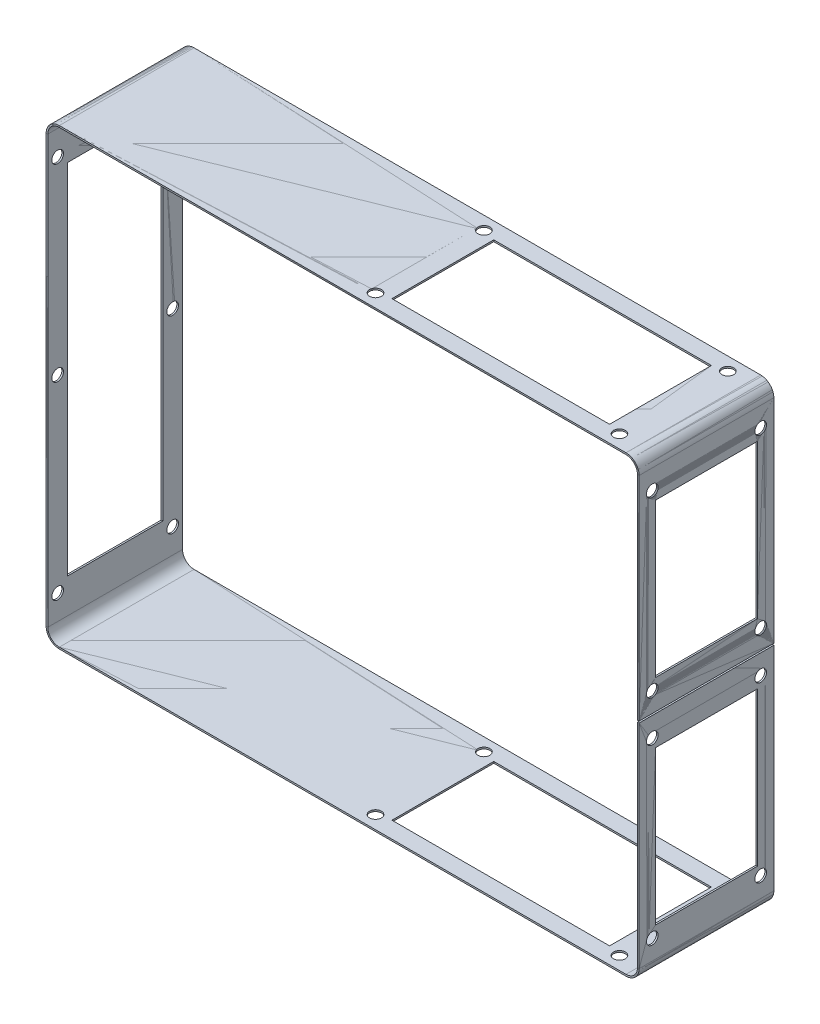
ISO-10303-21;
HEADER;
FILE_DESCRIPTION(('STEP AP214'),'2;1');
FILE_NAME('part.step','',(''),(''),'','','');
FILE_SCHEMA(('AUTOMOTIVE_DESIGN { 1 0 10303 214 1 1 1 1 }'));
ENDSEC;
DATA;
#1=APPLICATION_CONTEXT('core data for automotive mechanical design processes');
#2=APPLICATION_PROTOCOL_DEFINITION('international standard','automotive_design',2000,#1);
#3=PRODUCT_CONTEXT('',#1,'mechanical');
#4=PRODUCT('Part','Part','',(#3));
#5=PRODUCT_RELATED_PRODUCT_CATEGORY('part','',(#4));
#6=PRODUCT_DEFINITION_FORMATION('','',#4);
#7=PRODUCT_DEFINITION_CONTEXT('part definition',#1,'design');
#8=PRODUCT_DEFINITION('design','',#6,#7);
#9=PRODUCT_DEFINITION_SHAPE('','',#8);
#10=(LENGTH_UNIT() NAMED_UNIT(*) SI_UNIT(.MILLI.,.METRE.));
#11=(NAMED_UNIT(*) PLANE_ANGLE_UNIT() SI_UNIT($,.RADIAN.));
#12=(NAMED_UNIT(*) SI_UNIT($,.STERADIAN.) SOLID_ANGLE_UNIT());
#13=UNCERTAINTY_MEASURE_WITH_UNIT(LENGTH_MEASURE(1.E-05),#10,'distance_accuracy_value','');
#14=(GEOMETRIC_REPRESENTATION_CONTEXT(3) GLOBAL_UNCERTAINTY_ASSIGNED_CONTEXT((#13)) GLOBAL_UNIT_ASSIGNED_CONTEXT((#10,
#11,#12)) REPRESENTATION_CONTEXT('',''));
#15=CARTESIAN_POINT('',(0.,0.,0.));
#16=DIRECTION('',(0.,0.,1.));
#17=DIRECTION('',(1.,0.,0.));
#18=AXIS2_PLACEMENT_3D('',#15,#16,#17);
#19=CARTESIAN_POINT('',(179.5,-130.,0.));
#20=DIRECTION('',(1.,0.,0.));
#21=DIRECTION('',(0.,0.,-1.));
#22=AXIS2_PLACEMENT_3D('',#19,#20,#21);
#23=PLANE('',#22);
#24=CARTESIAN_POINT('',(179.5,-118.,74.));
#25=DIRECTION('',(-1.,0.,0.));
#26=DIRECTION('',(0.,0.,-1.));
#27=AXIS2_PLACEMENT_3D('',#24,#25,#26);
#28=CIRCLE('',#27,3.55);
#29=CARTESIAN_POINT('',(179.5,-118.,70.45));
#30=VERTEX_POINT('',#29);
#31=EDGE_CURVE('E389',#30,#30,#28,.F.);
#32=ORIENTED_EDGE('',*,*,#31,.T.);
#33=EDGE_LOOP('',(#32));
#34=FACE_BOUND('',#33,.T.);
#35=CARTESIAN_POINT('',(179.5,-118.,8.));
#36=DIRECTION('',(-1.,0.,0.));
#37=DIRECTION('',(0.,0.,-1.));
#38=AXIS2_PLACEMENT_3D('',#35,#36,#37);
#39=CIRCLE('',#38,3.54999999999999);
#40=CARTESIAN_POINT('',(179.5,-118.,4.45000000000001));
#41=VERTEX_POINT('',#40);
#42=EDGE_CURVE('E395',#41,#41,#39,.F.);
#43=ORIENTED_EDGE('',*,*,#42,.T.);
#44=EDGE_LOOP('',(#43));
#45=FACE_BOUND('',#44,.T.);
#46=CARTESIAN_POINT('',(179.5,-12.5,8.));
#47=DIRECTION('',(-1.,0.,0.));
#48=DIRECTION('',(0.,0.,-1.));
#49=AXIS2_PLACEMENT_3D('',#46,#47,#48);
#50=CIRCLE('',#49,3.55);
#51=CARTESIAN_POINT('',(179.5,-12.5,4.45));
#52=VERTEX_POINT('',#51);
#53=EDGE_CURVE('E401',#52,#52,#50,.F.);
#54=ORIENTED_EDGE('',*,*,#53,.T.);
#55=EDGE_LOOP('',(#54));
#56=FACE_BOUND('',#55,.T.);
#57=CARTESIAN_POINT('',(179.5,-12.5,74.));
#58=DIRECTION('',(-1.,0.,0.));
#59=DIRECTION('',(0.,0.,-1.));
#60=AXIS2_PLACEMENT_3D('',#57,#58,#59);
#61=CIRCLE('',#60,3.55);
#62=CARTESIAN_POINT('',(179.5,-12.5,70.45));
#63=VERTEX_POINT('',#62);
#64=EDGE_CURVE('E407',#63,#63,#61,.F.);
#65=ORIENTED_EDGE('',*,*,#64,.T.);
#66=EDGE_LOOP('',(#65));
#67=FACE_BOUND('',#66,.T.);
#68=DIRECTION('',(0.,1.,0.));
#69=VECTOR('',#68,1.);
#70=CARTESIAN_POINT('',(179.5,-130.,82.));
#71=LINE('',#70,#69);
#72=CARTESIAN_POINT('',(179.5,-130.,82.));
#73=VERTEX_POINT('',#72);
#74=CARTESIAN_POINT('',(179.5,-0.500000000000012,82.));
#75=VERTEX_POINT('',#74);
#76=EDGE_CURVE('E551',#73,#75,#71,.T.);
#77=ORIENTED_EDGE('',*,*,#76,.T.);
#78=DIRECTION('',(0.,0.,-1.));
#79=VECTOR('',#78,1.);
#80=CARTESIAN_POINT('',(179.5,-0.5,0.));
#81=LINE('',#80,#79);
#82=CARTESIAN_POINT('',(179.5,-0.5,0.));
#83=VERTEX_POINT('',#82);
#84=EDGE_CURVE('E554',#75,#83,#81,.T.);
#85=ORIENTED_EDGE('',*,*,#84,.T.);
#86=DIRECTION('',(0.,1.,0.));
#87=VECTOR('',#86,1.);
#88=CARTESIAN_POINT('',(179.5,-130.,0.));
#89=LINE('',#88,#87);
#90=CARTESIAN_POINT('',(179.5,-130.,0.));
#91=VERTEX_POINT('',#90);
#92=EDGE_CURVE('E559',#91,#83,#89,.T.);
#93=ORIENTED_EDGE('',*,*,#92,.F.);
#94=DIRECTION('',(0.,0.,1.));
#95=VECTOR('',#94,1.);
#96=CARTESIAN_POINT('',(179.5,-130.,0.));
#97=LINE('',#96,#95);
#98=EDGE_CURVE('E562',#91,#73,#97,.T.);
#99=ORIENTED_EDGE('',*,*,#98,.T.);
#100=EDGE_LOOP('',(#77,#85,#93,#99));
#101=FACE_BOUND('',#100,.T.);
#102=DIRECTION('',(0.,1.,0.));
#103=VECTOR('',#102,1.);
#104=CARTESIAN_POINT('',(179.5,130.,10.));
#105=LINE('',#104,#103);
#106=CARTESIAN_POINT('',(179.5,-112.,10.));
#107=VERTEX_POINT('',#106);
#108=CARTESIAN_POINT('',(179.5,-18.5,10.));
#109=VERTEX_POINT('',#108);
#110=EDGE_CURVE('E443',#107,#109,#105,.T.);
#111=ORIENTED_EDGE('',*,*,#110,.T.);
#112=DIRECTION('',(0.,0.,1.));
#113=VECTOR('',#112,1.);
#114=CARTESIAN_POINT('',(179.5,-18.5,0.));
#115=LINE('',#114,#113);
#116=CARTESIAN_POINT('',(179.5,-18.5,72.));
#117=VERTEX_POINT('',#116);
#118=EDGE_CURVE('E416',#109,#117,#115,.T.);
#119=ORIENTED_EDGE('',*,*,#118,.T.);
#120=DIRECTION('',(0.,-1.,0.));
#121=VECTOR('',#120,1.);
#122=CARTESIAN_POINT('',(179.5,130.,72.));
#123=LINE('',#122,#121);
#124=CARTESIAN_POINT('',(179.5,-112.,72.));
#125=VERTEX_POINT('',#124);
#126=EDGE_CURVE('E427',#117,#125,#123,.T.);
#127=ORIENTED_EDGE('',*,*,#126,.T.);
#128=DIRECTION('',(0.,0.,-1.));
#129=VECTOR('',#128,1.);
#130=CARTESIAN_POINT('',(179.5,-112.,0.));
#131=LINE('',#130,#129);
#132=EDGE_CURVE('E435',#125,#107,#131,.T.);
#133=ORIENTED_EDGE('',*,*,#132,.T.);
#134=EDGE_LOOP('',(#111,#119,#127,#133));
#135=FACE_BOUND('',#134,.T.);
#136=ADVANCED_FACE('F48',(#34,#45,#56,#67,#101,#135),#23,.F.);
#137=CARTESIAN_POINT('',(180.5,-130.,0.));
#138=DIRECTION('',(1.,0.,0.));
#139=DIRECTION('',(0.,0.,-1.));
#140=AXIS2_PLACEMENT_3D('',#137,#138,#139);
#141=PLANE('',#140);
#142=CARTESIAN_POINT('',(180.5,-118.,74.));
#143=DIRECTION('',(1.,0.,0.));
#144=DIRECTION('',(0.,0.,1.));
#145=AXIS2_PLACEMENT_3D('',#142,#143,#144);
#146=CIRCLE('',#145,3.55);
#147=CARTESIAN_POINT('',(180.5,-118.,77.55));
#148=VERTEX_POINT('',#147);
#149=EDGE_CURVE('E392',#148,#148,#146,.F.);
#150=ORIENTED_EDGE('',*,*,#149,.T.);
#151=EDGE_LOOP('',(#150));
#152=FACE_BOUND('',#151,.T.);
#153=CARTESIAN_POINT('',(180.5,-118.,8.));
#154=DIRECTION('',(1.,0.,0.));
#155=DIRECTION('',(0.,0.,1.));
#156=AXIS2_PLACEMENT_3D('',#153,#154,#155);
#157=CIRCLE('',#156,3.54999999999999);
#158=CARTESIAN_POINT('',(180.5,-118.,11.55));
#159=VERTEX_POINT('',#158);
#160=EDGE_CURVE('E398',#159,#159,#157,.F.);
#161=ORIENTED_EDGE('',*,*,#160,.T.);
#162=EDGE_LOOP('',(#161));
#163=FACE_BOUND('',#162,.T.);
#164=CARTESIAN_POINT('',(180.5,-12.5,8.));
#165=DIRECTION('',(1.,0.,0.));
#166=DIRECTION('',(0.,0.,1.));
#167=AXIS2_PLACEMENT_3D('',#164,#165,#166);
#168=CIRCLE('',#167,3.55);
#169=CARTESIAN_POINT('',(180.5,-12.5,11.55));
#170=VERTEX_POINT('',#169);
#171=EDGE_CURVE('E404',#170,#170,#168,.F.);
#172=ORIENTED_EDGE('',*,*,#171,.T.);
#173=EDGE_LOOP('',(#172));
#174=FACE_BOUND('',#173,.T.);
#175=CARTESIAN_POINT('',(180.5,-12.5,74.));
#176=DIRECTION('',(1.,0.,0.));
#177=DIRECTION('',(0.,0.,1.));
#178=AXIS2_PLACEMENT_3D('',#175,#176,#177);
#179=CIRCLE('',#178,3.55);
#180=CARTESIAN_POINT('',(180.5,-12.5,77.55));
#181=VERTEX_POINT('',#180);
#182=EDGE_CURVE('E410',#181,#181,#179,.F.);
#183=ORIENTED_EDGE('',*,*,#182,.T.);
#184=EDGE_LOOP('',(#183));
#185=FACE_BOUND('',#184,.T.);
#186=DIRECTION('',(0.,1.,0.));
#187=VECTOR('',#186,1.);
#188=CARTESIAN_POINT('',(180.5,-130.,82.));
#189=LINE('',#188,#187);
#190=CARTESIAN_POINT('',(180.5,-130.,82.));
#191=VERTEX_POINT('',#190);
#192=CARTESIAN_POINT('',(180.5,-0.5,82.));
#193=VERTEX_POINT('',#192);
#194=EDGE_CURVE('E510',#191,#193,#189,.T.);
#195=ORIENTED_EDGE('',*,*,#194,.F.);
#196=DIRECTION('',(0.,0.,-1.));
#197=VECTOR('',#196,1.);
#198=CARTESIAN_POINT('',(180.5,-130.,0.));
#199=LINE('',#198,#197);
#200=CARTESIAN_POINT('',(180.5,-130.,0.));
#201=VERTEX_POINT('',#200);
#202=EDGE_CURVE('E665',#201,#191,#199,.F.);
#203=ORIENTED_EDGE('',*,*,#202,.F.);
#204=DIRECTION('',(0.,1.,0.));
#205=VECTOR('',#204,1.);
#206=CARTESIAN_POINT('',(180.5,-130.,0.));
#207=LINE('',#206,#205);
#208=CARTESIAN_POINT('',(180.5,-0.5,0.));
#209=VERTEX_POINT('',#208);
#210=EDGE_CURVE('E668',#201,#209,#207,.T.);
#211=ORIENTED_EDGE('',*,*,#210,.T.);
#212=DIRECTION('',(0.,0.,-1.));
#213=VECTOR('',#212,1.);
#214=CARTESIAN_POINT('',(180.5,-0.5,0.));
#215=LINE('',#214,#213);
#216=EDGE_CURVE('E698',#193,#209,#215,.T.);
#217=ORIENTED_EDGE('',*,*,#216,.F.);
#218=EDGE_LOOP('',(#195,#203,#211,#217));
#219=FACE_BOUND('',#218,.T.);
#220=DIRECTION('',(0.,0.,-1.));
#221=VECTOR('',#220,1.);
#222=CARTESIAN_POINT('',(180.5,-18.5,82.));
#223=LINE('',#222,#221);
#224=CARTESIAN_POINT('',(180.5,-18.5,72.));
#225=VERTEX_POINT('',#224);
#226=CARTESIAN_POINT('',(180.5,-18.5,10.));
#227=VERTEX_POINT('',#226);
#228=EDGE_CURVE('E413',#225,#227,#223,.T.);
#229=ORIENTED_EDGE('',*,*,#228,.T.);
#230=DIRECTION('',(0.,-1.,0.));
#231=VECTOR('',#230,1.);
#232=CARTESIAN_POINT('',(180.5,138.,9.99999999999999));
#233=LINE('',#232,#231);
#234=CARTESIAN_POINT('',(180.5,-112.,10.));
#235=VERTEX_POINT('',#234);
#236=EDGE_CURVE('E440',#227,#235,#233,.T.);
#237=ORIENTED_EDGE('',*,*,#236,.T.);
#238=DIRECTION('',(0.,0.,1.));
#239=VECTOR('',#238,1.);
#240=CARTESIAN_POINT('',(180.5,-112.,82.));
#241=LINE('',#240,#239);
#242=CARTESIAN_POINT('',(180.5,-112.,72.));
#243=VERTEX_POINT('',#242);
#244=EDGE_CURVE('E432',#235,#243,#241,.T.);
#245=ORIENTED_EDGE('',*,*,#244,.T.);
#246=DIRECTION('',(0.,1.,0.));
#247=VECTOR('',#246,1.);
#248=CARTESIAN_POINT('',(180.5,138.,72.));
#249=LINE('',#248,#247);
#250=EDGE_CURVE('E424',#243,#225,#249,.T.);
#251=ORIENTED_EDGE('',*,*,#250,.T.);
#252=EDGE_LOOP('',(#229,#237,#245,#251));
#253=FACE_BOUND('',#252,.T.);
#254=ADVANCED_FACE('F802',(#152,#163,#174,#185,#219,#253),#141,.T.);
#255=CARTESIAN_POINT('',(-172.5,130.,82.));
#256=DIRECTION('',(0.,0.,-1.));
#257=DIRECTION('',(-1.,0.,0.));
#258=AXIS2_PLACEMENT_3D('',#255,#256,#257);
#259=PLANE('',#258);
#260=DIRECTION('',(0.,-1.,0.));
#261=VECTOR('',#260,1.);
#262=CARTESIAN_POINT('',(-172.5,137.,82.));
#263=LINE('',#262,#261);
#264=CARTESIAN_POINT('',(-172.5,138.,82.));
#265=VERTEX_POINT('',#264);
#266=CARTESIAN_POINT('',(-172.5,137.,82.));
#267=VERTEX_POINT('',#266);
#268=EDGE_CURVE('E751',#265,#267,#263,.T.);
#269=ORIENTED_EDGE('',*,*,#268,.F.);
#270=CARTESIAN_POINT('',(-172.5,130.,82.));
#271=DIRECTION('',(0.,0.,1.));
#272=DIRECTION('',(1.,0.,0.));
#273=AXIS2_PLACEMENT_3D('',#270,#271,#272);
#274=CIRCLE('',#273,8.00000000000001);
#275=CARTESIAN_POINT('',(-180.5,130.,82.));
#276=VERTEX_POINT('',#275);
#277=EDGE_CURVE('E636',#265,#276,#274,.T.);
#278=ORIENTED_EDGE('',*,*,#277,.T.);
#279=DIRECTION('',(1.,0.,0.));
#280=VECTOR('',#279,1.);
#281=CARTESIAN_POINT('',(-179.5,130.,82.));
#282=LINE('',#281,#280);
#283=CARTESIAN_POINT('',(-179.5,130.,82.));
#284=VERTEX_POINT('',#283);
#285=EDGE_CURVE('E749',#276,#284,#282,.T.);
#286=ORIENTED_EDGE('',*,*,#285,.T.);
#287=CARTESIAN_POINT('',(-172.5,130.,82.));
#288=DIRECTION('',(0.,0.,1.));
#289=DIRECTION('',(1.,0.,0.));
#290=AXIS2_PLACEMENT_3D('',#287,#288,#289);
#291=CIRCLE('',#290,7.00000000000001);
#292=EDGE_CURVE('E614',#267,#284,#291,.T.);
#293=ORIENTED_EDGE('',*,*,#292,.F.);
#294=EDGE_LOOP('',(#269,#278,#286,#293));
#295=FACE_BOUND('',#294,.T.);
#296=ADVANCED_FACE('F808',(#295),#259,.F.);
#297=CARTESIAN_POINT('',(-179.5,130.,82.));
#298=DIRECTION('',(0.,0.,-1.));
#299=DIRECTION('',(0.,-1.,0.));
#300=AXIS2_PLACEMENT_3D('',#297,#298,#299);
#301=PLANE('',#300);
#302=ORIENTED_EDGE('',*,*,#285,.F.);
#303=DIRECTION('',(0.,1.,0.));
#304=VECTOR('',#303,1.);
#305=CARTESIAN_POINT('',(-180.5,130.,82.));
#306=LINE('',#305,#304);
#307=CARTESIAN_POINT('',(-180.5,-130.,82.));
#308=VERTEX_POINT('',#307);
#309=EDGE_CURVE('E655',#276,#308,#306,.F.);
#310=ORIENTED_EDGE('',*,*,#309,.T.);
#311=DIRECTION('',(1.,0.,0.));
#312=VECTOR('',#311,1.);
#313=CARTESIAN_POINT('',(-179.5,-130.,82.));
#314=LINE('',#313,#312);
#315=CARTESIAN_POINT('',(-179.5,-130.,82.));
#316=VERTEX_POINT('',#315);
#317=EDGE_CURVE('E747',#308,#316,#314,.T.);
#318=ORIENTED_EDGE('',*,*,#317,.T.);
#319=DIRECTION('',(0.,-1.,0.));
#320=VECTOR('',#319,1.);
#321=CARTESIAN_POINT('',(-179.5,130.,82.));
#322=LINE('',#321,#320);
#323=EDGE_CURVE('E584',#284,#316,#322,.T.);
#324=ORIENTED_EDGE('',*,*,#323,.F.);
#325=EDGE_LOOP('',(#302,#310,#318,#324));
#326=FACE_BOUND('',#325,.T.);
#327=ADVANCED_FACE('F923',(#326),#301,.F.);
#328=CARTESIAN_POINT('',(-172.5,-130.,82.));
#329=DIRECTION('',(0.,0.,-1.));
#330=DIRECTION('',(-1.,0.,0.));
#331=AXIS2_PLACEMENT_3D('',#328,#329,#330);
#332=PLANE('',#331);
#333=ORIENTED_EDGE('',*,*,#317,.F.);
#334=CARTESIAN_POINT('',(-172.5,-130.,82.));
#335=DIRECTION('',(0.,0.,1.));
#336=DIRECTION('',(1.,0.,0.));
#337=AXIS2_PLACEMENT_3D('',#334,#335,#336);
#338=CIRCLE('',#337,8.00000000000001);
#339=CARTESIAN_POINT('',(-172.5,-138.,82.));
#340=VERTEX_POINT('',#339);
#341=EDGE_CURVE('E650',#308,#340,#338,.T.);
#342=ORIENTED_EDGE('',*,*,#341,.T.);
#343=DIRECTION('',(0.,1.,0.));
#344=VECTOR('',#343,1.);
#345=CARTESIAN_POINT('',(-172.5,-137.,82.));
#346=LINE('',#345,#344);
#347=CARTESIAN_POINT('',(-172.5,-137.,82.));
#348=VERTEX_POINT('',#347);
#349=EDGE_CURVE('E745',#340,#348,#346,.T.);
#350=ORIENTED_EDGE('',*,*,#349,.T.);
#351=CARTESIAN_POINT('',(-172.5,-130.,82.));
#352=DIRECTION('',(0.,0.,1.));
#353=DIRECTION('',(1.,0.,0.));
#354=AXIS2_PLACEMENT_3D('',#351,#352,#353);
#355=CIRCLE('',#354,7.00000000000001);
#356=EDGE_CURVE('E596',#316,#348,#355,.T.);
#357=ORIENTED_EDGE('',*,*,#356,.F.);
#358=EDGE_LOOP('',(#333,#342,#350,#357));
#359=FACE_BOUND('',#358,.T.);
#360=ADVANCED_FACE('F919',(#359),#332,.F.);
#361=CARTESIAN_POINT('',(-172.5,-137.,82.));
#362=DIRECTION('',(0.,0.,-1.));
#363=DIRECTION('',(1.,0.,0.));
#364=AXIS2_PLACEMENT_3D('',#361,#362,#363);
#365=PLANE('',#364);
#366=ORIENTED_EDGE('',*,*,#349,.F.);
#367=DIRECTION('',(1.,0.,0.));
#368=VECTOR('',#367,1.);
#369=CARTESIAN_POINT('',(-172.5,-138.,82.));
#370=LINE('',#369,#368);
#371=CARTESIAN_POINT('',(172.5,-138.,82.));
#372=VERTEX_POINT('',#371);
#373=EDGE_CURVE('E664',#340,#372,#370,.T.);
#374=ORIENTED_EDGE('',*,*,#373,.T.);
#375=DIRECTION('',(0.,1.,0.));
#376=VECTOR('',#375,1.);
#377=CARTESIAN_POINT('',(172.5,-137.,82.));
#378=LINE('',#377,#376);
#379=CARTESIAN_POINT('',(172.5,-137.,82.));
#380=VERTEX_POINT('',#379);
#381=EDGE_CURVE('E743',#372,#380,#378,.T.);
#382=ORIENTED_EDGE('',*,*,#381,.T.);
#383=DIRECTION('',(1.,0.,0.));
#384=VECTOR('',#383,1.);
#385=CARTESIAN_POINT('',(-172.5,-137.,82.));
#386=LINE('',#385,#384);
#387=EDGE_CURVE('E566',#348,#380,#386,.T.);
#388=ORIENTED_EDGE('',*,*,#387,.F.);
#389=EDGE_LOOP('',(#366,#374,#382,#388));
#390=FACE_BOUND('',#389,.T.);
#391=ADVANCED_FACE('F915',(#390),#365,.F.);
#392=CARTESIAN_POINT('',(172.5,-130.,82.));
#393=DIRECTION('',(0.,0.,-1.));
#394=DIRECTION('',(-1.,0.,0.));
#395=AXIS2_PLACEMENT_3D('',#392,#393,#394);
#396=PLANE('',#395);
#397=ORIENTED_EDGE('',*,*,#381,.F.);
#398=CARTESIAN_POINT('',(172.5,-130.,82.));
#399=DIRECTION('',(0.,0.,1.));
#400=DIRECTION('',(1.,0.,0.));
#401=AXIS2_PLACEMENT_3D('',#398,#399,#400);
#402=CIRCLE('',#401,8.00000000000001);
#403=EDGE_CURVE('E659',#372,#191,#402,.T.);
#404=ORIENTED_EDGE('',*,*,#403,.T.);
#405=DIRECTION('',(-1.,0.,0.));
#406=VECTOR('',#405,1.);
#407=CARTESIAN_POINT('',(179.5,-130.,82.));
#408=LINE('',#407,#406);
#409=EDGE_CURVE('E741',#191,#73,#408,.T.);
#410=ORIENTED_EDGE('',*,*,#409,.T.);
#411=CARTESIAN_POINT('',(172.5,-130.,82.));
#412=DIRECTION('',(0.,0.,1.));
#413=DIRECTION('',(1.,0.,0.));
#414=AXIS2_PLACEMENT_3D('',#411,#412,#413);
#415=CIRCLE('',#414,7.00000000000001);
#416=EDGE_CURVE('E578',#380,#73,#415,.T.);
#417=ORIENTED_EDGE('',*,*,#416,.F.);
#418=EDGE_LOOP('',(#397,#404,#410,#417));
#419=FACE_BOUND('',#418,.T.);
#420=ADVANCED_FACE('F912',(#419),#396,.F.);
#421=CARTESIAN_POINT('',(179.5,-130.,82.));
#422=DIRECTION('',(0.,0.,-1.));
#423=DIRECTION('',(0.,1.,0.));
#424=AXIS2_PLACEMENT_3D('',#421,#422,#423);
#425=PLANE('',#424);
#426=ORIENTED_EDGE('',*,*,#409,.F.);
#427=ORIENTED_EDGE('',*,*,#194,.T.);
#428=DIRECTION('',(-1.,0.,0.));
#429=VECTOR('',#428,1.);
#430=CARTESIAN_POINT('',(179.5,-0.500000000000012,82.));
#431=LINE('',#430,#429);
#432=EDGE_CURVE('E739',#193,#75,#431,.T.);
#433=ORIENTED_EDGE('',*,*,#432,.T.);
#434=ORIENTED_EDGE('',*,*,#76,.F.);
#435=EDGE_LOOP('',(#426,#427,#433,#434));
#436=FACE_BOUND('',#435,.T.);
#437=ADVANCED_FACE('F871',(#436),#425,.F.);
#438=CARTESIAN_POINT('',(179.5,-0.5,0.));
#439=DIRECTION('',(0.,-1.,0.));
#440=DIRECTION('',(0.,0.,-1.));
#441=AXIS2_PLACEMENT_3D('',#438,#439,#440);
#442=PLANE('',#441);
#443=ORIENTED_EDGE('',*,*,#432,.F.);
#444=ORIENTED_EDGE('',*,*,#216,.T.);
#445=DIRECTION('',(-1.,0.,0.));
#446=VECTOR('',#445,1.);
#447=CARTESIAN_POINT('',(179.5,-0.5,0.));
#448=LINE('',#447,#446);
#449=EDGE_CURVE('E737',#209,#83,#448,.T.);
#450=ORIENTED_EDGE('',*,*,#449,.T.);
#451=ORIENTED_EDGE('',*,*,#84,.F.);
#452=EDGE_LOOP('',(#443,#444,#450,#451));
#453=FACE_BOUND('',#452,.T.);
#454=ADVANCED_FACE('F908',(#453),#442,.F.);
#455=CARTESIAN_POINT('',(179.5,-130.,0.));
#456=DIRECTION('',(0.,0.,-1.));
#457=DIRECTION('',(0.,1.,0.));
#458=AXIS2_PLACEMENT_3D('',#455,#456,#457);
#459=PLANE('',#458);
#460=ORIENTED_EDGE('',*,*,#449,.F.);
#461=ORIENTED_EDGE('',*,*,#210,.F.);
#462=DIRECTION('',(-1.,0.,0.));
#463=VECTOR('',#462,1.);
#464=CARTESIAN_POINT('',(179.5,-130.,0.));
#465=LINE('',#464,#463);
#466=EDGE_CURVE('E735',#201,#91,#465,.T.);
#467=ORIENTED_EDGE('',*,*,#466,.T.);
#468=ORIENTED_EDGE('',*,*,#92,.T.);
#469=EDGE_LOOP('',(#460,#461,#467,#468));
#470=FACE_BOUND('',#469,.T.);
#471=ADVANCED_FACE('F880',(#470),#459,.T.);
#472=CARTESIAN_POINT('',(172.5,-130.,0.));
#473=DIRECTION('',(0.,0.,-1.));
#474=DIRECTION('',(-1.,0.,0.));
#475=AXIS2_PLACEMENT_3D('',#472,#473,#474);
#476=PLANE('',#475);
#477=ORIENTED_EDGE('',*,*,#466,.F.);
#478=CARTESIAN_POINT('',(172.5,-130.,0.));
#479=DIRECTION('',(0.,0.,1.));
#480=DIRECTION('',(1.,0.,0.));
#481=AXIS2_PLACEMENT_3D('',#478,#479,#480);
#482=CIRCLE('',#481,8.00000000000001);
#483=CARTESIAN_POINT('',(172.5,-138.,0.));
#484=VERTEX_POINT('',#483);
#485=EDGE_CURVE('E693',#484,#201,#482,.T.);
#486=ORIENTED_EDGE('',*,*,#485,.F.);
#487=DIRECTION('',(0.,1.,0.));
#488=VECTOR('',#487,1.);
#489=CARTESIAN_POINT('',(172.5,-137.,0.));
#490=LINE('',#489,#488);
#491=CARTESIAN_POINT('',(172.5,-137.,0.));
#492=VERTEX_POINT('',#491);
#493=EDGE_CURVE('E733',#484,#492,#490,.T.);
#494=ORIENTED_EDGE('',*,*,#493,.T.);
#495=CARTESIAN_POINT('',(172.5,-130.,0.));
#496=DIRECTION('',(0.,0.,1.));
#497=DIRECTION('',(1.,0.,0.));
#498=AXIS2_PLACEMENT_3D('',#495,#496,#497);
#499=CIRCLE('',#498,7.00000000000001);
#500=EDGE_CURVE('E581',#492,#91,#499,.T.);
#501=ORIENTED_EDGE('',*,*,#500,.T.);
#502=EDGE_LOOP('',(#477,#486,#494,#501));
#503=FACE_BOUND('',#502,.T.);
#504=ADVANCED_FACE('F903',(#503),#476,.T.);
#505=CARTESIAN_POINT('',(-172.5,-137.,0.));
#506=DIRECTION('',(0.,0.,-1.));
#507=DIRECTION('',(1.,0.,0.));
#508=AXIS2_PLACEMENT_3D('',#505,#506,#507);
#509=PLANE('',#508);
#510=ORIENTED_EDGE('',*,*,#493,.F.);
#511=DIRECTION('',(1.,0.,0.));
#512=VECTOR('',#511,1.);
#513=CARTESIAN_POINT('',(-172.5,-138.,0.));
#514=LINE('',#513,#512);
#515=CARTESIAN_POINT('',(-172.5,-138.,0.));
#516=VERTEX_POINT('',#515);
#517=EDGE_CURVE('E660',#516,#484,#514,.T.);
#518=ORIENTED_EDGE('',*,*,#517,.F.);
#519=DIRECTION('',(0.,1.,0.));
#520=VECTOR('',#519,1.);
#521=CARTESIAN_POINT('',(-172.5,-137.,0.));
#522=LINE('',#521,#520);
#523=CARTESIAN_POINT('',(-172.5,-137.,0.));
#524=VERTEX_POINT('',#523);
#525=EDGE_CURVE('E731',#516,#524,#522,.T.);
#526=ORIENTED_EDGE('',*,*,#525,.T.);
#527=DIRECTION('',(1.,0.,0.));
#528=VECTOR('',#527,1.);
#529=CARTESIAN_POINT('',(-172.5,-137.,0.));
#530=LINE('',#529,#528);
#531=EDGE_CURVE('E572',#524,#492,#530,.T.);
#532=ORIENTED_EDGE('',*,*,#531,.T.);
#533=EDGE_LOOP('',(#510,#518,#526,#532));
#534=FACE_BOUND('',#533,.T.);
#535=ADVANCED_FACE('F899',(#534),#509,.T.);
#536=CARTESIAN_POINT('',(-172.5,-130.,0.));
#537=DIRECTION('',(0.,0.,-1.));
#538=DIRECTION('',(-1.,0.,0.));
#539=AXIS2_PLACEMENT_3D('',#536,#537,#538);
#540=PLANE('',#539);
#541=ORIENTED_EDGE('',*,*,#525,.F.);
#542=CARTESIAN_POINT('',(-172.5,-130.,0.));
#543=DIRECTION('',(0.,0.,1.));
#544=DIRECTION('',(1.,0.,0.));
#545=AXIS2_PLACEMENT_3D('',#542,#543,#544);
#546=CIRCLE('',#545,8.00000000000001);
#547=CARTESIAN_POINT('',(-180.5,-130.,0.));
#548=VERTEX_POINT('',#547);
#549=EDGE_CURVE('E688',#548,#516,#546,.T.);
#550=ORIENTED_EDGE('',*,*,#549,.F.);
#551=DIRECTION('',(1.,0.,0.));
#552=VECTOR('',#551,1.);
#553=CARTESIAN_POINT('',(-179.5,-130.,0.));
#554=LINE('',#553,#552);
#555=CARTESIAN_POINT('',(-179.5,-130.,0.));
#556=VERTEX_POINT('',#555);
#557=EDGE_CURVE('E729',#548,#556,#554,.T.);
#558=ORIENTED_EDGE('',*,*,#557,.T.);
#559=CARTESIAN_POINT('',(-172.5,-130.,0.));
#560=DIRECTION('',(0.,0.,1.));
#561=DIRECTION('',(1.,0.,0.));
#562=AXIS2_PLACEMENT_3D('',#559,#560,#561);
#563=CIRCLE('',#562,7.00000000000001);
#564=EDGE_CURVE('E599',#556,#524,#563,.T.);
#565=ORIENTED_EDGE('',*,*,#564,.T.);
#566=EDGE_LOOP('',(#541,#550,#558,#565));
#567=FACE_BOUND('',#566,.T.);
#568=ADVANCED_FACE('F895',(#567),#540,.T.);
#569=CARTESIAN_POINT('',(-179.5,130.,0.));
#570=DIRECTION('',(0.,0.,-1.));
#571=DIRECTION('',(0.,-1.,0.));
#572=AXIS2_PLACEMENT_3D('',#569,#570,#571);
#573=PLANE('',#572);
#574=ORIENTED_EDGE('',*,*,#557,.F.);
#575=DIRECTION('',(0.,1.,0.));
#576=VECTOR('',#575,1.);
#577=CARTESIAN_POINT('',(-180.5,130.,0.));
#578=LINE('',#577,#576);
#579=CARTESIAN_POINT('',(-180.5,130.,0.));
#580=VERTEX_POINT('',#579);
#581=EDGE_CURVE('E651',#580,#548,#578,.F.);
#582=ORIENTED_EDGE('',*,*,#581,.F.);
#583=DIRECTION('',(1.,0.,0.));
#584=VECTOR('',#583,1.);
#585=CARTESIAN_POINT('',(-179.5,130.,0.));
#586=LINE('',#585,#584);
#587=CARTESIAN_POINT('',(-179.5,130.,0.));
#588=VERTEX_POINT('',#587);
#589=EDGE_CURVE('E727',#580,#588,#586,.T.);
#590=ORIENTED_EDGE('',*,*,#589,.T.);
#591=DIRECTION('',(0.,-1.,0.));
#592=VECTOR('',#591,1.);
#593=CARTESIAN_POINT('',(-179.5,130.,0.));
#594=LINE('',#593,#592);
#595=EDGE_CURVE('E590',#588,#556,#594,.T.);
#596=ORIENTED_EDGE('',*,*,#595,.T.);
#597=EDGE_LOOP('',(#574,#582,#590,#596));
#598=FACE_BOUND('',#597,.T.);
#599=ADVANCED_FACE('F891',(#598),#573,.T.);
#600=CARTESIAN_POINT('',(-172.5,130.,0.));
#601=DIRECTION('',(0.,0.,-1.));
#602=DIRECTION('',(-1.,0.,0.));
#603=AXIS2_PLACEMENT_3D('',#600,#601,#602);
#604=PLANE('',#603);
#605=ORIENTED_EDGE('',*,*,#589,.F.);
#606=CARTESIAN_POINT('',(-172.5,130.,0.));
#607=DIRECTION('',(0.,0.,1.));
#608=DIRECTION('',(1.,0.,0.));
#609=AXIS2_PLACEMENT_3D('',#606,#607,#608);
#610=CIRCLE('',#609,8.00000000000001);
#611=CARTESIAN_POINT('',(-172.5,138.,0.));
#612=VERTEX_POINT('',#611);
#613=EDGE_CURVE('E679',#612,#580,#610,.T.);
#614=ORIENTED_EDGE('',*,*,#613,.F.);
#615=DIRECTION('',(0.,-1.,0.));
#616=VECTOR('',#615,1.);
#617=CARTESIAN_POINT('',(-172.5,137.,0.));
#618=LINE('',#617,#616);
#619=CARTESIAN_POINT('',(-172.5,137.,0.));
#620=VERTEX_POINT('',#619);
#621=EDGE_CURVE('E725',#612,#620,#618,.T.);
#622=ORIENTED_EDGE('',*,*,#621,.T.);
#623=CARTESIAN_POINT('',(-172.5,130.,0.));
#624=DIRECTION('',(0.,0.,1.));
#625=DIRECTION('',(1.,0.,0.));
#626=AXIS2_PLACEMENT_3D('',#623,#624,#625);
#627=CIRCLE('',#626,7.00000000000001);
#628=EDGE_CURVE('E617',#620,#588,#627,.T.);
#629=ORIENTED_EDGE('',*,*,#628,.T.);
#630=EDGE_LOOP('',(#605,#614,#622,#629));
#631=FACE_BOUND('',#630,.T.);
#632=ADVANCED_FACE('F887',(#631),#604,.T.);
#633=CARTESIAN_POINT('',(172.5,137.,0.));
#634=DIRECTION('',(0.,0.,-1.));
#635=DIRECTION('',(-1.,0.,0.));
#636=AXIS2_PLACEMENT_3D('',#633,#634,#635);
#637=PLANE('',#636);
#638=ORIENTED_EDGE('',*,*,#621,.F.);
#639=DIRECTION('',(1.,0.,0.));
#640=VECTOR('',#639,1.);
#641=CARTESIAN_POINT('',(172.5,138.,0.));
#642=LINE('',#641,#640);
#643=CARTESIAN_POINT('',(172.5,138.,0.));
#644=VERTEX_POINT('',#643);
#645=EDGE_CURVE('E637',#644,#612,#642,.F.);
#646=ORIENTED_EDGE('',*,*,#645,.F.);
#647=DIRECTION('',(0.,-1.,0.));
#648=VECTOR('',#647,1.);
#649=CARTESIAN_POINT('',(172.5,137.,0.));
#650=LINE('',#649,#648);
#651=CARTESIAN_POINT('',(172.5,137.,0.));
#652=VERTEX_POINT('',#651);
#653=EDGE_CURVE('E723',#644,#652,#650,.T.);
#654=ORIENTED_EDGE('',*,*,#653,.T.);
#655=DIRECTION('',(-1.,0.,0.));
#656=VECTOR('',#655,1.);
#657=CARTESIAN_POINT('',(172.5,137.,0.));
#658=LINE('',#657,#656);
#659=EDGE_CURVE('E608',#652,#620,#658,.T.);
#660=ORIENTED_EDGE('',*,*,#659,.T.);
#661=EDGE_LOOP('',(#638,#646,#654,#660));
#662=FACE_BOUND('',#661,.T.);
#663=ADVANCED_FACE('F883',(#662),#637,.T.);
#664=CARTESIAN_POINT('',(172.5,130.,0.));
#665=DIRECTION('',(0.,0.,-1.));
#666=DIRECTION('',(-1.,0.,0.));
#667=AXIS2_PLACEMENT_3D('',#664,#665,#666);
#668=PLANE('',#667);
#669=ORIENTED_EDGE('',*,*,#653,.F.);
#670=CARTESIAN_POINT('',(172.5,130.,0.));
#671=DIRECTION('',(0.,0.,1.));
#672=DIRECTION('',(1.,0.,0.));
#673=AXIS2_PLACEMENT_3D('',#670,#671,#672);
#674=CIRCLE('',#673,8.00000000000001);
#675=CARTESIAN_POINT('',(180.5,130.,0.));
#676=VERTEX_POINT('',#675);
#677=EDGE_CURVE('E555',#676,#644,#674,.T.);
#678=ORIENTED_EDGE('',*,*,#677,.F.);
#679=DIRECTION('',(-1.,0.,0.));
#680=VECTOR('',#679,1.);
#681=CARTESIAN_POINT('',(179.5,130.,0.));
#682=LINE('',#681,#680);
#683=CARTESIAN_POINT('',(179.5,130.,0.));
#684=VERTEX_POINT('',#683);
#685=EDGE_CURVE('E721',#676,#684,#682,.T.);
#686=ORIENTED_EDGE('',*,*,#685,.T.);
#687=CARTESIAN_POINT('',(172.5,130.,0.));
#688=DIRECTION('',(0.,0.,1.));
#689=DIRECTION('',(1.,0.,0.));
#690=AXIS2_PLACEMENT_3D('',#687,#688,#689);
#691=CIRCLE('',#690,7.00000000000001);
#692=EDGE_CURVE('E629',#684,#652,#691,.T.);
#693=ORIENTED_EDGE('',*,*,#692,.T.);
#694=EDGE_LOOP('',(#669,#678,#686,#693));
#695=FACE_BOUND('',#694,.T.);
#696=ADVANCED_FACE('F878',(#695),#668,.T.);
#697=ORIENTED_EDGE('',*,*,#685,.F.);
#698=DIRECTION('',(0.,1.,0.));
#699=VECTOR('',#698,1.);
#700=CARTESIAN_POINT('',(180.5,-130.,0.));
#701=LINE('',#700,#699);
#702=CARTESIAN_POINT('',(180.5,0.5,0.));
#703=VERTEX_POINT('',#702);
#704=EDGE_CURVE('E676',#703,#676,#701,.T.);
#705=ORIENTED_EDGE('',*,*,#704,.F.);
#706=DIRECTION('',(-1.,0.,0.));
#707=VECTOR('',#706,1.);
#708=CARTESIAN_POINT('',(179.5,0.49999999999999,0.));
#709=LINE('',#708,#707);
#710=CARTESIAN_POINT('',(179.5,0.49999999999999,0.));
#711=VERTEX_POINT('',#710);
#712=EDGE_CURVE('E719',#703,#711,#709,.T.);
#713=ORIENTED_EDGE('',*,*,#712,.T.);
#714=EDGE_CURVE('E563',#711,#684,#89,.T.);
#715=ORIENTED_EDGE('',*,*,#714,.T.);
#716=EDGE_LOOP('',(#697,#705,#713,#715));
#717=FACE_BOUND('',#716,.T.);
#718=ADVANCED_FACE('F874',(#717),#459,.T.);
#719=CARTESIAN_POINT('',(179.5,0.5,0.));
#720=DIRECTION('',(0.,1.,0.));
#721=DIRECTION('',(0.,0.,1.));
#722=AXIS2_PLACEMENT_3D('',#719,#720,#721);
#723=PLANE('',#722);
#724=ORIENTED_EDGE('',*,*,#712,.F.);
#725=DIRECTION('',(0.,0.,-1.));
#726=VECTOR('',#725,1.);
#727=CARTESIAN_POINT('',(180.5,0.5,0.));
#728=LINE('',#727,#726);
#729=CARTESIAN_POINT('',(180.5,0.5,82.));
#730=VERTEX_POINT('',#729);
#731=EDGE_CURVE('E673',#703,#730,#728,.F.);
#732=ORIENTED_EDGE('',*,*,#731,.T.);
#733=DIRECTION('',(-1.,0.,0.));
#734=VECTOR('',#733,1.);
#735=CARTESIAN_POINT('',(179.5,0.5,82.));
#736=LINE('',#735,#734);
#737=CARTESIAN_POINT('',(179.5,0.5,82.));
#738=VERTEX_POINT('',#737);
#739=EDGE_CURVE('E717',#730,#738,#736,.T.);
#740=ORIENTED_EDGE('',*,*,#739,.T.);
#741=DIRECTION('',(0.,0.,1.));
#742=VECTOR('',#741,1.);
#743=CARTESIAN_POINT('',(179.5,0.5,0.));
#744=LINE('',#743,#742);
#745=EDGE_CURVE('E620',#711,#738,#744,.T.);
#746=ORIENTED_EDGE('',*,*,#745,.F.);
#747=EDGE_LOOP('',(#724,#732,#740,#746));
#748=FACE_BOUND('',#747,.T.);
#749=ADVANCED_FACE('F869',(#748),#723,.F.);
#750=ORIENTED_EDGE('',*,*,#739,.F.);
#751=DIRECTION('',(0.,1.,0.));
#752=VECTOR('',#751,1.);
#753=CARTESIAN_POINT('',(180.5,-130.,82.));
#754=LINE('',#753,#752);
#755=CARTESIAN_POINT('',(180.5,130.,82.));
#756=VERTEX_POINT('',#755);
#757=EDGE_CURVE('E642',#730,#756,#754,.T.);
#758=ORIENTED_EDGE('',*,*,#757,.T.);
#759=DIRECTION('',(-1.,0.,0.));
#760=VECTOR('',#759,1.);
#761=CARTESIAN_POINT('',(179.5,130.,82.));
#762=LINE('',#761,#760);
#763=CARTESIAN_POINT('',(179.5,130.,82.));
#764=VERTEX_POINT('',#763);
#765=EDGE_CURVE('E715',#756,#764,#762,.T.);
#766=ORIENTED_EDGE('',*,*,#765,.T.);
#767=EDGE_CURVE('E556',#738,#764,#71,.T.);
#768=ORIENTED_EDGE('',*,*,#767,.F.);
#769=EDGE_LOOP('',(#750,#758,#766,#768));
#770=FACE_BOUND('',#769,.T.);
#771=ADVANCED_FACE('F865',(#770),#425,.F.);
#772=CARTESIAN_POINT('',(172.5,130.,82.));
#773=DIRECTION('',(0.,0.,-1.));
#774=DIRECTION('',(-1.,0.,0.));
#775=AXIS2_PLACEMENT_3D('',#772,#773,#774);
#776=PLANE('',#775);
#777=ORIENTED_EDGE('',*,*,#765,.F.);
#778=CARTESIAN_POINT('',(172.5,130.,82.));
#779=DIRECTION('',(0.,0.,1.));
#780=DIRECTION('',(1.,0.,0.));
#781=AXIS2_PLACEMENT_3D('',#778,#779,#780);
#782=CIRCLE('',#781,8.00000000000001);
#783=CARTESIAN_POINT('',(172.5,138.,82.));
#784=VERTEX_POINT('',#783);
#785=EDGE_CURVE('E641',#756,#784,#782,.T.);
#786=ORIENTED_EDGE('',*,*,#785,.T.);
#787=DIRECTION('',(0.,-1.,0.));
#788=VECTOR('',#787,1.);
#789=CARTESIAN_POINT('',(172.5,137.,82.));
#790=LINE('',#789,#788);
#791=CARTESIAN_POINT('',(172.5,137.,82.));
#792=VERTEX_POINT('',#791);
#793=EDGE_CURVE('E632',#784,#792,#790,.T.);
#794=ORIENTED_EDGE('',*,*,#793,.T.);
#795=CARTESIAN_POINT('',(172.5,130.,82.));
#796=DIRECTION('',(0.,0.,1.));
#797=DIRECTION('',(1.,0.,0.));
#798=AXIS2_PLACEMENT_3D('',#795,#796,#797);
#799=CIRCLE('',#798,7.00000000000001);
#800=EDGE_CURVE('E626',#764,#792,#799,.T.);
#801=ORIENTED_EDGE('',*,*,#800,.F.);
#802=EDGE_LOOP('',(#777,#786,#794,#801));
#803=FACE_BOUND('',#802,.T.);
#804=ADVANCED_FACE('F829',(#803),#776,.F.);
#805=CARTESIAN_POINT('',(172.5,137.,82.));
#806=DIRECTION('',(0.,0.,-1.));
#807=DIRECTION('',(-1.,0.,0.));
#808=AXIS2_PLACEMENT_3D('',#805,#806,#807);
#809=PLANE('',#808);
#810=DIRECTION('',(1.,0.,0.));
#811=VECTOR('',#810,1.);
#812=CARTESIAN_POINT('',(172.5,138.,82.));
#813=LINE('',#812,#811);
#814=EDGE_CURVE('E646',#784,#265,#813,.F.);
#815=ORIENTED_EDGE('',*,*,#814,.T.);
#816=ORIENTED_EDGE('',*,*,#268,.T.);
#817=DIRECTION('',(-1.,0.,0.));
#818=VECTOR('',#817,1.);
#819=CARTESIAN_POINT('',(172.5,137.,82.));
#820=LINE('',#819,#818);
#821=EDGE_CURVE('E602',#792,#267,#820,.T.);
#822=ORIENTED_EDGE('',*,*,#821,.F.);
#823=ORIENTED_EDGE('',*,*,#793,.F.);
#824=EDGE_LOOP('',(#815,#816,#822,#823));
#825=FACE_BOUND('',#824,.T.);
#826=ADVANCED_FACE('F50',(#825),#809,.F.);
#827=CARTESIAN_POINT('',(172.5,130.,0.));
#828=DIRECTION('',(0.,0.,1.));
#829=DIRECTION('',(1.,0.,0.));
#830=AXIS2_PLACEMENT_3D('',#827,#828,#829);
#831=CYLINDRICAL_SURFACE('',#830,7.00000000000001);
#832=ORIENTED_EDGE('',*,*,#800,.T.);
#833=DIRECTION('',(0.,0.,1.));
#834=VECTOR('',#833,1.);
#835=CARTESIAN_POINT('',(172.5,137.,0.));
#836=LINE('',#835,#834);
#837=EDGE_CURVE('E611',#652,#792,#836,.T.);
#838=ORIENTED_EDGE('',*,*,#837,.F.);
#839=ORIENTED_EDGE('',*,*,#692,.F.);
#840=DIRECTION('',(0.,0.,1.));
#841=VECTOR('',#840,1.);
#842=CARTESIAN_POINT('',(179.5,130.,0.));
#843=LINE('',#842,#841);
#844=EDGE_CURVE('E623',#684,#764,#843,.T.);
#845=ORIENTED_EDGE('',*,*,#844,.T.);
#846=EDGE_LOOP('',(#832,#838,#839,#845));
#847=FACE_BOUND('',#846,.T.);
#848=ADVANCED_FACE('F816',(#847),#831,.F.);
#849=DIRECTION('',(0.,-1.,0.));
#850=VECTOR('',#849,1.);
#851=CARTESIAN_POINT('',(179.5,-130.,10.));
#852=LINE('',#851,#850);
#853=CARTESIAN_POINT('',(179.5,112.,10.));
#854=VERTEX_POINT('',#853);
#855=CARTESIAN_POINT('',(179.5,18.5,10.));
#856=VERTEX_POINT('',#855);
#857=EDGE_CURVE('E479',#854,#856,#852,.T.);
#858=ORIENTED_EDGE('',*,*,#857,.F.);
#859=DIRECTION('',(0.,0.,-1.));
#860=VECTOR('',#859,1.);
#861=CARTESIAN_POINT('',(179.5,112.,0.));
#862=LINE('',#861,#860);
#863=CARTESIAN_POINT('',(179.5,112.,72.));
#864=VERTEX_POINT('',#863);
#865=EDGE_CURVE('E477',#864,#854,#862,.T.);
#866=ORIENTED_EDGE('',*,*,#865,.F.);
#867=DIRECTION('',(0.,1.,0.));
#868=VECTOR('',#867,1.);
#869=CARTESIAN_POINT('',(179.5,-130.,72.));
#870=LINE('',#869,#868);
#871=CARTESIAN_POINT('',(179.5,18.5,72.));
#872=VERTEX_POINT('',#871);
#873=EDGE_CURVE('E475',#872,#864,#870,.T.);
#874=ORIENTED_EDGE('',*,*,#873,.F.);
#875=DIRECTION('',(0.,0.,1.));
#876=VECTOR('',#875,1.);
#877=CARTESIAN_POINT('',(179.5,18.5,0.));
#878=LINE('',#877,#876);
#879=EDGE_CURVE('E473',#856,#872,#878,.T.);
#880=ORIENTED_EDGE('',*,*,#879,.F.);
#881=EDGE_LOOP('',(#858,#866,#874,#880));
#882=FACE_BOUND('',#881,.T.);
#883=CARTESIAN_POINT('',(179.5,118.,74.));
#884=DIRECTION('',(1.,0.,0.));
#885=DIRECTION('',(0.,0.,-1.));
#886=AXIS2_PLACEMENT_3D('',#883,#884,#885);
#887=CIRCLE('',#886,3.55);
#888=CARTESIAN_POINT('',(179.5,118.,70.45));
#889=VERTEX_POINT('',#888);
#890=EDGE_CURVE('E470',#889,#889,#887,.F.);
#891=ORIENTED_EDGE('',*,*,#890,.F.);
#892=EDGE_LOOP('',(#891));
#893=FACE_BOUND('',#892,.T.);
#894=CARTESIAN_POINT('',(179.5,118.,8.));
#895=DIRECTION('',(1.,0.,0.));
#896=DIRECTION('',(0.,0.,-1.));
#897=AXIS2_PLACEMENT_3D('',#894,#895,#896);
#898=CIRCLE('',#897,3.54999999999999);
#899=CARTESIAN_POINT('',(179.5,118.,4.45000000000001));
#900=VERTEX_POINT('',#899);
#901=EDGE_CURVE('E466',#900,#900,#898,.F.);
#902=ORIENTED_EDGE('',*,*,#901,.F.);
#903=EDGE_LOOP('',(#902));
#904=FACE_BOUND('',#903,.T.);
#905=CARTESIAN_POINT('',(179.5,12.5,8.));
#906=DIRECTION('',(1.,0.,0.));
#907=DIRECTION('',(0.,0.,-1.));
#908=AXIS2_PLACEMENT_3D('',#905,#906,#907);
#909=CIRCLE('',#908,3.55);
#910=CARTESIAN_POINT('',(179.5,12.5,4.45));
#911=VERTEX_POINT('',#910);
#912=EDGE_CURVE('E462',#911,#911,#909,.F.);
#913=ORIENTED_EDGE('',*,*,#912,.F.);
#914=EDGE_LOOP('',(#913));
#915=FACE_BOUND('',#914,.T.);
#916=CARTESIAN_POINT('',(179.5,12.5,74.));
#917=DIRECTION('',(1.,0.,0.));
#918=DIRECTION('',(0.,0.,-1.));
#919=AXIS2_PLACEMENT_3D('',#916,#917,#918);
#920=CIRCLE('',#919,3.55);
#921=CARTESIAN_POINT('',(179.5,12.5,70.45));
#922=VERTEX_POINT('',#921);
#923=EDGE_CURVE('E458',#922,#922,#920,.F.);
#924=ORIENTED_EDGE('',*,*,#923,.F.);
#925=EDGE_LOOP('',(#924));
#926=FACE_BOUND('',#925,.T.);
#927=ORIENTED_EDGE('',*,*,#714,.F.);
#928=ORIENTED_EDGE('',*,*,#745,.T.);
#929=ORIENTED_EDGE('',*,*,#767,.T.);
#930=ORIENTED_EDGE('',*,*,#844,.F.);
#931=EDGE_LOOP('',(#927,#928,#929,#930));
#932=FACE_BOUND('',#931,.T.);
#933=ADVANCED_FACE('F783',(#882,#893,#904,#915,#926,#932),#23,.F.);
#934=CARTESIAN_POINT('',(-172.5,130.,0.));
#935=DIRECTION('',(0.,0.,1.));
#936=DIRECTION('',(1.,0.,0.));
#937=AXIS2_PLACEMENT_3D('',#934,#935,#936);
#938=CYLINDRICAL_SURFACE('',#937,7.00000000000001);
#939=ORIENTED_EDGE('',*,*,#292,.T.);
#940=DIRECTION('',(0.,0.,1.));
#941=VECTOR('',#940,1.);
#942=CARTESIAN_POINT('',(-179.5,130.,0.));
#943=LINE('',#942,#941);
#944=EDGE_CURVE('E593',#588,#284,#943,.T.);
#945=ORIENTED_EDGE('',*,*,#944,.F.);
#946=ORIENTED_EDGE('',*,*,#628,.F.);
#947=DIRECTION('',(0.,0.,1.));
#948=VECTOR('',#947,1.);
#949=CARTESIAN_POINT('',(-172.5,137.,0.));
#950=LINE('',#949,#948);
#951=EDGE_CURVE('E605',#620,#267,#950,.T.);
#952=ORIENTED_EDGE('',*,*,#951,.T.);
#953=EDGE_LOOP('',(#939,#945,#946,#952));
#954=FACE_BOUND('',#953,.T.);
#955=ADVANCED_FACE('F815',(#954),#938,.F.);
#956=CARTESIAN_POINT('',(172.5,137.,0.));
#957=DIRECTION('',(0.,1.,0.));
#958=DIRECTION('',(0.,0.,1.));
#959=AXIS2_PLACEMENT_3D('',#956,#957,#958);
#960=PLANE('',#959);
#961=DIRECTION('',(1.,0.,0.));
#962=VECTOR('',#961,1.);
#963=CARTESIAN_POINT('',(172.5,137.,72.));
#964=LINE('',#963,#962);
#965=CARTESIAN_POINT('',(20.,137.,72.));
#966=VERTEX_POINT('',#965);
#967=CARTESIAN_POINT('',(152.5,137.,72.));
#968=VERTEX_POINT('',#967);
#969=EDGE_CURVE('E383',#966,#968,#964,.T.);
#970=ORIENTED_EDGE('',*,*,#969,.T.);
#971=DIRECTION('',(0.,0.,-1.));
#972=VECTOR('',#971,1.);
#973=CARTESIAN_POINT('',(152.5,137.,0.));
#974=LINE('',#973,#972);
#975=CARTESIAN_POINT('',(152.5,137.,10.));
#976=VERTEX_POINT('',#975);
#977=EDGE_CURVE('E386',#968,#976,#974,.T.);
#978=ORIENTED_EDGE('',*,*,#977,.T.);
#979=DIRECTION('',(-1.,0.,0.));
#980=VECTOR('',#979,1.);
#981=CARTESIAN_POINT('',(172.5,137.,10.));
#982=LINE('',#981,#980);
#983=CARTESIAN_POINT('',(20.,137.,10.));
#984=VERTEX_POINT('',#983);
#985=EDGE_CURVE('E377',#976,#984,#982,.T.);
#986=ORIENTED_EDGE('',*,*,#985,.T.);
#987=DIRECTION('',(0.,0.,1.));
#988=VECTOR('',#987,1.);
#989=CARTESIAN_POINT('',(20.,137.,0.));
#990=LINE('',#989,#988);
#991=EDGE_CURVE('E380',#984,#966,#990,.T.);
#992=ORIENTED_EDGE('',*,*,#991,.T.);
#993=EDGE_LOOP('',(#970,#978,#986,#992));
#994=FACE_BOUND('',#993,.T.);
#995=CARTESIAN_POINT('',(160.5,137.,8.00000000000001));
#996=DIRECTION('',(0.,1.,0.));
#997=DIRECTION('',(0.,0.,1.));
#998=AXIS2_PLACEMENT_3D('',#995,#996,#997);
#999=CIRCLE('',#998,3.59999999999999);
#1000=CARTESIAN_POINT('',(160.5,137.,11.6));
#1001=VERTEX_POINT('',#1000);
#1002=EDGE_CURVE('E374',#1001,#1001,#999,.T.);
#1003=ORIENTED_EDGE('',*,*,#1002,.T.);
#1004=EDGE_LOOP('',(#1003));
#1005=FACE_BOUND('',#1004,.T.);
#1006=CARTESIAN_POINT('',(12.,137.,8.));
#1007=DIRECTION('',(0.,1.,0.));
#1008=DIRECTION('',(0.,0.,1.));
#1009=AXIS2_PLACEMENT_3D('',#1006,#1007,#1008);
#1010=CIRCLE('',#1009,3.60000000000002);
#1011=CARTESIAN_POINT('',(12.,137.,11.6));
#1012=VERTEX_POINT('',#1011);
#1013=EDGE_CURVE('E371',#1012,#1012,#1010,.T.);
#1014=ORIENTED_EDGE('',*,*,#1013,.T.);
#1015=EDGE_LOOP('',(#1014));
#1016=FACE_BOUND('',#1015,.T.);
#1017=CARTESIAN_POINT('',(160.5,137.,74.));
#1018=DIRECTION('',(0.,1.,0.));
#1019=DIRECTION('',(0.,0.,1.));
#1020=AXIS2_PLACEMENT_3D('',#1017,#1018,#1019);
#1021=CIRCLE('',#1020,3.59999999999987);
#1022=CARTESIAN_POINT('',(160.5,137.,77.5999999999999));
#1023=VERTEX_POINT('',#1022);
#1024=EDGE_CURVE('E368',#1023,#1023,#1021,.T.);
#1025=ORIENTED_EDGE('',*,*,#1024,.T.);
#1026=EDGE_LOOP('',(#1025));
#1027=FACE_BOUND('',#1026,.T.);
#1028=CARTESIAN_POINT('',(12.,137.,74.));
#1029=DIRECTION('',(0.,1.,0.));
#1030=DIRECTION('',(0.,0.,1.));
#1031=AXIS2_PLACEMENT_3D('',#1028,#1029,#1030);
#1032=CIRCLE('',#1031,3.60000000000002);
#1033=CARTESIAN_POINT('',(12.,137.,77.6));
#1034=VERTEX_POINT('',#1033);
#1035=EDGE_CURVE('E349',#1034,#1034,#1032,.T.);
#1036=ORIENTED_EDGE('',*,*,#1035,.T.);
#1037=EDGE_LOOP('',(#1036));
#1038=FACE_BOUND('',#1037,.T.);
#1039=ORIENTED_EDGE('',*,*,#821,.T.);
#1040=ORIENTED_EDGE('',*,*,#951,.F.);
#1041=ORIENTED_EDGE('',*,*,#659,.F.);
#1042=ORIENTED_EDGE('',*,*,#837,.T.);
#1043=EDGE_LOOP('',(#1039,#1040,#1041,#1042));
#1044=FACE_BOUND('',#1043,.T.);
#1045=ADVANCED_FACE('F821',(#994,#1005,#1016,#1027,#1038,#1044),#960,.F.);
#1046=CARTESIAN_POINT('',(-172.5,-130.,0.));
#1047=DIRECTION('',(0.,0.,1.));
#1048=DIRECTION('',(1.,0.,0.));
#1049=AXIS2_PLACEMENT_3D('',#1046,#1047,#1048);
#1050=CYLINDRICAL_SURFACE('',#1049,7.00000000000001);
#1051=ORIENTED_EDGE('',*,*,#356,.T.);
#1052=DIRECTION('',(0.,0.,1.));
#1053=VECTOR('',#1052,1.);
#1054=CARTESIAN_POINT('',(-172.5,-137.,0.));
#1055=LINE('',#1054,#1053);
#1056=EDGE_CURVE('E575',#524,#348,#1055,.T.);
#1057=ORIENTED_EDGE('',*,*,#1056,.F.);
#1058=ORIENTED_EDGE('',*,*,#564,.F.);
#1059=DIRECTION('',(0.,0.,1.));
#1060=VECTOR('',#1059,1.);
#1061=CARTESIAN_POINT('',(-179.5,-130.,0.));
#1062=LINE('',#1061,#1060);
#1063=EDGE_CURVE('E587',#556,#316,#1062,.T.);
#1064=ORIENTED_EDGE('',*,*,#1063,.T.);
#1065=EDGE_LOOP('',(#1051,#1057,#1058,#1064));
#1066=FACE_BOUND('',#1065,.T.);
#1067=ADVANCED_FACE('F965',(#1066),#1050,.F.);
#1068=CARTESIAN_POINT('',(-179.5,130.,0.));
#1069=DIRECTION('',(-1.,0.,0.));
#1070=DIRECTION('',(0.,0.,1.));
#1071=AXIS2_PLACEMENT_3D('',#1068,#1069,#1070);
#1072=PLANE('',#1071);
#1073=DIRECTION('',(0.,0.,1.));
#1074=VECTOR('',#1073,1.);
#1075=CARTESIAN_POINT('',(-179.5,-109.,12.));
#1076=LINE('',#1075,#1074);
#1077=CARTESIAN_POINT('',(-179.5,-109.,12.));
#1078=VERTEX_POINT('',#1077);
#1079=CARTESIAN_POINT('',(-179.5,-109.,70.0000000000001));
#1080=VERTEX_POINT('',#1079);
#1081=EDGE_CURVE('E493',#1078,#1080,#1076,.T.);
#1082=ORIENTED_EDGE('',*,*,#1081,.T.);
#1083=DIRECTION('',(0.,1.,0.));
#1084=VECTOR('',#1083,1.);
#1085=CARTESIAN_POINT('',(-179.5,-109.,70.0000000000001));
#1086=LINE('',#1085,#1084);
#1087=CARTESIAN_POINT('',(-179.5,109.,70.));
#1088=VERTEX_POINT('',#1087);
#1089=EDGE_CURVE('E483',#1080,#1088,#1086,.T.);
#1090=ORIENTED_EDGE('',*,*,#1089,.T.);
#1091=DIRECTION('',(0.,0.,-1.));
#1092=VECTOR('',#1091,1.);
#1093=CARTESIAN_POINT('',(-179.5,109.,12.));
#1094=LINE('',#1093,#1092);
#1095=CARTESIAN_POINT('',(-179.5,109.,12.));
#1096=VERTEX_POINT('',#1095);
#1097=EDGE_CURVE('E486',#1088,#1096,#1094,.T.);
#1098=ORIENTED_EDGE('',*,*,#1097,.T.);
#1099=DIRECTION('',(0.,-1.,0.));
#1100=VECTOR('',#1099,1.);
#1101=CARTESIAN_POINT('',(-179.5,-109.,12.));
#1102=LINE('',#1101,#1100);
#1103=EDGE_CURVE('E490',#1096,#1078,#1102,.T.);
#1104=ORIENTED_EDGE('',*,*,#1103,.T.);
#1105=EDGE_LOOP('',(#1082,#1090,#1098,#1104));
#1106=FACE_BOUND('',#1105,.T.);
#1107=CARTESIAN_POINT('',(-179.5,115.,76.));
#1108=DIRECTION('',(-1.,0.,0.));
#1109=DIRECTION('',(0.,0.,1.));
#1110=AXIS2_PLACEMENT_3D('',#1107,#1108,#1109);
#1111=CIRCLE('',#1110,3.55);
#1112=CARTESIAN_POINT('',(-179.5,115.,79.55));
#1113=VERTEX_POINT('',#1112);
#1114=EDGE_CURVE('E500',#1113,#1113,#1111,.T.);
#1115=ORIENTED_EDGE('',*,*,#1114,.T.);
#1116=EDGE_LOOP('',(#1115));
#1117=FACE_BOUND('',#1116,.T.);
#1118=CARTESIAN_POINT('',(-179.5,115.,6.00000000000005));
#1119=DIRECTION('',(-1.,0.,0.));
#1120=DIRECTION('',(0.,0.,-1.));
#1121=AXIS2_PLACEMENT_3D('',#1118,#1119,#1120);
#1122=CIRCLE('',#1121,3.55000000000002);
#1123=CARTESIAN_POINT('',(-179.5,115.,2.45000000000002));
#1124=VERTEX_POINT('',#1123);
#1125=EDGE_CURVE('E522',#1124,#1124,#1122,.T.);
#1126=ORIENTED_EDGE('',*,*,#1125,.T.);
#1127=EDGE_LOOP('',(#1126));
#1128=FACE_BOUND('',#1127,.T.);
#1129=CARTESIAN_POINT('',(-179.5,-115.,76.));
#1130=DIRECTION('',(-1.,0.,0.));
#1131=DIRECTION('',(0.,0.,-1.));
#1132=AXIS2_PLACEMENT_3D('',#1129,#1130,#1131);
#1133=CIRCLE('',#1132,3.54999999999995);
#1134=CARTESIAN_POINT('',(-179.5,-115.,72.4500000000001));
#1135=VERTEX_POINT('',#1134);
#1136=EDGE_CURVE('E528',#1135,#1135,#1133,.T.);
#1137=ORIENTED_EDGE('',*,*,#1136,.T.);
#1138=EDGE_LOOP('',(#1137));
#1139=FACE_BOUND('',#1138,.T.);
#1140=CARTESIAN_POINT('',(-179.5,-115.,6.00000000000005));
#1141=DIRECTION('',(-1.,0.,0.));
#1142=DIRECTION('',(0.,0.,1.));
#1143=AXIS2_PLACEMENT_3D('',#1140,#1141,#1142);
#1144=CIRCLE('',#1143,3.55000000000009);
#1145=CARTESIAN_POINT('',(-179.5,-115.,9.55000000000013));
#1146=VERTEX_POINT('',#1145);
#1147=EDGE_CURVE('E534',#1146,#1146,#1144,.T.);
#1148=ORIENTED_EDGE('',*,*,#1147,.T.);
#1149=EDGE_LOOP('',(#1148));
#1150=FACE_BOUND('',#1149,.T.);
#1151=CARTESIAN_POINT('',(-179.5,0.,76.));
#1152=DIRECTION('',(-1.,0.,0.));
#1153=DIRECTION('',(0.,0.,1.));
#1154=AXIS2_PLACEMENT_3D('',#1151,#1152,#1153);
#1155=CIRCLE('',#1154,3.55);
#1156=CARTESIAN_POINT('',(-179.5,0.,79.55));
#1157=VERTEX_POINT('',#1156);
#1158=EDGE_CURVE('E540',#1157,#1157,#1155,.T.);
#1159=ORIENTED_EDGE('',*,*,#1158,.T.);
#1160=EDGE_LOOP('',(#1159));
#1161=FACE_BOUND('',#1160,.T.);
#1162=CARTESIAN_POINT('',(-179.5,0.,5.99999999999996));
#1163=DIRECTION('',(-1.,0.,0.));
#1164=DIRECTION('',(0.,0.,-1.));
#1165=AXIS2_PLACEMENT_3D('',#1162,#1163,#1164);
#1166=CIRCLE('',#1165,3.55);
#1167=CARTESIAN_POINT('',(-179.5,0.,2.44999999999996));
#1168=VERTEX_POINT('',#1167);
#1169=EDGE_CURVE('E546',#1168,#1168,#1166,.T.);
#1170=ORIENTED_EDGE('',*,*,#1169,.T.);
#1171=EDGE_LOOP('',(#1170));
#1172=FACE_BOUND('',#1171,.T.);
#1173=ORIENTED_EDGE('',*,*,#323,.T.);
#1174=ORIENTED_EDGE('',*,*,#1063,.F.);
#1175=ORIENTED_EDGE('',*,*,#595,.F.);
#1176=ORIENTED_EDGE('',*,*,#944,.T.);
#1177=EDGE_LOOP('',(#1173,#1174,#1175,#1176));
#1178=FACE_BOUND('',#1177,.T.);
#1179=ADVANCED_FACE('F953',(#1106,#1117,#1128,#1139,#1150,#1161,#1172,#1178),#1072,.F.);
#1180=CARTESIAN_POINT('',(172.5,-130.,0.));
#1181=DIRECTION('',(0.,0.,1.));
#1182=DIRECTION('',(1.,0.,0.));
#1183=AXIS2_PLACEMENT_3D('',#1180,#1181,#1182);
#1184=CYLINDRICAL_SURFACE('',#1183,7.00000000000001);
#1185=ORIENTED_EDGE('',*,*,#416,.T.);
#1186=ORIENTED_EDGE('',*,*,#98,.F.);
#1187=ORIENTED_EDGE('',*,*,#500,.F.);
#1188=DIRECTION('',(0.,0.,1.));
#1189=VECTOR('',#1188,1.);
#1190=CARTESIAN_POINT('',(172.5,-137.,0.));
#1191=LINE('',#1190,#1189);
#1192=EDGE_CURVE('E569',#492,#380,#1191,.T.);
#1193=ORIENTED_EDGE('',*,*,#1192,.T.);
#1194=EDGE_LOOP('',(#1185,#1186,#1187,#1193));
#1195=FACE_BOUND('',#1194,.T.);
#1196=ADVANCED_FACE('F989',(#1195),#1184,.F.);
#1197=CARTESIAN_POINT('',(-172.5,-137.,0.));
#1198=DIRECTION('',(0.,-1.,0.));
#1199=DIRECTION('',(0.,0.,-1.));
#1200=AXIS2_PLACEMENT_3D('',#1197,#1198,#1199);
#1201=PLANE('',#1200);
#1202=CARTESIAN_POINT('',(160.5,-137.,8.00000000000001));
#1203=DIRECTION('',(0.,1.,0.));
#1204=DIRECTION('',(0.,0.,1.));
#1205=AXIS2_PLACEMENT_3D('',#1202,#1203,#1204);
#1206=CIRCLE('',#1205,3.59999999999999);
#1207=CARTESIAN_POINT('',(160.5,-137.,11.6));
#1208=VERTEX_POINT('',#1207);
#1209=EDGE_CURVE('E1292',#1208,#1208,#1206,.T.);
#1210=ORIENTED_EDGE('',*,*,#1209,.F.);
#1211=EDGE_LOOP('',(#1210));
#1212=FACE_BOUND('',#1211,.T.);
#1213=CARTESIAN_POINT('',(12.,-137.,8.));
#1214=DIRECTION('',(0.,1.,0.));
#1215=DIRECTION('',(0.,0.,1.));
#1216=AXIS2_PLACEMENT_3D('',#1213,#1214,#1215);
#1217=CIRCLE('',#1216,3.60000000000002);
#1218=CARTESIAN_POINT('',(12.,-137.,11.6));
#1219=VERTEX_POINT('',#1218);
#1220=EDGE_CURVE('E1296',#1219,#1219,#1217,.T.);
#1221=ORIENTED_EDGE('',*,*,#1220,.F.);
#1222=EDGE_LOOP('',(#1221));
#1223=FACE_BOUND('',#1222,.T.);
#1224=CARTESIAN_POINT('',(160.5,-137.,74.));
#1225=DIRECTION('',(0.,1.,0.));
#1226=DIRECTION('',(0.,0.,1.));
#1227=AXIS2_PLACEMENT_3D('',#1224,#1225,#1226);
#1228=CIRCLE('',#1227,3.59999999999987);
#1229=CARTESIAN_POINT('',(160.5,-137.,77.5999999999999));
#1230=VERTEX_POINT('',#1229);
#1231=EDGE_CURVE('E1305',#1230,#1230,#1228,.T.);
#1232=ORIENTED_EDGE('',*,*,#1231,.F.);
#1233=EDGE_LOOP('',(#1232));
#1234=FACE_BOUND('',#1233,.T.);
#1235=CARTESIAN_POINT('',(12.,-137.,74.));
#1236=DIRECTION('',(0.,1.,0.));
#1237=DIRECTION('',(0.,0.,1.));
#1238=AXIS2_PLACEMENT_3D('',#1235,#1236,#1237);
#1239=CIRCLE('',#1238,3.60000000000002);
#1240=CARTESIAN_POINT('',(12.,-137.,77.6));
#1241=VERTEX_POINT('',#1240);
#1242=EDGE_CURVE('E319',#1241,#1241,#1239,.T.);
#1243=ORIENTED_EDGE('',*,*,#1242,.F.);
#1244=EDGE_LOOP('',(#1243));
#1245=FACE_BOUND('',#1244,.T.);
#1246=DIRECTION('',(-1.,0.,0.));
#1247=VECTOR('',#1246,1.);
#1248=CARTESIAN_POINT('',(172.5,-137.,10.));
#1249=LINE('',#1248,#1247);
#1250=CARTESIAN_POINT('',(152.5,-137.,10.));
#1251=VERTEX_POINT('',#1250);
#1252=CARTESIAN_POINT('',(20.,-137.,10.));
#1253=VERTEX_POINT('',#1252);
#1254=EDGE_CURVE('E313',#1251,#1253,#1249,.T.);
#1255=ORIENTED_EDGE('',*,*,#1254,.F.);
#1256=DIRECTION('',(0.,0.,-1.));
#1257=VECTOR('',#1256,1.);
#1258=CARTESIAN_POINT('',(152.5,-137.,0.));
#1259=LINE('',#1258,#1257);
#1260=CARTESIAN_POINT('',(152.5,-137.,72.));
#1261=VERTEX_POINT('',#1260);
#1262=EDGE_CURVE('E63',#1261,#1251,#1259,.T.);
#1263=ORIENTED_EDGE('',*,*,#1262,.F.);
#1264=DIRECTION('',(1.,0.,0.));
#1265=VECTOR('',#1264,1.);
#1266=CARTESIAN_POINT('',(172.5,-137.,72.));
#1267=LINE('',#1266,#1265);
#1268=CARTESIAN_POINT('',(20.,-137.,72.));
#1269=VERTEX_POINT('',#1268);
#1270=EDGE_CURVE('E325',#1269,#1261,#1267,.T.);
#1271=ORIENTED_EDGE('',*,*,#1270,.F.);
#1272=DIRECTION('',(0.,0.,1.));
#1273=VECTOR('',#1272,1.);
#1274=CARTESIAN_POINT('',(20.,-137.,0.));
#1275=LINE('',#1274,#1273);
#1276=EDGE_CURVE('E1318',#1253,#1269,#1275,.T.);
#1277=ORIENTED_EDGE('',*,*,#1276,.F.);
#1278=EDGE_LOOP('',(#1255,#1263,#1271,#1277));
#1279=FACE_BOUND('',#1278,.T.);
#1280=ORIENTED_EDGE('',*,*,#387,.T.);
#1281=ORIENTED_EDGE('',*,*,#1192,.F.);
#1282=ORIENTED_EDGE('',*,*,#531,.F.);
#1283=ORIENTED_EDGE('',*,*,#1056,.T.);
#1284=EDGE_LOOP('',(#1280,#1281,#1282,#1283));
#1285=FACE_BOUND('',#1284,.T.);
#1286=ADVANCED_FACE('F835',(#1212,#1223,#1234,#1245,#1279,#1285),#1201,.F.);
#1287=CARTESIAN_POINT('',(172.5,130.,0.));
#1288=DIRECTION('',(0.,0.,1.));
#1289=DIRECTION('',(1.,0.,0.));
#1290=AXIS2_PLACEMENT_3D('',#1287,#1288,#1289);
#1291=CYLINDRICAL_SURFACE('',#1290,8.00000000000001);
#1292=ORIENTED_EDGE('',*,*,#785,.F.);
#1293=DIRECTION('',(0.,0.,1.));
#1294=VECTOR('',#1293,1.);
#1295=CARTESIAN_POINT('',(180.5,130.,0.));
#1296=LINE('',#1295,#1294);
#1297=EDGE_CURVE('E638',#676,#756,#1296,.T.);
#1298=ORIENTED_EDGE('',*,*,#1297,.F.);
#1299=ORIENTED_EDGE('',*,*,#677,.T.);
#1300=DIRECTION('',(0.,0.,1.));
#1301=VECTOR('',#1300,1.);
#1302=CARTESIAN_POINT('',(172.5,138.,0.));
#1303=LINE('',#1302,#1301);
#1304=EDGE_CURVE('E633',#644,#784,#1303,.T.);
#1305=ORIENTED_EDGE('',*,*,#1304,.T.);
#1306=EDGE_LOOP('',(#1292,#1298,#1299,#1305));
#1307=FACE_BOUND('',#1306,.T.);
#1308=ADVANCED_FACE('F833',(#1307),#1291,.T.);
#1309=DIRECTION('',(0.,0.,-1.));
#1310=VECTOR('',#1309,1.);
#1311=CARTESIAN_POINT('',(180.5,112.,0.));
#1312=LINE('',#1311,#1310);
#1313=CARTESIAN_POINT('',(180.5,112.,72.));
#1314=VERTEX_POINT('',#1313);
#1315=CARTESIAN_POINT('',(180.5,112.,10.));
#1316=VERTEX_POINT('',#1315);
#1317=EDGE_CURVE('E56',#1314,#1316,#1312,.T.);
#1318=ORIENTED_EDGE('',*,*,#1317,.T.);
#1319=DIRECTION('',(0.,-1.,0.));
#1320=VECTOR('',#1319,1.);
#1321=CARTESIAN_POINT('',(180.5,-130.,10.));
#1322=LINE('',#1321,#1320);
#1323=CARTESIAN_POINT('',(180.5,18.5,10.));
#1324=VERTEX_POINT('',#1323);
#1325=EDGE_CURVE('E12',#1316,#1324,#1322,.T.);
#1326=ORIENTED_EDGE('',*,*,#1325,.T.);
#1327=DIRECTION('',(0.,0.,1.));
#1328=VECTOR('',#1327,1.);
#1329=CARTESIAN_POINT('',(180.5,18.5,0.));
#1330=LINE('',#1329,#1328);
#1331=CARTESIAN_POINT('',(180.5,18.5,72.));
#1332=VERTEX_POINT('',#1331);
#1333=EDGE_CURVE('E753',#1324,#1332,#1330,.T.);
#1334=ORIENTED_EDGE('',*,*,#1333,.T.);
#1335=DIRECTION('',(0.,1.,0.));
#1336=VECTOR('',#1335,1.);
#1337=CARTESIAN_POINT('',(180.5,-130.,72.));
#1338=LINE('',#1337,#1336);
#1339=EDGE_CURVE('E765',#1332,#1314,#1338,.T.);
#1340=ORIENTED_EDGE('',*,*,#1339,.T.);
#1341=EDGE_LOOP('',(#1318,#1326,#1334,#1340));
#1342=FACE_BOUND('',#1341,.T.);
#1343=CARTESIAN_POINT('',(180.5,118.,74.));
#1344=DIRECTION('',(1.,0.,0.));
#1345=DIRECTION('',(0.,0.,-1.));
#1346=AXIS2_PLACEMENT_3D('',#1343,#1344,#1345);
#1347=CIRCLE('',#1346,3.55);
#1348=CARTESIAN_POINT('',(180.5,118.,70.45));
#1349=VERTEX_POINT('',#1348);
#1350=EDGE_CURVE('E469',#1349,#1349,#1347,.F.);
#1351=ORIENTED_EDGE('',*,*,#1350,.T.);
#1352=EDGE_LOOP('',(#1351));
#1353=FACE_BOUND('',#1352,.T.);
#1354=CARTESIAN_POINT('',(180.5,118.,8.));
#1355=DIRECTION('',(1.,0.,0.));
#1356=DIRECTION('',(0.,0.,-1.));
#1357=AXIS2_PLACEMENT_3D('',#1354,#1355,#1356);
#1358=CIRCLE('',#1357,3.54999999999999);
#1359=CARTESIAN_POINT('',(180.5,118.,4.45000000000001));
#1360=VERTEX_POINT('',#1359);
#1361=EDGE_CURVE('E465',#1360,#1360,#1358,.F.);
#1362=ORIENTED_EDGE('',*,*,#1361,.T.);
#1363=EDGE_LOOP('',(#1362));
#1364=FACE_BOUND('',#1363,.T.);
#1365=CARTESIAN_POINT('',(180.5,12.5,8.));
#1366=DIRECTION('',(1.,0.,0.));
#1367=DIRECTION('',(0.,0.,-1.));
#1368=AXIS2_PLACEMENT_3D('',#1365,#1366,#1367);
#1369=CIRCLE('',#1368,3.55);
#1370=CARTESIAN_POINT('',(180.5,12.5,4.45));
#1371=VERTEX_POINT('',#1370);
#1372=EDGE_CURVE('E461',#1371,#1371,#1369,.F.);
#1373=ORIENTED_EDGE('',*,*,#1372,.T.);
#1374=EDGE_LOOP('',(#1373));
#1375=FACE_BOUND('',#1374,.T.);
#1376=CARTESIAN_POINT('',(180.5,12.5,74.));
#1377=DIRECTION('',(1.,0.,0.));
#1378=DIRECTION('',(0.,0.,-1.));
#1379=AXIS2_PLACEMENT_3D('',#1376,#1377,#1378);
#1380=CIRCLE('',#1379,3.55);
#1381=CARTESIAN_POINT('',(180.5,12.5,70.45));
#1382=VERTEX_POINT('',#1381);
#1383=EDGE_CURVE('E457',#1382,#1382,#1380,.F.);
#1384=ORIENTED_EDGE('',*,*,#1383,.T.);
#1385=EDGE_LOOP('',(#1384));
#1386=FACE_BOUND('',#1385,.T.);
#1387=ORIENTED_EDGE('',*,*,#704,.T.);
#1388=ORIENTED_EDGE('',*,*,#1297,.T.);
#1389=ORIENTED_EDGE('',*,*,#757,.F.);
#1390=ORIENTED_EDGE('',*,*,#731,.F.);
#1391=EDGE_LOOP('',(#1387,#1388,#1389,#1390));
#1392=FACE_BOUND('',#1391,.T.);
#1393=ADVANCED_FACE('F769',(#1342,#1353,#1364,#1375,#1386,#1392),#141,.T.);
#1394=CARTESIAN_POINT('',(-172.5,130.,0.));
#1395=DIRECTION('',(0.,0.,1.));
#1396=DIRECTION('',(1.,0.,0.));
#1397=AXIS2_PLACEMENT_3D('',#1394,#1395,#1396);
#1398=CYLINDRICAL_SURFACE('',#1397,8.00000000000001);
#1399=ORIENTED_EDGE('',*,*,#277,.F.);
#1400=DIRECTION('',(0.,0.,1.));
#1401=VECTOR('',#1400,1.);
#1402=CARTESIAN_POINT('',(-172.5,138.,0.));
#1403=LINE('',#1402,#1401);
#1404=EDGE_CURVE('E643',#612,#265,#1403,.T.);
#1405=ORIENTED_EDGE('',*,*,#1404,.F.);
#1406=ORIENTED_EDGE('',*,*,#613,.T.);
#1407=DIRECTION('',(0.,0.,1.));
#1408=VECTOR('',#1407,1.);
#1409=CARTESIAN_POINT('',(-180.5,130.,0.));
#1410=LINE('',#1409,#1408);
#1411=EDGE_CURVE('E647',#580,#276,#1410,.T.);
#1412=ORIENTED_EDGE('',*,*,#1411,.T.);
#1413=EDGE_LOOP('',(#1399,#1405,#1406,#1412));
#1414=FACE_BOUND('',#1413,.T.);
#1415=ADVANCED_FACE('F839',(#1414),#1398,.T.);
#1416=CARTESIAN_POINT('',(172.5,138.,0.));
#1417=DIRECTION('',(0.,1.,0.));
#1418=DIRECTION('',(0.,0.,1.));
#1419=AXIS2_PLACEMENT_3D('',#1416,#1417,#1418);
#1420=PLANE('',#1419);
#1421=DIRECTION('',(0.,0.,-1.));
#1422=VECTOR('',#1421,1.);
#1423=CARTESIAN_POINT('',(152.5,138.,72.));
#1424=LINE('',#1423,#1422);
#1425=CARTESIAN_POINT('',(152.5,138.,72.));
#1426=VERTEX_POINT('',#1425);
#1427=CARTESIAN_POINT('',(152.5,138.,10.));
#1428=VERTEX_POINT('',#1427);
#1429=EDGE_CURVE('E334',#1426,#1428,#1424,.T.);
#1430=ORIENTED_EDGE('',*,*,#1429,.F.);
#1431=DIRECTION('',(1.,0.,0.));
#1432=VECTOR('',#1431,1.);
#1433=CARTESIAN_POINT('',(20.,138.,72.));
#1434=LINE('',#1433,#1432);
#1435=CARTESIAN_POINT('',(20.,138.,72.));
#1436=VERTEX_POINT('',#1435);
#1437=EDGE_CURVE('E343',#1436,#1426,#1434,.T.);
#1438=ORIENTED_EDGE('',*,*,#1437,.F.);
#1439=DIRECTION('',(0.,0.,1.));
#1440=VECTOR('',#1439,1.);
#1441=CARTESIAN_POINT('',(20.,138.,72.));
#1442=LINE('',#1441,#1440);
#1443=CARTESIAN_POINT('',(20.,138.,10.));
#1444=VERTEX_POINT('',#1443);
#1445=EDGE_CURVE('E340',#1444,#1436,#1442,.T.);
#1446=ORIENTED_EDGE('',*,*,#1445,.F.);
#1447=DIRECTION('',(-1.,0.,0.));
#1448=VECTOR('',#1447,1.);
#1449=CARTESIAN_POINT('',(20.,138.,10.));
#1450=LINE('',#1449,#1448);
#1451=EDGE_CURVE('E336',#1428,#1444,#1450,.T.);
#1452=ORIENTED_EDGE('',*,*,#1451,.F.);
#1453=EDGE_LOOP('',(#1430,#1438,#1446,#1452));
#1454=FACE_BOUND('',#1453,.T.);
#1455=CARTESIAN_POINT('',(160.5,138.,8.00000000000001));
#1456=DIRECTION('',(0.,1.,0.));
#1457=DIRECTION('',(0.,0.,1.));
#1458=AXIS2_PLACEMENT_3D('',#1455,#1456,#1457);
#1459=CIRCLE('',#1458,3.59999999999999);
#1460=CARTESIAN_POINT('',(160.5,138.,11.6));
#1461=VERTEX_POINT('',#1460);
#1462=EDGE_CURVE('E337',#1461,#1461,#1459,.T.);
#1463=ORIENTED_EDGE('',*,*,#1462,.F.);
#1464=EDGE_LOOP('',(#1463));
#1465=FACE_BOUND('',#1464,.T.);
#1466=CARTESIAN_POINT('',(12.,138.,8.));
#1467=DIRECTION('',(0.,1.,0.));
#1468=DIRECTION('',(0.,0.,-1.));
#1469=AXIS2_PLACEMENT_3D('',#1466,#1467,#1468);
#1470=CIRCLE('',#1469,3.60000000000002);
#1471=CARTESIAN_POINT('',(12.,138.,4.39999999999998));
#1472=VERTEX_POINT('',#1471);
#1473=EDGE_CURVE('E358',#1472,#1472,#1470,.T.);
#1474=ORIENTED_EDGE('',*,*,#1473,.F.);
#1475=EDGE_LOOP('',(#1474));
#1476=FACE_BOUND('',#1475,.T.);
#1477=CARTESIAN_POINT('',(160.5,138.,74.));
#1478=DIRECTION('',(0.,1.,0.));
#1479=DIRECTION('',(0.,0.,-1.));
#1480=AXIS2_PLACEMENT_3D('',#1477,#1478,#1479);
#1481=CIRCLE('',#1480,3.59999999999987);
#1482=CARTESIAN_POINT('',(160.5,138.,70.4000000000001));
#1483=VERTEX_POINT('',#1482);
#1484=EDGE_CURVE('E361',#1483,#1483,#1481,.T.);
#1485=ORIENTED_EDGE('',*,*,#1484,.F.);
#1486=EDGE_LOOP('',(#1485));
#1487=FACE_BOUND('',#1486,.T.);
#1488=CARTESIAN_POINT('',(12.,138.,74.));
#1489=DIRECTION('',(0.,1.,0.));
#1490=DIRECTION('',(0.,0.,1.));
#1491=AXIS2_PLACEMENT_3D('',#1488,#1489,#1490);
#1492=CIRCLE('',#1491,3.60000000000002);
#1493=CARTESIAN_POINT('',(12.,138.,77.6));
#1494=VERTEX_POINT('',#1493);
#1495=EDGE_CURVE('E327',#1494,#1494,#1492,.T.);
#1496=ORIENTED_EDGE('',*,*,#1495,.F.);
#1497=EDGE_LOOP('',(#1496));
#1498=FACE_BOUND('',#1497,.T.);
#1499=ORIENTED_EDGE('',*,*,#814,.F.);
#1500=ORIENTED_EDGE('',*,*,#1304,.F.);
#1501=ORIENTED_EDGE('',*,*,#645,.T.);
#1502=ORIENTED_EDGE('',*,*,#1404,.T.);
#1503=EDGE_LOOP('',(#1499,#1500,#1501,#1502));
#1504=FACE_BOUND('',#1503,.T.);
#1505=ADVANCED_FACE('F842',(#1454,#1465,#1476,#1487,#1498,#1504),#1420,.T.);
#1506=CARTESIAN_POINT('',(-172.5,-130.,0.));
#1507=DIRECTION('',(0.,0.,1.));
#1508=DIRECTION('',(1.,0.,0.));
#1509=AXIS2_PLACEMENT_3D('',#1506,#1507,#1508);
#1510=CYLINDRICAL_SURFACE('',#1509,8.00000000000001);
#1511=ORIENTED_EDGE('',*,*,#341,.F.);
#1512=DIRECTION('',(0.,0.,1.));
#1513=VECTOR('',#1512,1.);
#1514=CARTESIAN_POINT('',(-180.5,-130.,0.));
#1515=LINE('',#1514,#1513);
#1516=EDGE_CURVE('E652',#548,#308,#1515,.T.);
#1517=ORIENTED_EDGE('',*,*,#1516,.F.);
#1518=ORIENTED_EDGE('',*,*,#549,.T.);
#1519=DIRECTION('',(0.,0.,-1.));
#1520=VECTOR('',#1519,1.);
#1521=CARTESIAN_POINT('',(-172.5,-138.,0.));
#1522=LINE('',#1521,#1520);
#1523=EDGE_CURVE('E656',#516,#340,#1522,.F.);
#1524=ORIENTED_EDGE('',*,*,#1523,.T.);
#1525=EDGE_LOOP('',(#1511,#1517,#1518,#1524));
#1526=FACE_BOUND('',#1525,.T.);
#1527=ADVANCED_FACE('F846',(#1526),#1510,.T.);
#1528=CARTESIAN_POINT('',(-180.5,130.,0.));
#1529=DIRECTION('',(-1.,0.,0.));
#1530=DIRECTION('',(0.,0.,1.));
#1531=AXIS2_PLACEMENT_3D('',#1528,#1529,#1530);
#1532=PLANE('',#1531);
#1533=DIRECTION('',(0.,1.,0.));
#1534=VECTOR('',#1533,1.);
#1535=CARTESIAN_POINT('',(-180.5,-109.,70.0000000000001));
#1536=LINE('',#1535,#1534);
#1537=CARTESIAN_POINT('',(-180.5,-109.,70.0000000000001));
#1538=VERTEX_POINT('',#1537);
#1539=CARTESIAN_POINT('',(-180.5,109.,70.));
#1540=VERTEX_POINT('',#1539);
#1541=EDGE_CURVE('E497',#1538,#1540,#1536,.T.);
#1542=ORIENTED_EDGE('',*,*,#1541,.F.);
#1543=DIRECTION('',(0.,0.,1.));
#1544=VECTOR('',#1543,1.);
#1545=CARTESIAN_POINT('',(-180.5,-109.,12.));
#1546=LINE('',#1545,#1544);
#1547=CARTESIAN_POINT('',(-180.5,-109.,12.));
#1548=VERTEX_POINT('',#1547);
#1549=EDGE_CURVE('E487',#1548,#1538,#1546,.T.);
#1550=ORIENTED_EDGE('',*,*,#1549,.F.);
#1551=DIRECTION('',(0.,-1.,0.));
#1552=VECTOR('',#1551,1.);
#1553=CARTESIAN_POINT('',(-180.5,-109.,12.));
#1554=LINE('',#1553,#1552);
#1555=CARTESIAN_POINT('',(-180.5,109.,12.));
#1556=VERTEX_POINT('',#1555);
#1557=EDGE_CURVE('E503',#1556,#1548,#1554,.T.);
#1558=ORIENTED_EDGE('',*,*,#1557,.F.);
#1559=DIRECTION('',(0.,0.,-1.));
#1560=VECTOR('',#1559,1.);
#1561=CARTESIAN_POINT('',(-180.5,109.,12.));
#1562=LINE('',#1561,#1560);
#1563=EDGE_CURVE('E499',#1540,#1556,#1562,.T.);
#1564=ORIENTED_EDGE('',*,*,#1563,.F.);
#1565=EDGE_LOOP('',(#1542,#1550,#1558,#1564));
#1566=FACE_BOUND('',#1565,.T.);
#1567=CARTESIAN_POINT('',(-180.5,115.,76.));
#1568=DIRECTION('',(-1.,0.,0.));
#1569=DIRECTION('',(0.,0.,1.));
#1570=AXIS2_PLACEMENT_3D('',#1567,#1568,#1569);
#1571=CIRCLE('',#1570,3.55);
#1572=CARTESIAN_POINT('',(-180.5,115.,79.55));
#1573=VERTEX_POINT('',#1572);
#1574=EDGE_CURVE('E519',#1573,#1573,#1571,.T.);
#1575=ORIENTED_EDGE('',*,*,#1574,.F.);
#1576=EDGE_LOOP('',(#1575));
#1577=FACE_BOUND('',#1576,.T.);
#1578=CARTESIAN_POINT('',(-180.5,115.,6.00000000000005));
#1579=DIRECTION('',(-1.,0.,0.));
#1580=DIRECTION('',(0.,0.,-1.));
#1581=AXIS2_PLACEMENT_3D('',#1578,#1579,#1580);
#1582=CIRCLE('',#1581,3.55000000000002);
#1583=CARTESIAN_POINT('',(-180.5,115.,2.45000000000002));
#1584=VERTEX_POINT('',#1583);
#1585=EDGE_CURVE('E525',#1584,#1584,#1582,.T.);
#1586=ORIENTED_EDGE('',*,*,#1585,.F.);
#1587=EDGE_LOOP('',(#1586));
#1588=FACE_BOUND('',#1587,.T.);
#1589=CARTESIAN_POINT('',(-180.5,-115.,76.));
#1590=DIRECTION('',(-1.,0.,0.));
#1591=DIRECTION('',(0.,0.,-1.));
#1592=AXIS2_PLACEMENT_3D('',#1589,#1590,#1591);
#1593=CIRCLE('',#1592,3.54999999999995);
#1594=CARTESIAN_POINT('',(-180.5,-115.,72.4500000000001));
#1595=VERTEX_POINT('',#1594);
#1596=EDGE_CURVE('E531',#1595,#1595,#1593,.T.);
#1597=ORIENTED_EDGE('',*,*,#1596,.F.);
#1598=EDGE_LOOP('',(#1597));
#1599=FACE_BOUND('',#1598,.T.);
#1600=CARTESIAN_POINT('',(-180.5,-115.,6.00000000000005));
#1601=DIRECTION('',(-1.,0.,0.));
#1602=DIRECTION('',(0.,0.,1.));
#1603=AXIS2_PLACEMENT_3D('',#1600,#1601,#1602);
#1604=CIRCLE('',#1603,3.55000000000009);
#1605=CARTESIAN_POINT('',(-180.5,-115.,9.55000000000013));
#1606=VERTEX_POINT('',#1605);
#1607=EDGE_CURVE('E537',#1606,#1606,#1604,.T.);
#1608=ORIENTED_EDGE('',*,*,#1607,.F.);
#1609=EDGE_LOOP('',(#1608));
#1610=FACE_BOUND('',#1609,.T.);
#1611=CARTESIAN_POINT('',(-180.5,0.,76.));
#1612=DIRECTION('',(-1.,0.,0.));
#1613=DIRECTION('',(0.,0.,1.));
#1614=AXIS2_PLACEMENT_3D('',#1611,#1612,#1613);
#1615=CIRCLE('',#1614,3.55);
#1616=CARTESIAN_POINT('',(-180.5,0.,79.55));
#1617=VERTEX_POINT('',#1616);
#1618=EDGE_CURVE('E543',#1617,#1617,#1615,.T.);
#1619=ORIENTED_EDGE('',*,*,#1618,.F.);
#1620=EDGE_LOOP('',(#1619));
#1621=FACE_BOUND('',#1620,.T.);
#1622=CARTESIAN_POINT('',(-180.5,0.,5.99999999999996));
#1623=DIRECTION('',(-1.,0.,0.));
#1624=DIRECTION('',(0.,0.,-1.));
#1625=AXIS2_PLACEMENT_3D('',#1622,#1623,#1624);
#1626=CIRCLE('',#1625,3.55);
#1627=CARTESIAN_POINT('',(-180.5,0.,2.44999999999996));
#1628=VERTEX_POINT('',#1627);
#1629=EDGE_CURVE('E482',#1628,#1628,#1626,.T.);
#1630=ORIENTED_EDGE('',*,*,#1629,.F.);
#1631=EDGE_LOOP('',(#1630));
#1632=FACE_BOUND('',#1631,.T.);
#1633=ORIENTED_EDGE('',*,*,#309,.F.);
#1634=ORIENTED_EDGE('',*,*,#1411,.F.);
#1635=ORIENTED_EDGE('',*,*,#581,.T.);
#1636=ORIENTED_EDGE('',*,*,#1516,.T.);
#1637=EDGE_LOOP('',(#1633,#1634,#1635,#1636));
#1638=FACE_BOUND('',#1637,.T.);
#1639=ADVANCED_FACE('F850',(#1566,#1577,#1588,#1599,#1610,#1621,#1632,#1638),#1532,.T.);
#1640=CARTESIAN_POINT('',(172.5,-130.,0.));
#1641=DIRECTION('',(0.,0.,1.));
#1642=DIRECTION('',(1.,0.,0.));
#1643=AXIS2_PLACEMENT_3D('',#1640,#1641,#1642);
#1644=CYLINDRICAL_SURFACE('',#1643,8.00000000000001);
#1645=ORIENTED_EDGE('',*,*,#403,.F.);
#1646=DIRECTION('',(0.,0.,1.));
#1647=VECTOR('',#1646,1.);
#1648=CARTESIAN_POINT('',(172.5,-138.,0.));
#1649=LINE('',#1648,#1647);
#1650=EDGE_CURVE('E661',#484,#372,#1649,.T.);
#1651=ORIENTED_EDGE('',*,*,#1650,.F.);
#1652=ORIENTED_EDGE('',*,*,#485,.T.);
#1653=ORIENTED_EDGE('',*,*,#202,.T.);
#1654=EDGE_LOOP('',(#1645,#1651,#1652,#1653));
#1655=FACE_BOUND('',#1654,.T.);
#1656=ADVANCED_FACE('F854',(#1655),#1644,.T.);
#1657=CARTESIAN_POINT('',(-172.5,-138.,0.));
#1658=DIRECTION('',(0.,-1.,0.));
#1659=DIRECTION('',(0.,0.,-1.));
#1660=AXIS2_PLACEMENT_3D('',#1657,#1658,#1659);
#1661=PLANE('',#1660);
#1662=CARTESIAN_POINT('',(160.5,-138.,8.00000000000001));
#1663=DIRECTION('',(0.,1.,0.));
#1664=DIRECTION('',(0.,0.,1.));
#1665=AXIS2_PLACEMENT_3D('',#1662,#1663,#1664);
#1666=CIRCLE('',#1665,3.59999999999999);
#1667=CARTESIAN_POINT('',(160.5,-138.,11.6));
#1668=VERTEX_POINT('',#1667);
#1669=EDGE_CURVE('E1290',#1668,#1668,#1666,.T.);
#1670=ORIENTED_EDGE('',*,*,#1669,.T.);
#1671=EDGE_LOOP('',(#1670));
#1672=FACE_BOUND('',#1671,.T.);
#1673=CARTESIAN_POINT('',(12.,-138.,8.));
#1674=DIRECTION('',(0.,1.,0.));
#1675=DIRECTION('',(0.,0.,-1.));
#1676=AXIS2_PLACEMENT_3D('',#1673,#1674,#1675);
#1677=CIRCLE('',#1676,3.60000000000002);
#1678=CARTESIAN_POINT('',(12.,-138.,4.39999999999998));
#1679=VERTEX_POINT('',#1678);
#1680=EDGE_CURVE('E1293',#1679,#1679,#1677,.T.);
#1681=ORIENTED_EDGE('',*,*,#1680,.T.);
#1682=EDGE_LOOP('',(#1681));
#1683=FACE_BOUND('',#1682,.T.);
#1684=CARTESIAN_POINT('',(160.5,-138.,74.));
#1685=DIRECTION('',(0.,1.,0.));
#1686=DIRECTION('',(0.,0.,-1.));
#1687=AXIS2_PLACEMENT_3D('',#1684,#1685,#1686);
#1688=CIRCLE('',#1687,3.59999999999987);
#1689=CARTESIAN_POINT('',(160.5,-138.,70.4000000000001));
#1690=VERTEX_POINT('',#1689);
#1691=EDGE_CURVE('E1302',#1690,#1690,#1688,.T.);
#1692=ORIENTED_EDGE('',*,*,#1691,.T.);
#1693=EDGE_LOOP('',(#1692));
#1694=FACE_BOUND('',#1693,.T.);
#1695=CARTESIAN_POINT('',(12.,-138.,74.));
#1696=DIRECTION('',(0.,1.,0.));
#1697=DIRECTION('',(0.,0.,1.));
#1698=AXIS2_PLACEMENT_3D('',#1695,#1696,#1697);
#1699=CIRCLE('',#1698,3.60000000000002);
#1700=CARTESIAN_POINT('',(12.,-138.,77.6));
#1701=VERTEX_POINT('',#1700);
#1702=EDGE_CURVE('E1308',#1701,#1701,#1699,.T.);
#1703=ORIENTED_EDGE('',*,*,#1702,.T.);
#1704=EDGE_LOOP('',(#1703));
#1705=FACE_BOUND('',#1704,.T.);
#1706=DIRECTION('',(0.,0.,-1.));
#1707=VECTOR('',#1706,1.);
#1708=CARTESIAN_POINT('',(152.5,-138.,72.));
#1709=LINE('',#1708,#1707);
#1710=CARTESIAN_POINT('',(152.5,-138.,72.));
#1711=VERTEX_POINT('',#1710);
#1712=CARTESIAN_POINT('',(152.5,-138.,10.));
#1713=VERTEX_POINT('',#1712);
#1714=EDGE_CURVE('E307',#1711,#1713,#1709,.T.);
#1715=ORIENTED_EDGE('',*,*,#1714,.T.);
#1716=DIRECTION('',(-1.,0.,0.));
#1717=VECTOR('',#1716,1.);
#1718=CARTESIAN_POINT('',(20.,-138.,10.));
#1719=LINE('',#1718,#1717);
#1720=CARTESIAN_POINT('',(20.,-138.,10.));
#1721=VERTEX_POINT('',#1720);
#1722=EDGE_CURVE('E316',#1713,#1721,#1719,.T.);
#1723=ORIENTED_EDGE('',*,*,#1722,.T.);
#1724=DIRECTION('',(0.,0.,1.));
#1725=VECTOR('',#1724,1.);
#1726=CARTESIAN_POINT('',(20.,-138.,72.));
#1727=LINE('',#1726,#1725);
#1728=CARTESIAN_POINT('',(20.,-138.,72.));
#1729=VERTEX_POINT('',#1728);
#1730=EDGE_CURVE('E71',#1721,#1729,#1727,.T.);
#1731=ORIENTED_EDGE('',*,*,#1730,.T.);
#1732=DIRECTION('',(1.,0.,0.));
#1733=VECTOR('',#1732,1.);
#1734=CARTESIAN_POINT('',(20.,-138.,72.));
#1735=LINE('',#1734,#1733);
#1736=EDGE_CURVE('E324',#1729,#1711,#1735,.T.);
#1737=ORIENTED_EDGE('',*,*,#1736,.T.);
#1738=EDGE_LOOP('',(#1715,#1723,#1731,#1737));
#1739=FACE_BOUND('',#1738,.T.);
#1740=ORIENTED_EDGE('',*,*,#373,.F.);
#1741=ORIENTED_EDGE('',*,*,#1523,.F.);
#1742=ORIENTED_EDGE('',*,*,#517,.T.);
#1743=ORIENTED_EDGE('',*,*,#1650,.T.);
#1744=EDGE_LOOP('',(#1740,#1741,#1742,#1743));
#1745=FACE_BOUND('',#1744,.T.);
#1746=ADVANCED_FACE('F321',(#1672,#1683,#1694,#1705,#1739,#1745),#1661,.T.);
#1747=CARTESIAN_POINT('',(-179.5,0.,5.99999999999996));
#1748=DIRECTION('',(-1.,0.,0.));
#1749=DIRECTION('',(0.,0.,1.));
#1750=AXIS2_PLACEMENT_3D('',#1747,#1748,#1749);
#1751=CYLINDRICAL_SURFACE('',#1750,3.55);
#1752=ORIENTED_EDGE('',*,*,#1169,.F.);
#1753=EDGE_LOOP('',(#1752));
#1754=FACE_BOUND('',#1753,.T.);
#1755=ORIENTED_EDGE('',*,*,#1629,.T.);
#1756=EDGE_LOOP('',(#1755));
#1757=FACE_BOUND('',#1756,.T.);
#1758=ADVANCED_FACE('F861',(#1754,#1757),#1751,.F.);
#1759=CARTESIAN_POINT('',(-179.5,0.,76.));
#1760=DIRECTION('',(-1.,0.,0.));
#1761=DIRECTION('',(0.,0.,1.));
#1762=AXIS2_PLACEMENT_3D('',#1759,#1760,#1761);
#1763=CYLINDRICAL_SURFACE('',#1762,3.55);
#1764=ORIENTED_EDGE('',*,*,#1158,.F.);
#1765=EDGE_LOOP('',(#1764));
#1766=FACE_BOUND('',#1765,.T.);
#1767=ORIENTED_EDGE('',*,*,#1618,.T.);
#1768=EDGE_LOOP('',(#1767));
#1769=FACE_BOUND('',#1768,.T.);
#1770=ADVANCED_FACE('F1343',(#1766,#1769),#1763,.F.);
#1771=CARTESIAN_POINT('',(-179.5,-115.,6.00000000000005));
#1772=DIRECTION('',(-1.,0.,0.));
#1773=DIRECTION('',(0.,0.,1.));
#1774=AXIS2_PLACEMENT_3D('',#1771,#1772,#1773);
#1775=CYLINDRICAL_SURFACE('',#1774,3.55000000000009);
#1776=ORIENTED_EDGE('',*,*,#1147,.F.);
#1777=EDGE_LOOP('',(#1776));
#1778=FACE_BOUND('',#1777,.T.);
#1779=ORIENTED_EDGE('',*,*,#1607,.T.);
#1780=EDGE_LOOP('',(#1779));
#1781=FACE_BOUND('',#1780,.T.);
#1782=ADVANCED_FACE('F1350',(#1778,#1781),#1775,.F.);
#1783=CARTESIAN_POINT('',(-179.5,-115.,76.));
#1784=DIRECTION('',(-1.,0.,0.));
#1785=DIRECTION('',(0.,0.,1.));
#1786=AXIS2_PLACEMENT_3D('',#1783,#1784,#1785);
#1787=CYLINDRICAL_SURFACE('',#1786,3.54999999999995);
#1788=ORIENTED_EDGE('',*,*,#1136,.F.);
#1789=EDGE_LOOP('',(#1788));
#1790=FACE_BOUND('',#1789,.T.);
#1791=ORIENTED_EDGE('',*,*,#1596,.T.);
#1792=EDGE_LOOP('',(#1791));
#1793=FACE_BOUND('',#1792,.T.);
#1794=ADVANCED_FACE('F1358',(#1790,#1793),#1787,.F.);
#1795=CARTESIAN_POINT('',(-179.5,115.,6.00000000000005));
#1796=DIRECTION('',(-1.,0.,0.));
#1797=DIRECTION('',(0.,0.,1.));
#1798=AXIS2_PLACEMENT_3D('',#1795,#1796,#1797);
#1799=CYLINDRICAL_SURFACE('',#1798,3.55000000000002);
#1800=ORIENTED_EDGE('',*,*,#1125,.F.);
#1801=EDGE_LOOP('',(#1800));
#1802=FACE_BOUND('',#1801,.T.);
#1803=ORIENTED_EDGE('',*,*,#1585,.T.);
#1804=EDGE_LOOP('',(#1803));
#1805=FACE_BOUND('',#1804,.T.);
#1806=ADVANCED_FACE('F1366',(#1802,#1805),#1799,.F.);
#1807=CARTESIAN_POINT('',(-179.5,115.,76.));
#1808=DIRECTION('',(-1.,0.,0.));
#1809=DIRECTION('',(0.,0.,1.));
#1810=AXIS2_PLACEMENT_3D('',#1807,#1808,#1809);
#1811=CYLINDRICAL_SURFACE('',#1810,3.55);
#1812=ORIENTED_EDGE('',*,*,#1114,.F.);
#1813=EDGE_LOOP('',(#1812));
#1814=FACE_BOUND('',#1813,.T.);
#1815=ORIENTED_EDGE('',*,*,#1574,.T.);
#1816=EDGE_LOOP('',(#1815));
#1817=FACE_BOUND('',#1816,.T.);
#1818=ADVANCED_FACE('F1374',(#1814,#1817),#1811,.F.);
#1819=CARTESIAN_POINT('',(-179.5,-109.,70.0000000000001));
#1820=DIRECTION('',(0.,0.,1.));
#1821=DIRECTION('',(0.,-1.,0.));
#1822=AXIS2_PLACEMENT_3D('',#1819,#1820,#1821);
#1823=PLANE('',#1822);
#1824=ORIENTED_EDGE('',*,*,#1541,.T.);
#1825=DIRECTION('',(-1.,0.,0.));
#1826=VECTOR('',#1825,1.);
#1827=CARTESIAN_POINT('',(-179.5,109.,70.));
#1828=LINE('',#1827,#1826);
#1829=EDGE_CURVE('E496',#1088,#1540,#1828,.T.);
#1830=ORIENTED_EDGE('',*,*,#1829,.F.);
#1831=ORIENTED_EDGE('',*,*,#1089,.F.);
#1832=DIRECTION('',(-1.,0.,0.));
#1833=VECTOR('',#1832,1.);
#1834=CARTESIAN_POINT('',(-179.5,-109.,70.0000000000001));
#1835=LINE('',#1834,#1833);
#1836=EDGE_CURVE('E508',#1080,#1538,#1835,.T.);
#1837=ORIENTED_EDGE('',*,*,#1836,.T.);
#1838=EDGE_LOOP('',(#1824,#1830,#1831,#1837));
#1839=FACE_BOUND('',#1838,.T.);
#1840=ADVANCED_FACE('F1382',(#1839),#1823,.F.);
#1841=CARTESIAN_POINT('',(-179.5,-109.,12.));
#1842=DIRECTION('',(0.,-1.,0.));
#1843=DIRECTION('',(0.,0.,-1.));
#1844=AXIS2_PLACEMENT_3D('',#1841,#1842,#1843);
#1845=PLANE('',#1844);
#1846=ORIENTED_EDGE('',*,*,#1549,.T.);
#1847=ORIENTED_EDGE('',*,*,#1836,.F.);
#1848=ORIENTED_EDGE('',*,*,#1081,.F.);
#1849=DIRECTION('',(-1.,0.,0.));
#1850=VECTOR('',#1849,1.);
#1851=CARTESIAN_POINT('',(-179.5,-109.,12.));
#1852=LINE('',#1851,#1850);
#1853=EDGE_CURVE('E511',#1078,#1548,#1852,.T.);
#1854=ORIENTED_EDGE('',*,*,#1853,.T.);
#1855=EDGE_LOOP('',(#1846,#1847,#1848,#1854));
#1856=FACE_BOUND('',#1855,.T.);
#1857=ADVANCED_FACE('F1390',(#1856),#1845,.F.);
#1858=CARTESIAN_POINT('',(-179.5,-109.,12.));
#1859=DIRECTION('',(0.,0.,-1.));
#1860=DIRECTION('',(0.,1.,0.));
#1861=AXIS2_PLACEMENT_3D('',#1858,#1859,#1860);
#1862=PLANE('',#1861);
#1863=ORIENTED_EDGE('',*,*,#1557,.T.);
#1864=ORIENTED_EDGE('',*,*,#1853,.F.);
#1865=ORIENTED_EDGE('',*,*,#1103,.F.);
#1866=DIRECTION('',(-1.,0.,0.));
#1867=VECTOR('',#1866,1.);
#1868=CARTESIAN_POINT('',(-179.5,109.,12.));
#1869=LINE('',#1868,#1867);
#1870=EDGE_CURVE('E513',#1096,#1556,#1869,.T.);
#1871=ORIENTED_EDGE('',*,*,#1870,.T.);
#1872=EDGE_LOOP('',(#1863,#1864,#1865,#1871));
#1873=FACE_BOUND('',#1872,.T.);
#1874=ADVANCED_FACE('F1398',(#1873),#1862,.F.);
#1875=CARTESIAN_POINT('',(-179.5,109.,12.));
#1876=DIRECTION('',(0.,1.,0.));
#1877=DIRECTION('',(0.,0.,1.));
#1878=AXIS2_PLACEMENT_3D('',#1875,#1876,#1877);
#1879=PLANE('',#1878);
#1880=ORIENTED_EDGE('',*,*,#1563,.T.);
#1881=ORIENTED_EDGE('',*,*,#1870,.F.);
#1882=ORIENTED_EDGE('',*,*,#1097,.F.);
#1883=ORIENTED_EDGE('',*,*,#1829,.T.);
#1884=EDGE_LOOP('',(#1880,#1881,#1882,#1883));
#1885=FACE_BOUND('',#1884,.T.);
#1886=ADVANCED_FACE('F1406',(#1885),#1879,.F.);
#1887=CARTESIAN_POINT('',(190.5,12.5,74.));
#1888=DIRECTION('',(-1.,0.,0.));
#1889=DIRECTION('',(0.,0.,1.));
#1890=AXIS2_PLACEMENT_3D('',#1887,#1888,#1889);
#1891=CYLINDRICAL_SURFACE('',#1890,3.55);
#1892=ORIENTED_EDGE('',*,*,#1383,.F.);
#1893=EDGE_LOOP('',(#1892));
#1894=FACE_BOUND('',#1893,.T.);
#1895=ORIENTED_EDGE('',*,*,#923,.T.);
#1896=EDGE_LOOP('',(#1895));
#1897=FACE_BOUND('',#1896,.T.);
#1898=ADVANCED_FACE('F1414',(#1894,#1897),#1891,.F.);
#1899=CARTESIAN_POINT('',(190.5,12.5,8.));
#1900=DIRECTION('',(-1.,0.,0.));
#1901=DIRECTION('',(0.,0.,1.));
#1902=AXIS2_PLACEMENT_3D('',#1899,#1900,#1901);
#1903=CYLINDRICAL_SURFACE('',#1902,3.55);
#1904=ORIENTED_EDGE('',*,*,#1372,.F.);
#1905=EDGE_LOOP('',(#1904));
#1906=FACE_BOUND('',#1905,.T.);
#1907=ORIENTED_EDGE('',*,*,#912,.T.);
#1908=EDGE_LOOP('',(#1907));
#1909=FACE_BOUND('',#1908,.T.);
#1910=ADVANCED_FACE('F1422',(#1906,#1909),#1903,.F.);
#1911=CARTESIAN_POINT('',(190.5,118.,8.));
#1912=DIRECTION('',(-1.,0.,0.));
#1913=DIRECTION('',(0.,0.,1.));
#1914=AXIS2_PLACEMENT_3D('',#1911,#1912,#1913);
#1915=CYLINDRICAL_SURFACE('',#1914,3.54999999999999);
#1916=ORIENTED_EDGE('',*,*,#1361,.F.);
#1917=EDGE_LOOP('',(#1916));
#1918=FACE_BOUND('',#1917,.T.);
#1919=ORIENTED_EDGE('',*,*,#901,.T.);
#1920=EDGE_LOOP('',(#1919));
#1921=FACE_BOUND('',#1920,.T.);
#1922=ADVANCED_FACE('F1431',(#1918,#1921),#1915,.F.);
#1923=CARTESIAN_POINT('',(190.5,118.,74.));
#1924=DIRECTION('',(-1.,0.,0.));
#1925=DIRECTION('',(0.,0.,1.));
#1926=AXIS2_PLACEMENT_3D('',#1923,#1924,#1925);
#1927=CYLINDRICAL_SURFACE('',#1926,3.55);
#1928=ORIENTED_EDGE('',*,*,#1350,.F.);
#1929=EDGE_LOOP('',(#1928));
#1930=FACE_BOUND('',#1929,.T.);
#1931=ORIENTED_EDGE('',*,*,#890,.T.);
#1932=EDGE_LOOP('',(#1931));
#1933=FACE_BOUND('',#1932,.T.);
#1934=ADVANCED_FACE('F1439',(#1930,#1933),#1927,.F.);
#1935=CARTESIAN_POINT('',(190.5,18.5,10.));
#1936=DIRECTION('',(0.,0.,1.));
#1937=DIRECTION('',(1.,0.,0.));
#1938=AXIS2_PLACEMENT_3D('',#1935,#1936,#1937);
#1939=PLANE('',#1938);
#1940=ORIENTED_EDGE('',*,*,#857,.T.);
#1941=DIRECTION('',(-1.,0.,0.));
#1942=VECTOR('',#1941,1.);
#1943=CARTESIAN_POINT('',(190.5,18.5,10.));
#1944=LINE('',#1943,#1942);
#1945=EDGE_CURVE('E446',#1324,#856,#1944,.T.);
#1946=ORIENTED_EDGE('',*,*,#1945,.F.);
#1947=ORIENTED_EDGE('',*,*,#1325,.F.);
#1948=DIRECTION('',(-1.,0.,0.));
#1949=VECTOR('',#1948,1.);
#1950=CARTESIAN_POINT('',(190.5,112.,10.));
#1951=LINE('',#1950,#1949);
#1952=EDGE_CURVE('E454',#1316,#854,#1951,.T.);
#1953=ORIENTED_EDGE('',*,*,#1952,.T.);
#1954=EDGE_LOOP('',(#1940,#1946,#1947,#1953));
#1955=FACE_BOUND('',#1954,.T.);
#1956=ADVANCED_FACE('F786',(#1955),#1939,.T.);
#1957=CARTESIAN_POINT('',(190.5,112.,72.));
#1958=DIRECTION('',(0.,-1.,0.));
#1959=DIRECTION('',(0.,0.,-1.));
#1960=AXIS2_PLACEMENT_3D('',#1957,#1958,#1959);
#1961=PLANE('',#1960);
#1962=ORIENTED_EDGE('',*,*,#865,.T.);
#1963=ORIENTED_EDGE('',*,*,#1952,.F.);
#1964=ORIENTED_EDGE('',*,*,#1317,.F.);
#1965=DIRECTION('',(-1.,0.,0.));
#1966=VECTOR('',#1965,1.);
#1967=CARTESIAN_POINT('',(190.5,112.,72.));
#1968=LINE('',#1967,#1966);
#1969=EDGE_CURVE('E451',#1314,#864,#1968,.T.);
#1970=ORIENTED_EDGE('',*,*,#1969,.T.);
#1971=EDGE_LOOP('',(#1962,#1963,#1964,#1970));
#1972=FACE_BOUND('',#1971,.T.);
#1973=ADVANCED_FACE('F775',(#1972),#1961,.T.);
#1974=CARTESIAN_POINT('',(190.5,18.5,72.));
#1975=DIRECTION('',(0.,0.,-1.));
#1976=DIRECTION('',(0.,1.,0.));
#1977=AXIS2_PLACEMENT_3D('',#1974,#1975,#1976);
#1978=PLANE('',#1977);
#1979=ORIENTED_EDGE('',*,*,#873,.T.);
#1980=ORIENTED_EDGE('',*,*,#1969,.F.);
#1981=ORIENTED_EDGE('',*,*,#1339,.F.);
#1982=DIRECTION('',(-1.,0.,0.));
#1983=VECTOR('',#1982,1.);
#1984=CARTESIAN_POINT('',(190.5,18.5,72.));
#1985=LINE('',#1984,#1983);
#1986=EDGE_CURVE('E448',#1332,#872,#1985,.T.);
#1987=ORIENTED_EDGE('',*,*,#1986,.T.);
#1988=EDGE_LOOP('',(#1979,#1980,#1981,#1987));
#1989=FACE_BOUND('',#1988,.T.);
#1990=ADVANCED_FACE('F778',(#1989),#1978,.T.);
#1991=CARTESIAN_POINT('',(190.5,18.5,72.));
#1992=DIRECTION('',(0.,1.,0.));
#1993=DIRECTION('',(0.,0.,1.));
#1994=AXIS2_PLACEMENT_3D('',#1991,#1992,#1993);
#1995=PLANE('',#1994);
#1996=ORIENTED_EDGE('',*,*,#879,.T.);
#1997=ORIENTED_EDGE('',*,*,#1986,.F.);
#1998=ORIENTED_EDGE('',*,*,#1333,.F.);
#1999=ORIENTED_EDGE('',*,*,#1945,.T.);
#2000=EDGE_LOOP('',(#1996,#1997,#1998,#1999));
#2001=FACE_BOUND('',#2000,.T.);
#2002=ADVANCED_FACE('F789',(#2001),#1995,.T.);
#2003=CARTESIAN_POINT('',(190.5,-18.5,10.));
#2004=DIRECTION('',(0.,0.,1.));
#2005=DIRECTION('',(1.,0.,0.));
#2006=AXIS2_PLACEMENT_3D('',#2003,#2004,#2005);
#2007=PLANE('',#2006);
#2008=ORIENTED_EDGE('',*,*,#236,.F.);
#2009=DIRECTION('',(-1.,0.,0.));
#2010=VECTOR('',#2009,1.);
#2011=CARTESIAN_POINT('',(190.5,-18.5,10.));
#2012=LINE('',#2011,#2010);
#2013=EDGE_CURVE('E419',#227,#109,#2012,.T.);
#2014=ORIENTED_EDGE('',*,*,#2013,.T.);
#2015=ORIENTED_EDGE('',*,*,#110,.F.);
#2016=DIRECTION('',(-1.,0.,0.));
#2017=VECTOR('',#2016,1.);
#2018=CARTESIAN_POINT('',(190.5,-112.,10.));
#2019=LINE('',#2018,#2017);
#2020=EDGE_CURVE('E438',#235,#107,#2019,.T.);
#2021=ORIENTED_EDGE('',*,*,#2020,.F.);
#2022=EDGE_LOOP('',(#2008,#2014,#2015,#2021));
#2023=FACE_BOUND('',#2022,.T.);
#2024=ADVANCED_FACE('F791',(#2023),#2007,.T.);
#2025=CARTESIAN_POINT('',(190.5,-112.,72.));
#2026=DIRECTION('',(0.,1.,0.));
#2027=DIRECTION('',(0.,0.,-1.));
#2028=AXIS2_PLACEMENT_3D('',#2025,#2026,#2027);
#2029=PLANE('',#2028);
#2030=ORIENTED_EDGE('',*,*,#244,.F.);
#2031=ORIENTED_EDGE('',*,*,#2020,.T.);
#2032=ORIENTED_EDGE('',*,*,#132,.F.);
#2033=DIRECTION('',(-1.,0.,0.));
#2034=VECTOR('',#2033,1.);
#2035=CARTESIAN_POINT('',(190.5,-112.,72.));
#2036=LINE('',#2035,#2034);
#2037=EDGE_CURVE('E430',#243,#125,#2036,.T.);
#2038=ORIENTED_EDGE('',*,*,#2037,.F.);
#2039=EDGE_LOOP('',(#2030,#2031,#2032,#2038));
#2040=FACE_BOUND('',#2039,.T.);
#2041=ADVANCED_FACE('F797',(#2040),#2029,.T.);
#2042=CARTESIAN_POINT('',(190.5,-18.5,72.));
#2043=DIRECTION('',(0.,0.,-1.));
#2044=DIRECTION('',(0.,-1.,0.));
#2045=AXIS2_PLACEMENT_3D('',#2042,#2043,#2044);
#2046=PLANE('',#2045);
#2047=ORIENTED_EDGE('',*,*,#250,.F.);
#2048=ORIENTED_EDGE('',*,*,#2037,.T.);
#2049=ORIENTED_EDGE('',*,*,#126,.F.);
#2050=DIRECTION('',(-1.,0.,0.));
#2051=VECTOR('',#2050,1.);
#2052=CARTESIAN_POINT('',(190.5,-18.5,72.));
#2053=LINE('',#2052,#2051);
#2054=EDGE_CURVE('E421',#225,#117,#2053,.T.);
#2055=ORIENTED_EDGE('',*,*,#2054,.F.);
#2056=EDGE_LOOP('',(#2047,#2048,#2049,#2055));
#2057=FACE_BOUND('',#2056,.T.);
#2058=ADVANCED_FACE('F1065',(#2057),#2046,.T.);
#2059=CARTESIAN_POINT('',(190.5,-18.5,72.));
#2060=DIRECTION('',(0.,-1.,0.));
#2061=DIRECTION('',(0.,0.,1.));
#2062=AXIS2_PLACEMENT_3D('',#2059,#2060,#2061);
#2063=PLANE('',#2062);
#2064=ORIENTED_EDGE('',*,*,#228,.F.);
#2065=ORIENTED_EDGE('',*,*,#2054,.T.);
#2066=ORIENTED_EDGE('',*,*,#118,.F.);
#2067=ORIENTED_EDGE('',*,*,#2013,.F.);
#2068=EDGE_LOOP('',(#2064,#2065,#2066,#2067));
#2069=FACE_BOUND('',#2068,.T.);
#2070=ADVANCED_FACE('F1061',(#2069),#2063,.T.);
#2071=CARTESIAN_POINT('',(190.5,-12.5,74.));
#2072=DIRECTION('',(-1.,0.,0.));
#2073=DIRECTION('',(0.,0.,1.));
#2074=AXIS2_PLACEMENT_3D('',#2071,#2072,#2073);
#2075=CYLINDRICAL_SURFACE('',#2074,3.55);
#2076=ORIENTED_EDGE('',*,*,#64,.F.);
#2077=EDGE_LOOP('',(#2076));
#2078=FACE_BOUND('',#2077,.T.);
#2079=ORIENTED_EDGE('',*,*,#182,.F.);
#2080=EDGE_LOOP('',(#2079));
#2081=FACE_BOUND('',#2080,.T.);
#2082=ADVANCED_FACE('F1057',(#2078,#2081),#2075,.F.);
#2083=CARTESIAN_POINT('',(190.5,-12.5,8.));
#2084=DIRECTION('',(-1.,0.,0.));
#2085=DIRECTION('',(0.,0.,1.));
#2086=AXIS2_PLACEMENT_3D('',#2083,#2084,#2085);
#2087=CYLINDRICAL_SURFACE('',#2086,3.55);
#2088=ORIENTED_EDGE('',*,*,#53,.F.);
#2089=EDGE_LOOP('',(#2088));
#2090=FACE_BOUND('',#2089,.T.);
#2091=ORIENTED_EDGE('',*,*,#171,.F.);
#2092=EDGE_LOOP('',(#2091));
#2093=FACE_BOUND('',#2092,.T.);
#2094=ADVANCED_FACE('F1053',(#2090,#2093),#2087,.F.);
#2095=CARTESIAN_POINT('',(190.5,-118.,8.));
#2096=DIRECTION('',(-1.,0.,0.));
#2097=DIRECTION('',(0.,0.,1.));
#2098=AXIS2_PLACEMENT_3D('',#2095,#2096,#2097);
#2099=CYLINDRICAL_SURFACE('',#2098,3.54999999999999);
#2100=ORIENTED_EDGE('',*,*,#42,.F.);
#2101=EDGE_LOOP('',(#2100));
#2102=FACE_BOUND('',#2101,.T.);
#2103=ORIENTED_EDGE('',*,*,#160,.F.);
#2104=EDGE_LOOP('',(#2103));
#2105=FACE_BOUND('',#2104,.T.);
#2106=ADVANCED_FACE('F1046',(#2102,#2105),#2099,.F.);
#2107=CARTESIAN_POINT('',(190.5,-118.,74.));
#2108=DIRECTION('',(-1.,0.,0.));
#2109=DIRECTION('',(0.,0.,1.));
#2110=AXIS2_PLACEMENT_3D('',#2107,#2108,#2109);
#2111=CYLINDRICAL_SURFACE('',#2110,3.55);
#2112=ORIENTED_EDGE('',*,*,#31,.F.);
#2113=EDGE_LOOP('',(#2112));
#2114=FACE_BOUND('',#2113,.T.);
#2115=ORIENTED_EDGE('',*,*,#149,.F.);
#2116=EDGE_LOOP('',(#2115));
#2117=FACE_BOUND('',#2116,.T.);
#2118=ADVANCED_FACE('F1036',(#2114,#2117),#2111,.F.);
#2119=CARTESIAN_POINT('',(12.,128.,74.));
#2120=DIRECTION('',(0.,1.,0.));
#2121=DIRECTION('',(0.,0.,1.));
#2122=AXIS2_PLACEMENT_3D('',#2119,#2120,#2121);
#2123=CYLINDRICAL_SURFACE('',#2122,3.60000000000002);
#2124=ORIENTED_EDGE('',*,*,#1495,.T.);
#2125=EDGE_LOOP('',(#2124));
#2126=FACE_BOUND('',#2125,.T.);
#2127=ORIENTED_EDGE('',*,*,#1035,.F.);
#2128=EDGE_LOOP('',(#2127));
#2129=FACE_BOUND('',#2128,.T.);
#2130=ADVANCED_FACE('F1033',(#2126,#2129),#2123,.F.);
#2131=CARTESIAN_POINT('',(160.5,128.,74.));
#2132=DIRECTION('',(0.,1.,0.));
#2133=DIRECTION('',(0.,0.,1.));
#2134=AXIS2_PLACEMENT_3D('',#2131,#2132,#2133);
#2135=CYLINDRICAL_SURFACE('',#2134,3.59999999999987);
#2136=ORIENTED_EDGE('',*,*,#1484,.T.);
#2137=EDGE_LOOP('',(#2136));
#2138=FACE_BOUND('',#2137,.T.);
#2139=ORIENTED_EDGE('',*,*,#1024,.F.);
#2140=EDGE_LOOP('',(#2139));
#2141=FACE_BOUND('',#2140,.T.);
#2142=ADVANCED_FACE('F1035',(#2138,#2141),#2135,.F.);
#2143=CARTESIAN_POINT('',(12.,128.,8.));
#2144=DIRECTION('',(0.,1.,0.));
#2145=DIRECTION('',(0.,0.,1.));
#2146=AXIS2_PLACEMENT_3D('',#2143,#2144,#2145);
#2147=CYLINDRICAL_SURFACE('',#2146,3.60000000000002);
#2148=ORIENTED_EDGE('',*,*,#1473,.T.);
#2149=EDGE_LOOP('',(#2148));
#2150=FACE_BOUND('',#2149,.T.);
#2151=ORIENTED_EDGE('',*,*,#1013,.F.);
#2152=EDGE_LOOP('',(#2151));
#2153=FACE_BOUND('',#2152,.T.);
#2154=ADVANCED_FACE('F1043',(#2150,#2153),#2147,.F.);
#2155=CARTESIAN_POINT('',(160.5,128.,8.00000000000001));
#2156=DIRECTION('',(0.,1.,0.));
#2157=DIRECTION('',(0.,0.,1.));
#2158=AXIS2_PLACEMENT_3D('',#2155,#2156,#2157);
#2159=CYLINDRICAL_SURFACE('',#2158,3.59999999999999);
#2160=ORIENTED_EDGE('',*,*,#1462,.T.);
#2161=EDGE_LOOP('',(#2160));
#2162=FACE_BOUND('',#2161,.T.);
#2163=ORIENTED_EDGE('',*,*,#1002,.F.);
#2164=EDGE_LOOP('',(#2163));
#2165=FACE_BOUND('',#2164,.T.);
#2166=ADVANCED_FACE('F1142',(#2162,#2165),#2159,.F.);
#2167=CARTESIAN_POINT('',(152.5,128.,72.));
#2168=DIRECTION('',(1.,0.,0.));
#2169=DIRECTION('',(0.,0.,-1.));
#2170=AXIS2_PLACEMENT_3D('',#2167,#2168,#2169);
#2171=PLANE('',#2170);
#2172=DIRECTION('',(0.,1.,0.));
#2173=VECTOR('',#2172,1.);
#2174=CARTESIAN_POINT('',(152.5,128.,72.));
#2175=LINE('',#2174,#2173);
#2176=EDGE_CURVE('E347',#968,#1426,#2175,.T.);
#2177=ORIENTED_EDGE('',*,*,#2176,.T.);
#2178=ORIENTED_EDGE('',*,*,#1429,.T.);
#2179=DIRECTION('',(0.,1.,0.));
#2180=VECTOR('',#2179,1.);
#2181=CARTESIAN_POINT('',(152.5,128.,10.));
#2182=LINE('',#2181,#2180);
#2183=EDGE_CURVE('E346',#976,#1428,#2182,.T.);
#2184=ORIENTED_EDGE('',*,*,#2183,.F.);
#2185=ORIENTED_EDGE('',*,*,#977,.F.);
#2186=EDGE_LOOP('',(#2177,#2178,#2184,#2185));
#2187=FACE_BOUND('',#2186,.T.);
#2188=ADVANCED_FACE('F1151',(#2187),#2171,.F.);
#2189=CARTESIAN_POINT('',(20.,128.,72.));
#2190=DIRECTION('',(0.,0.,1.));
#2191=DIRECTION('',(1.,0.,0.));
#2192=AXIS2_PLACEMENT_3D('',#2189,#2190,#2191);
#2193=PLANE('',#2192);
#2194=DIRECTION('',(0.,1.,0.));
#2195=VECTOR('',#2194,1.);
#2196=CARTESIAN_POINT('',(20.,128.,72.));
#2197=LINE('',#2196,#2195);
#2198=EDGE_CURVE('E350',#966,#1436,#2197,.T.);
#2199=ORIENTED_EDGE('',*,*,#2198,.T.);
#2200=ORIENTED_EDGE('',*,*,#1437,.T.);
#2201=ORIENTED_EDGE('',*,*,#2176,.F.);
#2202=ORIENTED_EDGE('',*,*,#969,.F.);
#2203=EDGE_LOOP('',(#2199,#2200,#2201,#2202));
#2204=FACE_BOUND('',#2203,.T.);
#2205=ADVANCED_FACE('F1161',(#2204),#2193,.F.);
#2206=CARTESIAN_POINT('',(20.,128.,72.));
#2207=DIRECTION('',(-1.,0.,0.));
#2208=DIRECTION('',(0.,0.,1.));
#2209=AXIS2_PLACEMENT_3D('',#2206,#2207,#2208);
#2210=PLANE('',#2209);
#2211=DIRECTION('',(0.,1.,0.));
#2212=VECTOR('',#2211,1.);
#2213=CARTESIAN_POINT('',(20.,128.,10.));
#2214=LINE('',#2213,#2212);
#2215=EDGE_CURVE('E352',#984,#1444,#2214,.T.);
#2216=ORIENTED_EDGE('',*,*,#2215,.T.);
#2217=ORIENTED_EDGE('',*,*,#1445,.T.);
#2218=ORIENTED_EDGE('',*,*,#2198,.F.);
#2219=ORIENTED_EDGE('',*,*,#991,.F.);
#2220=EDGE_LOOP('',(#2216,#2217,#2218,#2219));
#2221=FACE_BOUND('',#2220,.T.);
#2222=ADVANCED_FACE('F1171',(#2221),#2210,.F.);
#2223=CARTESIAN_POINT('',(20.,128.,10.));
#2224=DIRECTION('',(0.,0.,-1.));
#2225=DIRECTION('',(-1.,0.,0.));
#2226=AXIS2_PLACEMENT_3D('',#2223,#2224,#2225);
#2227=PLANE('',#2226);
#2228=ORIENTED_EDGE('',*,*,#2183,.T.);
#2229=ORIENTED_EDGE('',*,*,#1451,.T.);
#2230=ORIENTED_EDGE('',*,*,#2215,.F.);
#2231=ORIENTED_EDGE('',*,*,#985,.F.);
#2232=EDGE_LOOP('',(#2228,#2229,#2230,#2231));
#2233=FACE_BOUND('',#2232,.T.);
#2234=ADVANCED_FACE('F1181',(#2233),#2227,.F.);
#2235=CARTESIAN_POINT('',(152.5,-128.,72.));
#2236=DIRECTION('',(1.,0.,0.));
#2237=DIRECTION('',(0.,0.,-1.));
#2238=AXIS2_PLACEMENT_3D('',#2235,#2236,#2237);
#2239=PLANE('',#2238);
#2240=DIRECTION('',(0.,-1.,0.));
#2241=VECTOR('',#2240,1.);
#2242=CARTESIAN_POINT('',(152.5,-128.,72.));
#2243=LINE('',#2242,#2241);
#2244=EDGE_CURVE('E330',#1261,#1711,#2243,.T.);
#2245=ORIENTED_EDGE('',*,*,#2244,.F.);
#2246=ORIENTED_EDGE('',*,*,#1262,.T.);
#2247=DIRECTION('',(0.,-1.,0.));
#2248=VECTOR('',#2247,1.);
#2249=CARTESIAN_POINT('',(152.5,-128.,10.));
#2250=LINE('',#2249,#2248);
#2251=EDGE_CURVE('E303',#1251,#1713,#2250,.T.);
#2252=ORIENTED_EDGE('',*,*,#2251,.T.);
#2253=ORIENTED_EDGE('',*,*,#1714,.F.);
#2254=EDGE_LOOP('',(#2245,#2246,#2252,#2253));
#2255=FACE_BOUND('',#2254,.T.);
#2256=ADVANCED_FACE('F305',(#2255),#2239,.F.);
#2257=CARTESIAN_POINT('',(20.,-128.,72.));
#2258=DIRECTION('',(0.,0.,1.));
#2259=DIRECTION('',(1.,0.,0.));
#2260=AXIS2_PLACEMENT_3D('',#2257,#2258,#2259);
#2261=PLANE('',#2260);
#2262=DIRECTION('',(0.,-1.,0.));
#2263=VECTOR('',#2262,1.);
#2264=CARTESIAN_POINT('',(20.,-128.,72.));
#2265=LINE('',#2264,#2263);
#2266=EDGE_CURVE('E1316',#1269,#1729,#2265,.T.);
#2267=ORIENTED_EDGE('',*,*,#2266,.F.);
#2268=ORIENTED_EDGE('',*,*,#1270,.T.);
#2269=ORIENTED_EDGE('',*,*,#2244,.T.);
#2270=ORIENTED_EDGE('',*,*,#1736,.F.);
#2271=EDGE_LOOP('',(#2267,#2268,#2269,#2270));
#2272=FACE_BOUND('',#2271,.T.);
#2273=ADVANCED_FACE('F1217',(#2272),#2261,.F.);
#2274=CARTESIAN_POINT('',(20.,-128.,72.));
#2275=DIRECTION('',(-1.,0.,0.));
#2276=DIRECTION('',(0.,0.,1.));
#2277=AXIS2_PLACEMENT_3D('',#2274,#2275,#2276);
#2278=PLANE('',#2277);
#2279=DIRECTION('',(0.,-1.,0.));
#2280=VECTOR('',#2279,1.);
#2281=CARTESIAN_POINT('',(20.,-128.,10.));
#2282=LINE('',#2281,#2280);
#2283=EDGE_CURVE('E312',#1253,#1721,#2282,.T.);
#2284=ORIENTED_EDGE('',*,*,#2283,.F.);
#2285=ORIENTED_EDGE('',*,*,#1276,.T.);
#2286=ORIENTED_EDGE('',*,*,#2266,.T.);
#2287=ORIENTED_EDGE('',*,*,#1730,.F.);
#2288=EDGE_LOOP('',(#2284,#2285,#2286,#2287));
#2289=FACE_BOUND('',#2288,.T.);
#2290=ADVANCED_FACE('F1226',(#2289),#2278,.F.);
#2291=CARTESIAN_POINT('',(20.,-128.,10.));
#2292=DIRECTION('',(0.,0.,-1.));
#2293=DIRECTION('',(-1.,0.,0.));
#2294=AXIS2_PLACEMENT_3D('',#2291,#2292,#2293);
#2295=PLANE('',#2294);
#2296=ORIENTED_EDGE('',*,*,#2251,.F.);
#2297=ORIENTED_EDGE('',*,*,#1254,.T.);
#2298=ORIENTED_EDGE('',*,*,#2283,.T.);
#2299=ORIENTED_EDGE('',*,*,#1722,.F.);
#2300=EDGE_LOOP('',(#2296,#2297,#2298,#2299));
#2301=FACE_BOUND('',#2300,.T.);
#2302=ADVANCED_FACE('F317',(#2301),#2295,.F.);
#2303=CARTESIAN_POINT('',(12.,-128.,74.));
#2304=DIRECTION('',(0.,-1.,0.));
#2305=DIRECTION('',(0.,0.,1.));
#2306=AXIS2_PLACEMENT_3D('',#2303,#2304,#2305);
#2307=CYLINDRICAL_SURFACE('',#2306,3.60000000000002);
#2308=ORIENTED_EDGE('',*,*,#1702,.F.);
#2309=EDGE_LOOP('',(#2308));
#2310=FACE_BOUND('',#2309,.T.);
#2311=ORIENTED_EDGE('',*,*,#1242,.T.);
#2312=EDGE_LOOP('',(#2311));
#2313=FACE_BOUND('',#2312,.T.);
#2314=ADVANCED_FACE('F1244',(#2310,#2313),#2307,.F.);
#2315=CARTESIAN_POINT('',(160.5,-128.,74.));
#2316=DIRECTION('',(0.,-1.,0.));
#2317=DIRECTION('',(0.,0.,1.));
#2318=AXIS2_PLACEMENT_3D('',#2315,#2316,#2317);
#2319=CYLINDRICAL_SURFACE('',#2318,3.59999999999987);
#2320=ORIENTED_EDGE('',*,*,#1691,.F.);
#2321=EDGE_LOOP('',(#2320));
#2322=FACE_BOUND('',#2321,.T.);
#2323=ORIENTED_EDGE('',*,*,#1231,.T.);
#2324=EDGE_LOOP('',(#2323));
#2325=FACE_BOUND('',#2324,.T.);
#2326=ADVANCED_FACE('F1253',(#2322,#2325),#2319,.F.);
#2327=CARTESIAN_POINT('',(12.,-128.,8.));
#2328=DIRECTION('',(0.,-1.,0.));
#2329=DIRECTION('',(0.,0.,1.));
#2330=AXIS2_PLACEMENT_3D('',#2327,#2328,#2329);
#2331=CYLINDRICAL_SURFACE('',#2330,3.60000000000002);
#2332=ORIENTED_EDGE('',*,*,#1680,.F.);
#2333=EDGE_LOOP('',(#2332));
#2334=FACE_BOUND('',#2333,.T.);
#2335=ORIENTED_EDGE('',*,*,#1220,.T.);
#2336=EDGE_LOOP('',(#2335));
#2337=FACE_BOUND('',#2336,.T.);
#2338=ADVANCED_FACE('F1263',(#2334,#2337),#2331,.F.);
#2339=CARTESIAN_POINT('',(160.5,-128.,8.00000000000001));
#2340=DIRECTION('',(0.,-1.,0.));
#2341=DIRECTION('',(0.,0.,1.));
#2342=AXIS2_PLACEMENT_3D('',#2339,#2340,#2341);
#2343=CYLINDRICAL_SURFACE('',#2342,3.59999999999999);
#2344=ORIENTED_EDGE('',*,*,#1669,.F.);
#2345=EDGE_LOOP('',(#2344));
#2346=FACE_BOUND('',#2345,.T.);
#2347=ORIENTED_EDGE('',*,*,#1209,.T.);
#2348=EDGE_LOOP('',(#2347));
#2349=FACE_BOUND('',#2348,.T.);
#2350=ADVANCED_FACE('F1273',(#2346,#2349),#2343,.F.);
#2351=CLOSED_SHELL('',(#136,#254,#296,#327,#360,#391,#420,#437,#454,#471,#504,#535,#568,#599,
#632,#663,#696,#718,#749,#771,#804,#826,#848,#933,#955,#1045,#1067,#1179,#1196,#1286,#1308,
#1393,#1415,#1505,#1527,#1639,#1656,#1746,#1758,#1770,#1782,#1794,#1806,#1818,#1840,#1857,#1874,
#1886,#1898,#1910,#1922,#1934,#1956,#1973,#1990,#2002,#2024,#2041,#2058,#2070,#2082,#2094,#2106,
#2118,#2130,#2142,#2154,#2166,#2188,#2205,#2222,#2234,#2256,#2273,#2290,#2302,#2314,#2326,#2338,#2350));
#2352=MANIFOLD_SOLID_BREP('B2',#2351);
#2353=CARTESIAN_POINT('',(180.5,-138.,82.));
#2354=DIRECTION('',(-1.,0.,0.));
#2355=DIRECTION('',(0.,0.,1.));
#2356=AXIS2_PLACEMENT_3D('',#2353,#2354,#2355);
#2357=PLANE('',#2356);
#2358=CARTESIAN_POINT('',(180.5,-118.,74.));
#2359=DIRECTION('',(1.,0.,0.));
#2360=DIRECTION('',(0.,0.,1.));
#2361=AXIS2_PLACEMENT_3D('',#2358,#2359,#2360);
#2362=CIRCLE('',#2361,3.55);
#2363=CARTESIAN_POINT('',(180.5,-118.,77.55));
#2364=VERTEX_POINT('',#2363);
#2365=EDGE_CURVE('E2230',#2364,#2364,#2362,.F.);
#2366=ORIENTED_EDGE('',*,*,#2365,.T.);
#2367=EDGE_LOOP('',(#2366));
#2368=FACE_BOUND('',#2367,.T.);
#2369=CARTESIAN_POINT('',(180.5,-118.,8.));
#2370=DIRECTION('',(1.,0.,0.));
#2371=DIRECTION('',(0.,0.,1.));
#2372=AXIS2_PLACEMENT_3D('',#2369,#2370,#2371);
#2373=CIRCLE('',#2372,3.54999999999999);
#2374=CARTESIAN_POINT('',(180.5,-118.,11.55));
#2375=VERTEX_POINT('',#2374);
#2376=EDGE_CURVE('E2237',#2375,#2375,#2373,.F.);
#2377=ORIENTED_EDGE('',*,*,#2376,.T.);
#2378=EDGE_LOOP('',(#2377));
#2379=FACE_BOUND('',#2378,.T.);
#2380=CARTESIAN_POINT('',(180.5,-12.5,8.));
#2381=DIRECTION('',(1.,0.,0.));
#2382=DIRECTION('',(0.,0.,1.));
#2383=AXIS2_PLACEMENT_3D('',#2380,#2381,#2382);
#2384=CIRCLE('',#2383,3.55);
#2385=CARTESIAN_POINT('',(180.5,-12.5,11.55));
#2386=VERTEX_POINT('',#2385);
#2387=EDGE_CURVE('E2243',#2386,#2386,#2384,.F.);
#2388=ORIENTED_EDGE('',*,*,#2387,.T.);
#2389=EDGE_LOOP('',(#2388));
#2390=FACE_BOUND('',#2389,.T.);
#2391=CARTESIAN_POINT('',(180.5,-12.5,74.));
#2392=DIRECTION('',(1.,0.,0.));
#2393=DIRECTION('',(0.,0.,1.));
#2394=AXIS2_PLACEMENT_3D('',#2391,#2392,#2393);
#2395=CIRCLE('',#2394,3.55);
#2396=CARTESIAN_POINT('',(180.5,-12.5,77.55));
#2397=VERTEX_POINT('',#2396);
#2398=EDGE_CURVE('E2249',#2397,#2397,#2395,.F.);
#2399=ORIENTED_EDGE('',*,*,#2398,.T.);
#2400=EDGE_LOOP('',(#2399));
#2401=FACE_BOUND('',#2400,.T.);
#2402=DIRECTION('',(0.,1.,0.));
#2403=VECTOR('',#2402,1.);
#2404=CARTESIAN_POINT('',(180.5,-138.,0.));
#2405=LINE('',#2404,#2403);
#2406=CARTESIAN_POINT('',(180.5,-130.,0.));
#2407=VERTEX_POINT('',#2406);
#2408=CARTESIAN_POINT('',(180.5,-0.500000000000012,0.));
#2409=VERTEX_POINT('',#2408);
#2410=EDGE_CURVE('E2487',#2407,#2409,#2405,.T.);
#2411=ORIENTED_EDGE('',*,*,#2410,.T.);
#2412=DIRECTION('',(0.,0.,1.));
#2413=VECTOR('',#2412,1.);
#2414=CARTESIAN_POINT('',(180.5,-0.5,82.));
#2415=LINE('',#2414,#2413);
#2416=CARTESIAN_POINT('',(180.5,-0.500000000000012,82.));
#2417=VERTEX_POINT('',#2416);
#2418=EDGE_CURVE('E2402',#2409,#2417,#2415,.T.);
#2419=ORIENTED_EDGE('',*,*,#2418,.T.);
#2420=DIRECTION('',(0.,1.,0.));
#2421=VECTOR('',#2420,1.);
#2422=CARTESIAN_POINT('',(180.5,-138.,82.));
#2423=LINE('',#2422,#2421);
#2424=CARTESIAN_POINT('',(180.5,-130.,82.));
#2425=VERTEX_POINT('',#2424);
#2426=EDGE_CURVE('E2473',#2425,#2417,#2423,.T.);
#2427=ORIENTED_EDGE('',*,*,#2426,.F.);
#2428=DIRECTION('',(0.,0.,-1.));
#2429=VECTOR('',#2428,1.);
#2430=CARTESIAN_POINT('',(180.5,-130.,82.));
#2431=LINE('',#2430,#2429);
#2432=EDGE_CURVE('E2530',#2425,#2407,#2431,.T.);
#2433=ORIENTED_EDGE('',*,*,#2432,.T.);
#2434=EDGE_LOOP('',(#2411,#2419,#2427,#2433));
#2435=FACE_BOUND('',#2434,.T.);
#2436=DIRECTION('',(0.,-1.,0.));
#2437=VECTOR('',#2436,1.);
#2438=CARTESIAN_POINT('',(180.5,138.,9.99999999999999));
#2439=LINE('',#2438,#2437);
#2440=CARTESIAN_POINT('',(180.5,-18.5,9.99999999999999));
#2441=VERTEX_POINT('',#2440);
#2442=CARTESIAN_POINT('',(180.5,-112.,10.));
#2443=VERTEX_POINT('',#2442);
#2444=EDGE_CURVE('E2279',#2441,#2443,#2439,.T.);
#2445=ORIENTED_EDGE('',*,*,#2444,.T.);
#2446=DIRECTION('',(0.,0.,1.));
#2447=VECTOR('',#2446,1.);
#2448=CARTESIAN_POINT('',(180.5,-112.,82.));
#2449=LINE('',#2448,#2447);
#2450=CARTESIAN_POINT('',(180.5,-112.,72.));
#2451=VERTEX_POINT('',#2450);
#2452=EDGE_CURVE('E2271',#2443,#2451,#2449,.T.);
#2453=ORIENTED_EDGE('',*,*,#2452,.T.);
#2454=DIRECTION('',(0.,1.,0.));
#2455=VECTOR('',#2454,1.);
#2456=CARTESIAN_POINT('',(180.5,138.,72.));
#2457=LINE('',#2456,#2455);
#2458=CARTESIAN_POINT('',(180.5,-18.5,72.));
#2459=VERTEX_POINT('',#2458);
#2460=EDGE_CURVE('E2263',#2451,#2459,#2457,.T.);
#2461=ORIENTED_EDGE('',*,*,#2460,.T.);
#2462=DIRECTION('',(0.,0.,-1.));
#2463=VECTOR('',#2462,1.);
#2464=CARTESIAN_POINT('',(180.5,-18.5,82.));
#2465=LINE('',#2464,#2463);
#2466=EDGE_CURVE('E2252',#2459,#2441,#2465,.T.);
#2467=ORIENTED_EDGE('',*,*,#2466,.T.);
#2468=EDGE_LOOP('',(#2445,#2453,#2461,#2467));
#2469=FACE_BOUND('',#2468,.T.);
#2470=ADVANCED_FACE('F1909',(#2368,#2379,#2390,#2401,#2435,#2469),#2357,.F.);
#2471=CARTESIAN_POINT('',(179.5,-130.,0.));
#2472=DIRECTION('',(1.,0.,0.));
#2473=DIRECTION('',(0.,0.,-1.));
#2474=AXIS2_PLACEMENT_3D('',#2471,#2472,#2473);
#2475=PLANE('',#2474);
#2476=CARTESIAN_POINT('',(179.5,-118.,74.));
#2477=DIRECTION('',(-1.,0.,0.));
#2478=DIRECTION('',(0.,0.,-1.));
#2479=AXIS2_PLACEMENT_3D('',#2476,#2477,#2478);
#2480=CIRCLE('',#2479,3.55);
#2481=CARTESIAN_POINT('',(179.5,-118.,70.45));
#2482=VERTEX_POINT('',#2481);
#2483=EDGE_CURVE('E2227',#2482,#2482,#2480,.F.);
#2484=ORIENTED_EDGE('',*,*,#2483,.T.);
#2485=EDGE_LOOP('',(#2484));
#2486=FACE_BOUND('',#2485,.T.);
#2487=CARTESIAN_POINT('',(179.5,-118.,8.));
#2488=DIRECTION('',(-1.,0.,0.));
#2489=DIRECTION('',(0.,0.,-1.));
#2490=AXIS2_PLACEMENT_3D('',#2487,#2488,#2489);
#2491=CIRCLE('',#2490,3.54999999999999);
#2492=CARTESIAN_POINT('',(179.5,-118.,4.45000000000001));
#2493=VERTEX_POINT('',#2492);
#2494=EDGE_CURVE('E2234',#2493,#2493,#2491,.F.);
#2495=ORIENTED_EDGE('',*,*,#2494,.T.);
#2496=EDGE_LOOP('',(#2495));
#2497=FACE_BOUND('',#2496,.T.);
#2498=CARTESIAN_POINT('',(179.5,-12.5,8.));
#2499=DIRECTION('',(-1.,0.,0.));
#2500=DIRECTION('',(0.,0.,-1.));
#2501=AXIS2_PLACEMENT_3D('',#2498,#2499,#2500);
#2502=CIRCLE('',#2501,3.55);
#2503=CARTESIAN_POINT('',(179.5,-12.5,4.45));
#2504=VERTEX_POINT('',#2503);
#2505=EDGE_CURVE('E2240',#2504,#2504,#2502,.F.);
#2506=ORIENTED_EDGE('',*,*,#2505,.T.);
#2507=EDGE_LOOP('',(#2506));
#2508=FACE_BOUND('',#2507,.T.);
#2509=CARTESIAN_POINT('',(179.5,-12.5,74.));
#2510=DIRECTION('',(-1.,0.,0.));
#2511=DIRECTION('',(0.,0.,-1.));
#2512=AXIS2_PLACEMENT_3D('',#2509,#2510,#2511);
#2513=CIRCLE('',#2512,3.55);
#2514=CARTESIAN_POINT('',(179.5,-12.5,70.45));
#2515=VERTEX_POINT('',#2514);
#2516=EDGE_CURVE('E2246',#2515,#2515,#2513,.F.);
#2517=ORIENTED_EDGE('',*,*,#2516,.T.);
#2518=EDGE_LOOP('',(#2517));
#2519=FACE_BOUND('',#2518,.T.);
#2520=DIRECTION('',(0.,1.,0.));
#2521=VECTOR('',#2520,1.);
#2522=CARTESIAN_POINT('',(179.5,-130.,82.));
#2523=LINE('',#2522,#2521);
#2524=CARTESIAN_POINT('',(179.5,-130.,82.));
#2525=VERTEX_POINT('',#2524);
#2526=CARTESIAN_POINT('',(179.5,-0.500000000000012,82.));
#2527=VERTEX_POINT('',#2526);
#2528=EDGE_CURVE('E2410',#2525,#2527,#2523,.T.);
#2529=ORIENTED_EDGE('',*,*,#2528,.T.);
#2530=DIRECTION('',(0.,0.,-1.));
#2531=VECTOR('',#2530,1.);
#2532=CARTESIAN_POINT('',(179.5,-0.5,0.));
#2533=LINE('',#2532,#2531);
#2534=CARTESIAN_POINT('',(179.5,-0.5,0.));
#2535=VERTEX_POINT('',#2534);
#2536=EDGE_CURVE('E2539',#2527,#2535,#2533,.T.);
#2537=ORIENTED_EDGE('',*,*,#2536,.T.);
#2538=DIRECTION('',(0.,1.,0.));
#2539=VECTOR('',#2538,1.);
#2540=CARTESIAN_POINT('',(179.5,-130.,0.));
#2541=LINE('',#2540,#2539);
#2542=CARTESIAN_POINT('',(179.5,-130.,0.));
#2543=VERTEX_POINT('',#2542);
#2544=EDGE_CURVE('E2429',#2543,#2535,#2541,.T.);
#2545=ORIENTED_EDGE('',*,*,#2544,.F.);
#2546=DIRECTION('',(0.,0.,1.));
#2547=VECTOR('',#2546,1.);
#2548=CARTESIAN_POINT('',(179.5,-130.,0.));
#2549=LINE('',#2548,#2547);
#2550=EDGE_CURVE('E2459',#2543,#2525,#2549,.T.);
#2551=ORIENTED_EDGE('',*,*,#2550,.T.);
#2552=EDGE_LOOP('',(#2529,#2537,#2545,#2551));
#2553=FACE_BOUND('',#2552,.T.);
#2554=DIRECTION('',(0.,1.,0.));
#2555=VECTOR('',#2554,1.);
#2556=CARTESIAN_POINT('',(179.5,130.,10.));
#2557=LINE('',#2556,#2555);
#2558=CARTESIAN_POINT('',(179.5,-112.,10.));
#2559=VERTEX_POINT('',#2558);
#2560=CARTESIAN_POINT('',(179.5,-18.5,10.));
#2561=VERTEX_POINT('',#2560);
#2562=EDGE_CURVE('E2282',#2559,#2561,#2557,.T.);
#2563=ORIENTED_EDGE('',*,*,#2562,.T.);
#2564=DIRECTION('',(0.,0.,1.));
#2565=VECTOR('',#2564,1.);
#2566=CARTESIAN_POINT('',(179.5,-18.5,0.));
#2567=LINE('',#2566,#2565);
#2568=CARTESIAN_POINT('',(179.5,-18.5,72.));
#2569=VERTEX_POINT('',#2568);
#2570=EDGE_CURVE('E2255',#2561,#2569,#2567,.T.);
#2571=ORIENTED_EDGE('',*,*,#2570,.T.);
#2572=DIRECTION('',(0.,-1.,0.));
#2573=VECTOR('',#2572,1.);
#2574=CARTESIAN_POINT('',(179.5,130.,72.));
#2575=LINE('',#2574,#2573);
#2576=CARTESIAN_POINT('',(179.5,-112.,72.));
#2577=VERTEX_POINT('',#2576);
#2578=EDGE_CURVE('E2266',#2569,#2577,#2575,.T.);
#2579=ORIENTED_EDGE('',*,*,#2578,.T.);
#2580=DIRECTION('',(0.,0.,-1.));
#2581=VECTOR('',#2580,1.);
#2582=CARTESIAN_POINT('',(179.5,-112.,0.));
#2583=LINE('',#2582,#2581);
#2584=EDGE_CURVE('E2274',#2577,#2559,#2583,.T.);
#2585=ORIENTED_EDGE('',*,*,#2584,.T.);
#2586=EDGE_LOOP('',(#2563,#2571,#2579,#2585));
#2587=FACE_BOUND('',#2586,.T.);
#2588=ADVANCED_FACE('F2608',(#2486,#2497,#2508,#2519,#2553,#2587),#2475,.F.);
#2589=DIRECTION('',(0.,1.,0.));
#2590=VECTOR('',#2589,1.);
#2591=CARTESIAN_POINT('',(180.5,-138.,9.99999999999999));
#2592=LINE('',#2591,#2590);
#2593=CARTESIAN_POINT('',(180.5,18.5,10.));
#2594=VERTEX_POINT('',#2593);
#2595=CARTESIAN_POINT('',(180.5,112.,10.));
#2596=VERTEX_POINT('',#2595);
#2597=EDGE_CURVE('E2319',#2594,#2596,#2592,.T.);
#2598=ORIENTED_EDGE('',*,*,#2597,.F.);
#2599=DIRECTION('',(0.,0.,-1.));
#2600=VECTOR('',#2599,1.);
#2601=CARTESIAN_POINT('',(180.5,18.5,82.));
#2602=LINE('',#2601,#2600);
#2603=CARTESIAN_POINT('',(180.5,18.5,72.));
#2604=VERTEX_POINT('',#2603);
#2605=EDGE_CURVE('E2312',#2604,#2594,#2602,.T.);
#2606=ORIENTED_EDGE('',*,*,#2605,.F.);
#2607=DIRECTION('',(0.,-1.,0.));
#2608=VECTOR('',#2607,1.);
#2609=CARTESIAN_POINT('',(180.5,-138.,72.));
#2610=LINE('',#2609,#2608);
#2611=CARTESIAN_POINT('',(180.5,112.,72.));
#2612=VERTEX_POINT('',#2611);
#2613=EDGE_CURVE('E2314',#2612,#2604,#2610,.T.);
#2614=ORIENTED_EDGE('',*,*,#2613,.F.);
#2615=DIRECTION('',(0.,0.,1.));
#2616=VECTOR('',#2615,1.);
#2617=CARTESIAN_POINT('',(180.5,112.,82.));
#2618=LINE('',#2617,#2616);
#2619=EDGE_CURVE('E2317',#2596,#2612,#2618,.T.);
#2620=ORIENTED_EDGE('',*,*,#2619,.F.);
#2621=EDGE_LOOP('',(#2598,#2606,#2614,#2620));
#2622=FACE_BOUND('',#2621,.T.);
#2623=CARTESIAN_POINT('',(180.5,118.,74.));
#2624=DIRECTION('',(-1.,0.,0.));
#2625=DIRECTION('',(0.,0.,1.));
#2626=AXIS2_PLACEMENT_3D('',#2623,#2624,#2625);
#2627=CIRCLE('',#2626,3.55);
#2628=CARTESIAN_POINT('',(180.5,118.,77.55));
#2629=VERTEX_POINT('',#2628);
#2630=EDGE_CURVE('E2309',#2629,#2629,#2627,.F.);
#2631=ORIENTED_EDGE('',*,*,#2630,.F.);
#2632=EDGE_LOOP('',(#2631));
#2633=FACE_BOUND('',#2632,.T.);
#2634=CARTESIAN_POINT('',(180.5,118.,8.));
#2635=DIRECTION('',(-1.,0.,0.));
#2636=DIRECTION('',(0.,0.,1.));
#2637=AXIS2_PLACEMENT_3D('',#2634,#2635,#2636);
#2638=CIRCLE('',#2637,3.54999999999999);
#2639=CARTESIAN_POINT('',(180.5,118.,11.55));
#2640=VERTEX_POINT('',#2639);
#2641=EDGE_CURVE('E2305',#2640,#2640,#2638,.F.);
#2642=ORIENTED_EDGE('',*,*,#2641,.F.);
#2643=EDGE_LOOP('',(#2642));
#2644=FACE_BOUND('',#2643,.T.);
#2645=CARTESIAN_POINT('',(180.5,12.5,8.));
#2646=DIRECTION('',(-1.,0.,0.));
#2647=DIRECTION('',(0.,0.,1.));
#2648=AXIS2_PLACEMENT_3D('',#2645,#2646,#2647);
#2649=CIRCLE('',#2648,3.55);
#2650=CARTESIAN_POINT('',(180.5,12.5,11.55));
#2651=VERTEX_POINT('',#2650);
#2652=EDGE_CURVE('E2301',#2651,#2651,#2649,.F.);
#2653=ORIENTED_EDGE('',*,*,#2652,.F.);
#2654=EDGE_LOOP('',(#2653));
#2655=FACE_BOUND('',#2654,.T.);
#2656=CARTESIAN_POINT('',(180.5,12.5,74.));
#2657=DIRECTION('',(-1.,0.,0.));
#2658=DIRECTION('',(0.,0.,1.));
#2659=AXIS2_PLACEMENT_3D('',#2656,#2657,#2658);
#2660=CIRCLE('',#2659,3.55);
#2661=CARTESIAN_POINT('',(180.5,12.5,77.55));
#2662=VERTEX_POINT('',#2661);
#2663=EDGE_CURVE('E2297',#2662,#2662,#2660,.F.);
#2664=ORIENTED_EDGE('',*,*,#2663,.F.);
#2665=EDGE_LOOP('',(#2664));
#2666=FACE_BOUND('',#2665,.T.);
#2667=CARTESIAN_POINT('',(180.5,0.499999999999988,82.));
#2668=VERTEX_POINT('',#2667);
#2669=CARTESIAN_POINT('',(180.5,130.,82.));
#2670=VERTEX_POINT('',#2669);
#2671=EDGE_CURVE('E2477',#2668,#2670,#2423,.T.);
#2672=ORIENTED_EDGE('',*,*,#2671,.F.);
#2673=DIRECTION('',(0.,0.,-1.));
#2674=VECTOR('',#2673,1.);
#2675=CARTESIAN_POINT('',(180.5,0.5,82.));
#2676=LINE('',#2675,#2674);
#2677=CARTESIAN_POINT('',(180.5,0.499999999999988,0.));
#2678=VERTEX_POINT('',#2677);
#2679=EDGE_CURVE('E2397',#2668,#2678,#2676,.T.);
#2680=ORIENTED_EDGE('',*,*,#2679,.T.);
#2681=CARTESIAN_POINT('',(180.5,130.,0.));
#2682=VERTEX_POINT('',#2681);
#2683=EDGE_CURVE('E2458',#2678,#2682,#2405,.T.);
#2684=ORIENTED_EDGE('',*,*,#2683,.T.);
#2685=DIRECTION('',(0.,0.,-1.));
#2686=VECTOR('',#2685,1.);
#2687=CARTESIAN_POINT('',(180.5,130.,82.));
#2688=LINE('',#2687,#2686);
#2689=EDGE_CURVE('E2533',#2682,#2670,#2688,.F.);
#2690=ORIENTED_EDGE('',*,*,#2689,.T.);
#2691=EDGE_LOOP('',(#2672,#2680,#2684,#2690));
#2692=FACE_BOUND('',#2691,.T.);
#2693=ADVANCED_FACE('F2611',(#2622,#2633,#2644,#2655,#2666,#2692),#2357,.F.);
#2694=CARTESIAN_POINT('',(-180.5,138.,82.));
#2695=DIRECTION('',(0.,-1.,0.));
#2696=DIRECTION('',(0.,0.,-1.));
#2697=AXIS2_PLACEMENT_3D('',#2694,#2695,#2696);
#2698=PLANE('',#2697);
#2699=DIRECTION('',(-1.,0.,0.));
#2700=VECTOR('',#2699,1.);
#2701=CARTESIAN_POINT('',(20.,138.,10.));
#2702=LINE('',#2701,#2700);
#2703=CARTESIAN_POINT('',(152.5,138.,10.));
#2704=VERTEX_POINT('',#2703);
#2705=CARTESIAN_POINT('',(20.,138.,10.));
#2706=VERTEX_POINT('',#2705);
#2707=EDGE_CURVE('E2197',#2704,#2706,#2702,.T.);
#2708=ORIENTED_EDGE('',*,*,#2707,.F.);
#2709=DIRECTION('',(0.,0.,-1.));
#2710=VECTOR('',#2709,1.);
#2711=CARTESIAN_POINT('',(152.5,138.,72.));
#2712=LINE('',#2711,#2710);
#2713=CARTESIAN_POINT('',(152.5,138.,72.));
#2714=VERTEX_POINT('',#2713);
#2715=EDGE_CURVE('E2195',#2714,#2704,#2712,.T.);
#2716=ORIENTED_EDGE('',*,*,#2715,.F.);
#2717=DIRECTION('',(1.,0.,0.));
#2718=VECTOR('',#2717,1.);
#2719=CARTESIAN_POINT('',(20.,138.,72.));
#2720=LINE('',#2719,#2718);
#2721=CARTESIAN_POINT('',(20.,138.,72.));
#2722=VERTEX_POINT('',#2721);
#2723=EDGE_CURVE('E2204',#2722,#2714,#2720,.T.);
#2724=ORIENTED_EDGE('',*,*,#2723,.F.);
#2725=DIRECTION('',(0.,0.,1.));
#2726=VECTOR('',#2725,1.);
#2727=CARTESIAN_POINT('',(20.,138.,72.));
#2728=LINE('',#2727,#2726);
#2729=EDGE_CURVE('E2201',#2706,#2722,#2728,.T.);
#2730=ORIENTED_EDGE('',*,*,#2729,.F.);
#2731=EDGE_LOOP('',(#2708,#2716,#2724,#2730));
#2732=FACE_BOUND('',#2731,.T.);
#2733=CARTESIAN_POINT('',(160.5,138.,8.00000000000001));
#2734=DIRECTION('',(0.,1.,0.));
#2735=DIRECTION('',(0.,0.,1.));
#2736=AXIS2_PLACEMENT_3D('',#2733,#2734,#2735);
#2737=CIRCLE('',#2736,3.59999999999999);
#2738=CARTESIAN_POINT('',(160.5,138.,11.6));
#2739=VERTEX_POINT('',#2738);
#2740=EDGE_CURVE('E2198',#2739,#2739,#2737,.T.);
#2741=ORIENTED_EDGE('',*,*,#2740,.F.);
#2742=EDGE_LOOP('',(#2741));
#2743=FACE_BOUND('',#2742,.T.);
#2744=CARTESIAN_POINT('',(12.,138.,8.));
#2745=DIRECTION('',(0.,1.,0.));
#2746=DIRECTION('',(0.,0.,-1.));
#2747=AXIS2_PLACEMENT_3D('',#2744,#2745,#2746);
#2748=CIRCLE('',#2747,3.60000000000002);
#2749=CARTESIAN_POINT('',(12.,138.,4.39999999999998));
#2750=VERTEX_POINT('',#2749);
#2751=EDGE_CURVE('E2219',#2750,#2750,#2748,.T.);
#2752=ORIENTED_EDGE('',*,*,#2751,.F.);
#2753=EDGE_LOOP('',(#2752));
#2754=FACE_BOUND('',#2753,.T.);
#2755=CARTESIAN_POINT('',(160.5,138.,74.));
#2756=DIRECTION('',(0.,1.,0.));
#2757=DIRECTION('',(0.,0.,-1.));
#2758=AXIS2_PLACEMENT_3D('',#2755,#2756,#2757);
#2759=CIRCLE('',#2758,3.59999999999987);
#2760=CARTESIAN_POINT('',(160.5,138.,70.4000000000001));
#2761=VERTEX_POINT('',#2760);
#2762=EDGE_CURVE('E2222',#2761,#2761,#2759,.T.);
#2763=ORIENTED_EDGE('',*,*,#2762,.F.);
#2764=EDGE_LOOP('',(#2763));
#2765=FACE_BOUND('',#2764,.T.);
#2766=CARTESIAN_POINT('',(12.,138.,74.));
#2767=DIRECTION('',(0.,1.,0.));
#2768=DIRECTION('',(0.,0.,1.));
#2769=AXIS2_PLACEMENT_3D('',#2766,#2767,#2768);
#2770=CIRCLE('',#2769,3.60000000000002);
#2771=CARTESIAN_POINT('',(12.,138.,77.6));
#2772=VERTEX_POINT('',#2771);
#2773=EDGE_CURVE('E2188',#2772,#2772,#2770,.T.);
#2774=ORIENTED_EDGE('',*,*,#2773,.F.);
#2775=EDGE_LOOP('',(#2774));
#2776=FACE_BOUND('',#2775,.T.);
#2777=DIRECTION('',(-1.,0.,0.));
#2778=VECTOR('',#2777,1.);
#2779=CARTESIAN_POINT('',(-180.5,138.,0.));
#2780=LINE('',#2779,#2778);
#2781=CARTESIAN_POINT('',(172.5,138.,0.));
#2782=VERTEX_POINT('',#2781);
#2783=CARTESIAN_POINT('',(-172.5,138.,0.));
#2784=VERTEX_POINT('',#2783);
#2785=EDGE_CURVE('E2490',#2782,#2784,#2780,.T.);
#2786=ORIENTED_EDGE('',*,*,#2785,.T.);
#2787=DIRECTION('',(0.,0.,-1.));
#2788=VECTOR('',#2787,1.);
#2789=CARTESIAN_POINT('',(-172.5,138.,82.));
#2790=LINE('',#2789,#2788);
#2791=CARTESIAN_POINT('',(-172.5,138.,82.));
#2792=VERTEX_POINT('',#2791);
#2793=EDGE_CURVE('E2515',#2784,#2792,#2790,.F.);
#2794=ORIENTED_EDGE('',*,*,#2793,.T.);
#2795=DIRECTION('',(-1.,0.,0.));
#2796=VECTOR('',#2795,1.);
#2797=CARTESIAN_POINT('',(-180.5,138.,82.));
#2798=LINE('',#2797,#2796);
#2799=CARTESIAN_POINT('',(172.5,138.,82.));
#2800=VERTEX_POINT('',#2799);
#2801=EDGE_CURVE('E2476',#2800,#2792,#2798,.T.);
#2802=ORIENTED_EDGE('',*,*,#2801,.F.);
#2803=DIRECTION('',(0.,0.,-1.));
#2804=VECTOR('',#2803,1.);
#2805=CARTESIAN_POINT('',(172.5,138.,82.));
#2806=LINE('',#2805,#2804);
#2807=EDGE_CURVE('E2512',#2800,#2782,#2806,.T.);
#2808=ORIENTED_EDGE('',*,*,#2807,.T.);
#2809=EDGE_LOOP('',(#2786,#2794,#2802,#2808));
#2810=FACE_BOUND('',#2809,.T.);
#2811=ADVANCED_FACE('F2590',(#2732,#2743,#2754,#2765,#2776,#2810),#2698,.F.);
#2812=CARTESIAN_POINT('',(-180.5,-138.,82.));
#2813=DIRECTION('',(1.,0.,0.));
#2814=DIRECTION('',(0.,0.,-1.));
#2815=AXIS2_PLACEMENT_3D('',#2812,#2813,#2814);
#2816=PLANE('',#2815);
#2817=DIRECTION('',(0.,0.,-1.));
#2818=VECTOR('',#2817,1.);
#2819=CARTESIAN_POINT('',(-180.5,109.,12.));
#2820=LINE('',#2819,#2818);
#2821=CARTESIAN_POINT('',(-180.5,109.,70.));
#2822=VERTEX_POINT('',#2821);
#2823=CARTESIAN_POINT('',(-180.5,109.,12.));
#2824=VERTEX_POINT('',#2823);
#2825=EDGE_CURVE('E2338',#2822,#2824,#2820,.T.);
#2826=ORIENTED_EDGE('',*,*,#2825,.F.);
#2827=DIRECTION('',(0.,1.,0.));
#2828=VECTOR('',#2827,1.);
#2829=CARTESIAN_POINT('',(-180.5,-109.,70.0000000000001));
#2830=LINE('',#2829,#2828);
#2831=CARTESIAN_POINT('',(-180.5,-109.,70.0000000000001));
#2832=VERTEX_POINT('',#2831);
#2833=EDGE_CURVE('E2336',#2832,#2822,#2830,.T.);
#2834=ORIENTED_EDGE('',*,*,#2833,.F.);
#2835=DIRECTION('',(0.,0.,1.));
#2836=VECTOR('',#2835,1.);
#2837=CARTESIAN_POINT('',(-180.5,-109.,12.));
#2838=LINE('',#2837,#2836);
#2839=CARTESIAN_POINT('',(-180.5,-109.,12.));
#2840=VERTEX_POINT('',#2839);
#2841=EDGE_CURVE('E2326',#2840,#2832,#2838,.T.);
#2842=ORIENTED_EDGE('',*,*,#2841,.F.);
#2843=DIRECTION('',(0.,-1.,0.));
#2844=VECTOR('',#2843,1.);
#2845=CARTESIAN_POINT('',(-180.5,-109.,12.));
#2846=LINE('',#2845,#2844);
#2847=EDGE_CURVE('E2342',#2824,#2840,#2846,.T.);
#2848=ORIENTED_EDGE('',*,*,#2847,.F.);
#2849=EDGE_LOOP('',(#2826,#2834,#2842,#2848));
#2850=FACE_BOUND('',#2849,.T.);
#2851=CARTESIAN_POINT('',(-180.5,115.,76.));
#2852=DIRECTION('',(-1.,0.,0.));
#2853=DIRECTION('',(0.,0.,1.));
#2854=AXIS2_PLACEMENT_3D('',#2851,#2852,#2853);
#2855=CIRCLE('',#2854,3.55);
#2856=CARTESIAN_POINT('',(-180.5,115.,79.55));
#2857=VERTEX_POINT('',#2856);
#2858=EDGE_CURVE('E2358',#2857,#2857,#2855,.T.);
#2859=ORIENTED_EDGE('',*,*,#2858,.F.);
#2860=EDGE_LOOP('',(#2859));
#2861=FACE_BOUND('',#2860,.T.);
#2862=CARTESIAN_POINT('',(-180.5,115.,6.00000000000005));
#2863=DIRECTION('',(-1.,0.,0.));
#2864=DIRECTION('',(0.,0.,-1.));
#2865=AXIS2_PLACEMENT_3D('',#2862,#2863,#2864);
#2866=CIRCLE('',#2865,3.55000000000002);
#2867=CARTESIAN_POINT('',(-180.5,115.,2.45000000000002));
#2868=VERTEX_POINT('',#2867);
#2869=EDGE_CURVE('E2364',#2868,#2868,#2866,.T.);
#2870=ORIENTED_EDGE('',*,*,#2869,.F.);
#2871=EDGE_LOOP('',(#2870));
#2872=FACE_BOUND('',#2871,.T.);
#2873=CARTESIAN_POINT('',(-180.5,-115.,76.));
#2874=DIRECTION('',(-1.,0.,0.));
#2875=DIRECTION('',(0.,0.,-1.));
#2876=AXIS2_PLACEMENT_3D('',#2873,#2874,#2875);
#2877=CIRCLE('',#2876,3.54999999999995);
#2878=CARTESIAN_POINT('',(-180.5,-115.,72.4500000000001));
#2879=VERTEX_POINT('',#2878);
#2880=EDGE_CURVE('E2370',#2879,#2879,#2877,.T.);
#2881=ORIENTED_EDGE('',*,*,#2880,.F.);
#2882=EDGE_LOOP('',(#2881));
#2883=FACE_BOUND('',#2882,.T.);
#2884=CARTESIAN_POINT('',(-180.5,-115.,6.00000000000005));
#2885=DIRECTION('',(-1.,0.,0.));
#2886=DIRECTION('',(0.,0.,1.));
#2887=AXIS2_PLACEMENT_3D('',#2884,#2885,#2886);
#2888=CIRCLE('',#2887,3.55000000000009);
#2889=CARTESIAN_POINT('',(-180.5,-115.,9.55000000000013));
#2890=VERTEX_POINT('',#2889);
#2891=EDGE_CURVE('E2376',#2890,#2890,#2888,.T.);
#2892=ORIENTED_EDGE('',*,*,#2891,.F.);
#2893=EDGE_LOOP('',(#2892));
#2894=FACE_BOUND('',#2893,.T.);
#2895=CARTESIAN_POINT('',(-180.5,0.,76.));
#2896=DIRECTION('',(-1.,0.,0.));
#2897=DIRECTION('',(0.,0.,1.));
#2898=AXIS2_PLACEMENT_3D('',#2895,#2896,#2897);
#2899=CIRCLE('',#2898,3.55);
#2900=CARTESIAN_POINT('',(-180.5,0.,79.55));
#2901=VERTEX_POINT('',#2900);
#2902=EDGE_CURVE('E2382',#2901,#2901,#2899,.T.);
#2903=ORIENTED_EDGE('',*,*,#2902,.F.);
#2904=EDGE_LOOP('',(#2903));
#2905=FACE_BOUND('',#2904,.T.);
#2906=CARTESIAN_POINT('',(-180.5,0.,5.99999999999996));
#2907=DIRECTION('',(-1.,0.,0.));
#2908=DIRECTION('',(0.,0.,-1.));
#2909=AXIS2_PLACEMENT_3D('',#2906,#2907,#2908);
#2910=CIRCLE('',#2909,3.55);
#2911=CARTESIAN_POINT('',(-180.5,0.,2.44999999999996));
#2912=VERTEX_POINT('',#2911);
#2913=EDGE_CURVE('E2321',#2912,#2912,#2910,.T.);
#2914=ORIENTED_EDGE('',*,*,#2913,.F.);
#2915=EDGE_LOOP('',(#2914));
#2916=FACE_BOUND('',#2915,.T.);
#2917=DIRECTION('',(0.,-1.,0.));
#2918=VECTOR('',#2917,1.);
#2919=CARTESIAN_POINT('',(-180.5,-138.,82.));
#2920=LINE('',#2919,#2918);
#2921=CARTESIAN_POINT('',(-180.5,130.,82.));
#2922=VERTEX_POINT('',#2921);
#2923=CARTESIAN_POINT('',(-180.5,-130.,82.));
#2924=VERTEX_POINT('',#2923);
#2925=EDGE_CURVE('E2480',#2922,#2924,#2920,.T.);
#2926=ORIENTED_EDGE('',*,*,#2925,.F.);
#2927=DIRECTION('',(0.,0.,-1.));
#2928=VECTOR('',#2927,1.);
#2929=CARTESIAN_POINT('',(-180.5,130.,82.));
#2930=LINE('',#2929,#2928);
#2931=CARTESIAN_POINT('',(-180.5,130.,0.));
#2932=VERTEX_POINT('',#2931);
#2933=EDGE_CURVE('E2500',#2922,#2932,#2930,.T.);
#2934=ORIENTED_EDGE('',*,*,#2933,.T.);
#2935=DIRECTION('',(0.,-1.,0.));
#2936=VECTOR('',#2935,1.);
#2937=CARTESIAN_POINT('',(-180.5,-138.,0.));
#2938=LINE('',#2937,#2936);
#2939=CARTESIAN_POINT('',(-180.5,-130.,0.));
#2940=VERTEX_POINT('',#2939);
#2941=EDGE_CURVE('E2493',#2932,#2940,#2938,.T.);
#2942=ORIENTED_EDGE('',*,*,#2941,.T.);
#2943=DIRECTION('',(0.,0.,-1.));
#2944=VECTOR('',#2943,1.);
#2945=CARTESIAN_POINT('',(-180.5,-130.,82.));
#2946=LINE('',#2945,#2944);
#2947=EDGE_CURVE('E2486',#2940,#2924,#2946,.F.);
#2948=ORIENTED_EDGE('',*,*,#2947,.T.);
#2949=EDGE_LOOP('',(#2926,#2934,#2942,#2948));
#2950=FACE_BOUND('',#2949,.T.);
#2951=ADVANCED_FACE('F2626',(#2850,#2861,#2872,#2883,#2894,#2905,#2916,#2950),#2816,.F.);
#2952=CARTESIAN_POINT('',(-180.5,-138.,82.));
#2953=DIRECTION('',(0.,1.,0.));
#2954=DIRECTION('',(0.,0.,1.));
#2955=AXIS2_PLACEMENT_3D('',#2952,#2953,#2954);
#2956=PLANE('',#2955);
#2957=CARTESIAN_POINT('',(160.5,-138.,8.00000000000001));
#2958=DIRECTION('',(0.,1.,0.));
#2959=DIRECTION('',(0.,0.,1.));
#2960=AXIS2_PLACEMENT_3D('',#2957,#2958,#2959);
#2961=CIRCLE('',#2960,3.59999999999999);
#2962=CARTESIAN_POINT('',(160.5,-138.,11.6));
#2963=VERTEX_POINT('',#2962);
#2964=EDGE_CURVE('E3229',#2963,#2963,#2961,.T.);
#2965=ORIENTED_EDGE('',*,*,#2964,.T.);
#2966=EDGE_LOOP('',(#2965));
#2967=FACE_BOUND('',#2966,.T.);
#2968=CARTESIAN_POINT('',(12.,-138.,8.));
#2969=DIRECTION('',(0.,1.,0.));
#2970=DIRECTION('',(0.,0.,-1.));
#2971=AXIS2_PLACEMENT_3D('',#2968,#2969,#2970);
#2972=CIRCLE('',#2971,3.60000000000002);
#2973=CARTESIAN_POINT('',(12.,-138.,4.39999999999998));
#2974=VERTEX_POINT('',#2973);
#2975=EDGE_CURVE('E3233',#2974,#2974,#2972,.T.);
#2976=ORIENTED_EDGE('',*,*,#2975,.T.);
#2977=EDGE_LOOP('',(#2976));
#2978=FACE_BOUND('',#2977,.T.);
#2979=CARTESIAN_POINT('',(160.5,-138.,74.));
#2980=DIRECTION('',(0.,1.,0.));
#2981=DIRECTION('',(0.,0.,-1.));
#2982=AXIS2_PLACEMENT_3D('',#2979,#2980,#2981);
#2983=CIRCLE('',#2982,3.59999999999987);
#2984=CARTESIAN_POINT('',(160.5,-138.,70.4000000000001));
#2985=VERTEX_POINT('',#2984);
#2986=EDGE_CURVE('E3242',#2985,#2985,#2983,.T.);
#2987=ORIENTED_EDGE('',*,*,#2986,.T.);
#2988=EDGE_LOOP('',(#2987));
#2989=FACE_BOUND('',#2988,.T.);
#2990=CARTESIAN_POINT('',(12.,-138.,74.));
#2991=DIRECTION('',(0.,1.,0.));
#2992=DIRECTION('',(0.,0.,1.));
#2993=AXIS2_PLACEMENT_3D('',#2990,#2991,#2992);
#2994=CIRCLE('',#2993,3.60000000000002);
#2995=CARTESIAN_POINT('',(12.,-138.,77.6));
#2996=VERTEX_POINT('',#2995);
#2997=EDGE_CURVE('E3248',#2996,#2996,#2994,.T.);
#2998=ORIENTED_EDGE('',*,*,#2997,.T.);
#2999=EDGE_LOOP('',(#2998));
#3000=FACE_BOUND('',#2999,.T.);
#3001=DIRECTION('',(1.,0.,0.));
#3002=VECTOR('',#3001,1.);
#3003=CARTESIAN_POINT('',(20.,-138.,72.));
#3004=LINE('',#3003,#3002);
#3005=CARTESIAN_POINT('',(20.,-138.,72.));
#3006=VERTEX_POINT('',#3005);
#3007=CARTESIAN_POINT('',(152.5,-138.,72.));
#3008=VERTEX_POINT('',#3007);
#3009=EDGE_CURVE('E2185',#3006,#3008,#3004,.T.);
#3010=ORIENTED_EDGE('',*,*,#3009,.T.);
#3011=DIRECTION('',(0.,0.,-1.));
#3012=VECTOR('',#3011,1.);
#3013=CARTESIAN_POINT('',(152.5,-138.,72.));
#3014=LINE('',#3013,#3012);
#3015=CARTESIAN_POINT('',(152.5,-138.,10.));
#3016=VERTEX_POINT('',#3015);
#3017=EDGE_CURVE('E2168',#3008,#3016,#3014,.T.);
#3018=ORIENTED_EDGE('',*,*,#3017,.T.);
#3019=DIRECTION('',(-1.,0.,0.));
#3020=VECTOR('',#3019,1.);
#3021=CARTESIAN_POINT('',(20.,-138.,10.));
#3022=LINE('',#3021,#3020);
#3023=CARTESIAN_POINT('',(20.,-138.,10.));
#3024=VERTEX_POINT('',#3023);
#3025=EDGE_CURVE('E2177',#3016,#3024,#3022,.T.);
#3026=ORIENTED_EDGE('',*,*,#3025,.T.);
#3027=DIRECTION('',(0.,0.,1.));
#3028=VECTOR('',#3027,1.);
#3029=CARTESIAN_POINT('',(20.,-138.,72.));
#3030=LINE('',#3029,#3028);
#3031=EDGE_CURVE('E1924',#3024,#3006,#3030,.T.);
#3032=ORIENTED_EDGE('',*,*,#3031,.T.);
#3033=EDGE_LOOP('',(#3010,#3018,#3026,#3032));
#3034=FACE_BOUND('',#3033,.T.);
#3035=DIRECTION('',(1.,0.,0.));
#3036=VECTOR('',#3035,1.);
#3037=CARTESIAN_POINT('',(-180.5,-138.,82.));
#3038=LINE('',#3037,#3036);
#3039=CARTESIAN_POINT('',(-172.5,-138.,82.));
#3040=VERTEX_POINT('',#3039);
#3041=CARTESIAN_POINT('',(172.5,-138.,82.));
#3042=VERTEX_POINT('',#3041);
#3043=EDGE_CURVE('E2483',#3040,#3042,#3038,.T.);
#3044=ORIENTED_EDGE('',*,*,#3043,.F.);
#3045=DIRECTION('',(0.,0.,-1.));
#3046=VECTOR('',#3045,1.);
#3047=CARTESIAN_POINT('',(-172.5,-138.,82.));
#3048=LINE('',#3047,#3046);
#3049=CARTESIAN_POINT('',(-172.5,-138.,0.));
#3050=VERTEX_POINT('',#3049);
#3051=EDGE_CURVE('E2527',#3040,#3050,#3048,.T.);
#3052=ORIENTED_EDGE('',*,*,#3051,.T.);
#3053=DIRECTION('',(1.,0.,0.));
#3054=VECTOR('',#3053,1.);
#3055=CARTESIAN_POINT('',(-180.5,-138.,0.));
#3056=LINE('',#3055,#3054);
#3057=CARTESIAN_POINT('',(172.5,-138.,0.));
#3058=VERTEX_POINT('',#3057);
#3059=EDGE_CURVE('E2496',#3050,#3058,#3056,.T.);
#3060=ORIENTED_EDGE('',*,*,#3059,.T.);
#3061=DIRECTION('',(0.,0.,-1.));
#3062=VECTOR('',#3061,1.);
#3063=CARTESIAN_POINT('',(172.5,-138.,82.));
#3064=LINE('',#3063,#3062);
#3065=EDGE_CURVE('E2525',#3058,#3042,#3064,.F.);
#3066=ORIENTED_EDGE('',*,*,#3065,.T.);
#3067=EDGE_LOOP('',(#3044,#3052,#3060,#3066));
#3068=FACE_BOUND('',#3067,.T.);
#3069=ADVANCED_FACE('F2182',(#2967,#2978,#2989,#3000,#3034,#3068),#2956,.F.);
#3070=CARTESIAN_POINT('',(0.,0.,82.));
#3071=DIRECTION('',(0.,0.,-1.));
#3072=DIRECTION('',(-1.,0.,0.));
#3073=AXIS2_PLACEMENT_3D('',#3070,#3071,#3072);
#3074=PLANE('',#3073);
#3075=ORIENTED_EDGE('',*,*,#2426,.T.);
#3076=DIRECTION('',(1.,0.,0.));
#3077=VECTOR('',#3076,1.);
#3078=CARTESIAN_POINT('',(178.5,-0.500000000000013,82.));
#3079=LINE('',#3078,#3077);
#3080=EDGE_CURVE('E2394',#2527,#2417,#3079,.T.);
#3081=ORIENTED_EDGE('',*,*,#3080,.F.);
#3082=ORIENTED_EDGE('',*,*,#2528,.F.);
#3083=CARTESIAN_POINT('',(172.5,-130.,82.));
#3084=DIRECTION('',(0.,0.,1.));
#3085=DIRECTION('',(1.,0.,0.));
#3086=AXIS2_PLACEMENT_3D('',#3083,#3084,#3085);
#3087=CIRCLE('',#3086,7.00000000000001);
#3088=CARTESIAN_POINT('',(172.5,-137.,82.));
#3089=VERTEX_POINT('',#3088);
#3090=EDGE_CURVE('E2449',#3089,#2525,#3087,.T.);
#3091=ORIENTED_EDGE('',*,*,#3090,.F.);
#3092=DIRECTION('',(1.,0.,0.));
#3093=VECTOR('',#3092,1.);
#3094=CARTESIAN_POINT('',(-172.5,-137.,82.));
#3095=LINE('',#3094,#3093);
#3096=CARTESIAN_POINT('',(-172.5,-137.,82.));
#3097=VERTEX_POINT('',#3096);
#3098=EDGE_CURVE('E2446',#3097,#3089,#3095,.T.);
#3099=ORIENTED_EDGE('',*,*,#3098,.F.);
#3100=CARTESIAN_POINT('',(-172.5,-130.,82.));
#3101=DIRECTION('',(0.,0.,1.));
#3102=DIRECTION('',(1.,0.,0.));
#3103=AXIS2_PLACEMENT_3D('',#3100,#3101,#3102);
#3104=CIRCLE('',#3103,7.00000000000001);
#3105=CARTESIAN_POINT('',(-179.5,-130.,82.));
#3106=VERTEX_POINT('',#3105);
#3107=EDGE_CURVE('E2443',#3106,#3097,#3104,.T.);
#3108=ORIENTED_EDGE('',*,*,#3107,.F.);
#3109=DIRECTION('',(0.,-1.,0.));
#3110=VECTOR('',#3109,1.);
#3111=CARTESIAN_POINT('',(-179.5,130.,82.));
#3112=LINE('',#3111,#3110);
#3113=CARTESIAN_POINT('',(-179.5,130.,82.));
#3114=VERTEX_POINT('',#3113);
#3115=EDGE_CURVE('E2440',#3114,#3106,#3112,.T.);
#3116=ORIENTED_EDGE('',*,*,#3115,.F.);
#3117=CARTESIAN_POINT('',(-172.5,130.,82.));
#3118=DIRECTION('',(0.,0.,1.));
#3119=DIRECTION('',(1.,0.,0.));
#3120=AXIS2_PLACEMENT_3D('',#3117,#3118,#3119);
#3121=CIRCLE('',#3120,7.00000000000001);
#3122=CARTESIAN_POINT('',(-172.5,137.,82.));
#3123=VERTEX_POINT('',#3122);
#3124=EDGE_CURVE('E2437',#3123,#3114,#3121,.T.);
#3125=ORIENTED_EDGE('',*,*,#3124,.F.);
#3126=DIRECTION('',(-1.,0.,0.));
#3127=VECTOR('',#3126,1.);
#3128=CARTESIAN_POINT('',(172.5,137.,82.));
#3129=LINE('',#3128,#3127);
#3130=CARTESIAN_POINT('',(172.5,137.,82.));
#3131=VERTEX_POINT('',#3130);
#3132=EDGE_CURVE('E2434',#3131,#3123,#3129,.T.);
#3133=ORIENTED_EDGE('',*,*,#3132,.F.);
#3134=CARTESIAN_POINT('',(172.5,130.,82.));
#3135=DIRECTION('',(0.,0.,1.));
#3136=DIRECTION('',(1.,0.,0.));
#3137=AXIS2_PLACEMENT_3D('',#3134,#3135,#3136);
#3138=CIRCLE('',#3137,7.00000000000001);
#3139=CARTESIAN_POINT('',(179.5,130.,82.));
#3140=VERTEX_POINT('',#3139);
#3141=EDGE_CURVE('E2405',#3140,#3131,#3138,.T.);
#3142=ORIENTED_EDGE('',*,*,#3141,.F.);
#3143=CARTESIAN_POINT('',(179.5,0.5,82.));
#3144=VERTEX_POINT('',#3143);
#3145=EDGE_CURVE('E2452',#3144,#3140,#2523,.T.);
#3146=ORIENTED_EDGE('',*,*,#3145,.F.);
#3147=DIRECTION('',(-1.,0.,0.));
#3148=VECTOR('',#3147,1.);
#3149=CARTESIAN_POINT('',(178.5,0.499999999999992,82.));
#3150=LINE('',#3149,#3148);
#3151=EDGE_CURVE('E2349',#2668,#3144,#3150,.T.);
#3152=ORIENTED_EDGE('',*,*,#3151,.F.);
#3153=ORIENTED_EDGE('',*,*,#2671,.T.);
#3154=CARTESIAN_POINT('',(172.5,130.,82.));
#3155=DIRECTION('',(0.,0.,-1.));
#3156=DIRECTION('',(-1.,0.,0.));
#3157=AXIS2_PLACEMENT_3D('',#3154,#3155,#3156);
#3158=CIRCLE('',#3157,8.);
#3159=EDGE_CURVE('E2519',#2670,#2800,#3158,.F.);
#3160=ORIENTED_EDGE('',*,*,#3159,.T.);
#3161=ORIENTED_EDGE('',*,*,#2801,.T.);
#3162=CARTESIAN_POINT('',(-172.5,130.,82.));
#3163=DIRECTION('',(0.,0.,-1.));
#3164=DIRECTION('',(-1.,0.,0.));
#3165=AXIS2_PLACEMENT_3D('',#3162,#3163,#3164);
#3166=CIRCLE('',#3165,8.);
#3167=EDGE_CURVE('E2523',#2792,#2922,#3166,.F.);
#3168=ORIENTED_EDGE('',*,*,#3167,.T.);
#3169=ORIENTED_EDGE('',*,*,#2925,.T.);
#3170=CARTESIAN_POINT('',(-172.5,-130.,82.));
#3171=DIRECTION('',(0.,0.,-1.));
#3172=DIRECTION('',(-1.,0.,0.));
#3173=AXIS2_PLACEMENT_3D('',#3170,#3171,#3172);
#3174=CIRCLE('',#3173,8.);
#3175=EDGE_CURVE('E2521',#2924,#3040,#3174,.F.);
#3176=ORIENTED_EDGE('',*,*,#3175,.T.);
#3177=ORIENTED_EDGE('',*,*,#3043,.T.);
#3178=CARTESIAN_POINT('',(172.5,-130.,82.));
#3179=DIRECTION('',(0.,0.,-1.));
#3180=DIRECTION('',(-1.,0.,0.));
#3181=AXIS2_PLACEMENT_3D('',#3178,#3179,#3180);
#3182=CIRCLE('',#3181,8.);
#3183=EDGE_CURVE('E2517',#3042,#2425,#3182,.F.);
#3184=ORIENTED_EDGE('',*,*,#3183,.T.);
#3185=EDGE_LOOP('',(#3075,#3081,#3082,#3091,#3099,#3108,#3116,#3125,#3133,#3142,#3146,#3152,
#3153,#3160,#3161,#3168,#3169,#3176,#3177,#3184));
#3186=FACE_BOUND('',#3185,.T.);
#3187=ADVANCED_FACE('F2645',(#3186),#3074,.F.);
#3188=CARTESIAN_POINT('',(0.,0.,0.));
#3189=DIRECTION('',(0.,0.,-1.));
#3190=DIRECTION('',(-1.,0.,0.));
#3191=AXIS2_PLACEMENT_3D('',#3188,#3189,#3190);
#3192=PLANE('',#3191);
#3193=DIRECTION('',(1.,0.,0.));
#3194=VECTOR('',#3193,1.);
#3195=CARTESIAN_POINT('',(178.5,-0.500000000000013,0.));
#3196=LINE('',#3195,#3194);
#3197=EDGE_CURVE('E2393',#2535,#2409,#3196,.T.);
#3198=ORIENTED_EDGE('',*,*,#3197,.T.);
#3199=ORIENTED_EDGE('',*,*,#2410,.F.);
#3200=CARTESIAN_POINT('',(172.5,-130.,0.));
#3201=DIRECTION('',(0.,0.,-1.));
#3202=DIRECTION('',(-1.,0.,0.));
#3203=AXIS2_PLACEMENT_3D('',#3200,#3201,#3202);
#3204=CIRCLE('',#3203,8.);
#3205=EDGE_CURVE('E2503',#2407,#3058,#3204,.T.);
#3206=ORIENTED_EDGE('',*,*,#3205,.T.);
#3207=ORIENTED_EDGE('',*,*,#3059,.F.);
#3208=CARTESIAN_POINT('',(-172.5,-130.,0.));
#3209=DIRECTION('',(0.,0.,-1.));
#3210=DIRECTION('',(-1.,0.,0.));
#3211=AXIS2_PLACEMENT_3D('',#3208,#3209,#3210);
#3212=CIRCLE('',#3211,8.);
#3213=EDGE_CURVE('E2508',#3050,#2940,#3212,.T.);
#3214=ORIENTED_EDGE('',*,*,#3213,.T.);
#3215=ORIENTED_EDGE('',*,*,#2941,.F.);
#3216=CARTESIAN_POINT('',(-172.5,130.,0.));
#3217=DIRECTION('',(0.,0.,-1.));
#3218=DIRECTION('',(-1.,0.,0.));
#3219=AXIS2_PLACEMENT_3D('',#3216,#3217,#3218);
#3220=CIRCLE('',#3219,8.);
#3221=EDGE_CURVE('E2510',#2932,#2784,#3220,.T.);
#3222=ORIENTED_EDGE('',*,*,#3221,.T.);
#3223=ORIENTED_EDGE('',*,*,#2785,.F.);
#3224=CARTESIAN_POINT('',(172.5,130.,0.));
#3225=DIRECTION('',(0.,0.,-1.));
#3226=DIRECTION('',(-1.,0.,0.));
#3227=AXIS2_PLACEMENT_3D('',#3224,#3225,#3226);
#3228=CIRCLE('',#3227,8.);
#3229=EDGE_CURVE('E2505',#2782,#2682,#3228,.T.);
#3230=ORIENTED_EDGE('',*,*,#3229,.T.);
#3231=ORIENTED_EDGE('',*,*,#2683,.F.);
#3232=DIRECTION('',(-1.,0.,0.));
#3233=VECTOR('',#3232,1.);
#3234=CARTESIAN_POINT('',(178.5,0.499999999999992,0.));
#3235=LINE('',#3234,#3233);
#3236=CARTESIAN_POINT('',(179.5,0.49999999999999,0.));
#3237=VERTEX_POINT('',#3236);
#3238=EDGE_CURVE('E2390',#2678,#3237,#3235,.T.);
#3239=ORIENTED_EDGE('',*,*,#3238,.T.);
#3240=CARTESIAN_POINT('',(179.5,130.,0.));
#3241=VERTEX_POINT('',#3240);
#3242=EDGE_CURVE('E2428',#3237,#3241,#2541,.T.);
#3243=ORIENTED_EDGE('',*,*,#3242,.T.);
#3244=CARTESIAN_POINT('',(172.5,130.,0.));
#3245=DIRECTION('',(0.,0.,1.));
#3246=DIRECTION('',(1.,0.,0.));
#3247=AXIS2_PLACEMENT_3D('',#3244,#3245,#3246);
#3248=CIRCLE('',#3247,7.00000000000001);
#3249=CARTESIAN_POINT('',(172.5,137.,0.));
#3250=VERTEX_POINT('',#3249);
#3251=EDGE_CURVE('E2406',#3241,#3250,#3248,.T.);
#3252=ORIENTED_EDGE('',*,*,#3251,.T.);
#3253=DIRECTION('',(-1.,0.,0.));
#3254=VECTOR('',#3253,1.);
#3255=CARTESIAN_POINT('',(172.5,137.,0.));
#3256=LINE('',#3255,#3254);
#3257=CARTESIAN_POINT('',(-172.5,137.,0.));
#3258=VERTEX_POINT('',#3257);
#3259=EDGE_CURVE('E2409',#3250,#3258,#3256,.T.);
#3260=ORIENTED_EDGE('',*,*,#3259,.T.);
#3261=CARTESIAN_POINT('',(-172.5,130.,0.));
#3262=DIRECTION('',(0.,0.,1.));
#3263=DIRECTION('',(1.,0.,0.));
#3264=AXIS2_PLACEMENT_3D('',#3261,#3262,#3263);
#3265=CIRCLE('',#3264,7.00000000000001);
#3266=CARTESIAN_POINT('',(-179.5,130.,0.));
#3267=VERTEX_POINT('',#3266);
#3268=EDGE_CURVE('E2413',#3258,#3267,#3265,.T.);
#3269=ORIENTED_EDGE('',*,*,#3268,.T.);
#3270=DIRECTION('',(0.,-1.,0.));
#3271=VECTOR('',#3270,1.);
#3272=CARTESIAN_POINT('',(-179.5,130.,0.));
#3273=LINE('',#3272,#3271);
#3274=CARTESIAN_POINT('',(-179.5,-130.,0.));
#3275=VERTEX_POINT('',#3274);
#3276=EDGE_CURVE('E2416',#3267,#3275,#3273,.T.);
#3277=ORIENTED_EDGE('',*,*,#3276,.T.);
#3278=CARTESIAN_POINT('',(-172.5,-130.,0.));
#3279=DIRECTION('',(0.,0.,1.));
#3280=DIRECTION('',(1.,0.,0.));
#3281=AXIS2_PLACEMENT_3D('',#3278,#3279,#3280);
#3282=CIRCLE('',#3281,7.00000000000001);
#3283=CARTESIAN_POINT('',(-172.5,-137.,0.));
#3284=VERTEX_POINT('',#3283);
#3285=EDGE_CURVE('E2419',#3275,#3284,#3282,.T.);
#3286=ORIENTED_EDGE('',*,*,#3285,.T.);
#3287=DIRECTION('',(1.,0.,0.));
#3288=VECTOR('',#3287,1.);
#3289=CARTESIAN_POINT('',(-172.5,-137.,0.));
#3290=LINE('',#3289,#3288);
#3291=CARTESIAN_POINT('',(172.5,-137.,0.));
#3292=VERTEX_POINT('',#3291);
#3293=EDGE_CURVE('E2422',#3284,#3292,#3290,.T.);
#3294=ORIENTED_EDGE('',*,*,#3293,.T.);
#3295=CARTESIAN_POINT('',(172.5,-130.,0.));
#3296=DIRECTION('',(0.,0.,1.));
#3297=DIRECTION('',(1.,0.,0.));
#3298=AXIS2_PLACEMENT_3D('',#3295,#3296,#3297);
#3299=CIRCLE('',#3298,7.00000000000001);
#3300=EDGE_CURVE('E2425',#3292,#2543,#3299,.T.);
#3301=ORIENTED_EDGE('',*,*,#3300,.T.);
#3302=ORIENTED_EDGE('',*,*,#2544,.T.);
#3303=EDGE_LOOP('',(#3198,#3199,#3206,#3207,#3214,#3215,#3222,#3223,#3230,#3231,#3239,#3243,
#3252,#3260,#3269,#3277,#3286,#3294,#3301,#3302));
#3304=FACE_BOUND('',#3303,.T.);
#3305=ADVANCED_FACE('F2656',(#3304),#3192,.T.);
#3306=CARTESIAN_POINT('',(-172.5,130.,82.));
#3307=DIRECTION('',(0.,0.,-1.));
#3308=DIRECTION('',(-1.,0.,0.));
#3309=AXIS2_PLACEMENT_3D('',#3306,#3307,#3308);
#3310=CYLINDRICAL_SURFACE('',#3309,8.);
#3311=ORIENTED_EDGE('',*,*,#3167,.F.);
#3312=ORIENTED_EDGE('',*,*,#2793,.F.);
#3313=ORIENTED_EDGE('',*,*,#3221,.F.);
#3314=ORIENTED_EDGE('',*,*,#2933,.F.);
#3315=EDGE_LOOP('',(#3311,#3312,#3313,#3314));
#3316=FACE_BOUND('',#3315,.T.);
#3317=ADVANCED_FACE('F2667',(#3316),#3310,.T.);
#3318=CARTESIAN_POINT('',(-172.5,-130.,82.));
#3319=DIRECTION('',(0.,0.,-1.));
#3320=DIRECTION('',(-1.,0.,0.));
#3321=AXIS2_PLACEMENT_3D('',#3318,#3319,#3320);
#3322=CYLINDRICAL_SURFACE('',#3321,8.);
#3323=ORIENTED_EDGE('',*,*,#3175,.F.);
#3324=ORIENTED_EDGE('',*,*,#2947,.F.);
#3325=ORIENTED_EDGE('',*,*,#3213,.F.);
#3326=ORIENTED_EDGE('',*,*,#3051,.F.);
#3327=EDGE_LOOP('',(#3323,#3324,#3325,#3326));
#3328=FACE_BOUND('',#3327,.T.);
#3329=ADVANCED_FACE('F2675',(#3328),#3322,.T.);
#3330=CARTESIAN_POINT('',(172.5,130.,82.));
#3331=DIRECTION('',(0.,0.,-1.));
#3332=DIRECTION('',(-1.,0.,0.));
#3333=AXIS2_PLACEMENT_3D('',#3330,#3331,#3332);
#3334=CYLINDRICAL_SURFACE('',#3333,8.);
#3335=ORIENTED_EDGE('',*,*,#3159,.F.);
#3336=ORIENTED_EDGE('',*,*,#2689,.F.);
#3337=ORIENTED_EDGE('',*,*,#3229,.F.);
#3338=ORIENTED_EDGE('',*,*,#2807,.F.);
#3339=EDGE_LOOP('',(#3335,#3336,#3337,#3338));
#3340=FACE_BOUND('',#3339,.T.);
#3341=ADVANCED_FACE('F2660',(#3340),#3334,.T.);
#3342=CARTESIAN_POINT('',(172.5,-130.,82.));
#3343=DIRECTION('',(0.,0.,-1.));
#3344=DIRECTION('',(-1.,0.,0.));
#3345=AXIS2_PLACEMENT_3D('',#3342,#3343,#3344);
#3346=CYLINDRICAL_SURFACE('',#3345,8.);
#3347=ORIENTED_EDGE('',*,*,#3183,.F.);
#3348=ORIENTED_EDGE('',*,*,#3065,.F.);
#3349=ORIENTED_EDGE('',*,*,#3205,.F.);
#3350=ORIENTED_EDGE('',*,*,#2432,.F.);
#3351=EDGE_LOOP('',(#3347,#3348,#3349,#3350));
#3352=FACE_BOUND('',#3351,.T.);
#3353=ADVANCED_FACE('F1911',(#3352),#3346,.T.);
#3354=CARTESIAN_POINT('',(172.5,130.,0.));
#3355=DIRECTION('',(0.,0.,1.));
#3356=DIRECTION('',(1.,0.,0.));
#3357=AXIS2_PLACEMENT_3D('',#3354,#3355,#3356);
#3358=CYLINDRICAL_SURFACE('',#3357,7.00000000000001);
#3359=ORIENTED_EDGE('',*,*,#3141,.T.);
#3360=DIRECTION('',(0.,0.,1.));
#3361=VECTOR('',#3360,1.);
#3362=CARTESIAN_POINT('',(172.5,137.,0.));
#3363=LINE('',#3362,#3361);
#3364=EDGE_CURVE('E2432',#3250,#3131,#3363,.T.);
#3365=ORIENTED_EDGE('',*,*,#3364,.F.);
#3366=ORIENTED_EDGE('',*,*,#3251,.F.);
#3367=DIRECTION('',(0.,0.,1.));
#3368=VECTOR('',#3367,1.);
#3369=CARTESIAN_POINT('',(179.5,130.,0.));
#3370=LINE('',#3369,#3368);
#3371=EDGE_CURVE('E2455',#3241,#3140,#3370,.T.);
#3372=ORIENTED_EDGE('',*,*,#3371,.T.);
#3373=EDGE_LOOP('',(#3359,#3365,#3366,#3372));
#3374=FACE_BOUND('',#3373,.T.);
#3375=ADVANCED_FACE('F2716',(#3374),#3358,.F.);
#3376=DIRECTION('',(0.,-1.,0.));
#3377=VECTOR('',#3376,1.);
#3378=CARTESIAN_POINT('',(179.5,-130.,10.));
#3379=LINE('',#3378,#3377);
#3380=CARTESIAN_POINT('',(179.5,112.,10.));
#3381=VERTEX_POINT('',#3380);
#3382=CARTESIAN_POINT('',(179.5,18.5,10.));
#3383=VERTEX_POINT('',#3382);
#3384=EDGE_CURVE('E2556',#3381,#3383,#3379,.T.);
#3385=ORIENTED_EDGE('',*,*,#3384,.F.);
#3386=DIRECTION('',(0.,0.,-1.));
#3387=VECTOR('',#3386,1.);
#3388=CARTESIAN_POINT('',(179.5,112.,0.));
#3389=LINE('',#3388,#3387);
#3390=CARTESIAN_POINT('',(179.5,112.,72.));
#3391=VERTEX_POINT('',#3390);
#3392=EDGE_CURVE('E2554',#3391,#3381,#3389,.T.);
#3393=ORIENTED_EDGE('',*,*,#3392,.F.);
#3394=DIRECTION('',(0.,1.,0.));
#3395=VECTOR('',#3394,1.);
#3396=CARTESIAN_POINT('',(179.5,-130.,72.));
#3397=LINE('',#3396,#3395);
#3398=CARTESIAN_POINT('',(179.5,18.5,72.));
#3399=VERTEX_POINT('',#3398);
#3400=EDGE_CURVE('E2552',#3399,#3391,#3397,.T.);
#3401=ORIENTED_EDGE('',*,*,#3400,.F.);
#3402=DIRECTION('',(0.,0.,1.));
#3403=VECTOR('',#3402,1.);
#3404=CARTESIAN_POINT('',(179.5,18.5,0.));
#3405=LINE('',#3404,#3403);
#3406=EDGE_CURVE('E2542',#3383,#3399,#3405,.T.);
#3407=ORIENTED_EDGE('',*,*,#3406,.F.);
#3408=EDGE_LOOP('',(#3385,#3393,#3401,#3407));
#3409=FACE_BOUND('',#3408,.T.);
#3410=CARTESIAN_POINT('',(179.5,118.,74.));
#3411=DIRECTION('',(1.,0.,0.));
#3412=DIRECTION('',(0.,0.,-1.));
#3413=AXIS2_PLACEMENT_3D('',#3410,#3411,#3412);
#3414=CIRCLE('',#3413,3.55);
#3415=CARTESIAN_POINT('',(179.5,118.,70.45));
#3416=VERTEX_POINT('',#3415);
#3417=EDGE_CURVE('E2308',#3416,#3416,#3414,.F.);
#3418=ORIENTED_EDGE('',*,*,#3417,.F.);
#3419=EDGE_LOOP('',(#3418));
#3420=FACE_BOUND('',#3419,.T.);
#3421=CARTESIAN_POINT('',(179.5,118.,8.));
#3422=DIRECTION('',(1.,0.,0.));
#3423=DIRECTION('',(0.,0.,-1.));
#3424=AXIS2_PLACEMENT_3D('',#3421,#3422,#3423);
#3425=CIRCLE('',#3424,3.54999999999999);
#3426=CARTESIAN_POINT('',(179.5,118.,4.45000000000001));
#3427=VERTEX_POINT('',#3426);
#3428=EDGE_CURVE('E2304',#3427,#3427,#3425,.F.);
#3429=ORIENTED_EDGE('',*,*,#3428,.F.);
#3430=EDGE_LOOP('',(#3429));
#3431=FACE_BOUND('',#3430,.T.);
#3432=CARTESIAN_POINT('',(179.5,12.5,8.));
#3433=DIRECTION('',(1.,0.,0.));
#3434=DIRECTION('',(0.,0.,-1.));
#3435=AXIS2_PLACEMENT_3D('',#3432,#3433,#3434);
#3436=CIRCLE('',#3435,3.55);
#3437=CARTESIAN_POINT('',(179.5,12.5,4.45));
#3438=VERTEX_POINT('',#3437);
#3439=EDGE_CURVE('E2300',#3438,#3438,#3436,.F.);
#3440=ORIENTED_EDGE('',*,*,#3439,.F.);
#3441=EDGE_LOOP('',(#3440));
#3442=FACE_BOUND('',#3441,.T.);
#3443=CARTESIAN_POINT('',(179.5,12.5,74.));
#3444=DIRECTION('',(1.,0.,0.));
#3445=DIRECTION('',(0.,0.,-1.));
#3446=AXIS2_PLACEMENT_3D('',#3443,#3444,#3445);
#3447=CIRCLE('',#3446,3.55);
#3448=CARTESIAN_POINT('',(179.5,12.5,70.45));
#3449=VERTEX_POINT('',#3448);
#3450=EDGE_CURVE('E2296',#3449,#3449,#3447,.F.);
#3451=ORIENTED_EDGE('',*,*,#3450,.F.);
#3452=EDGE_LOOP('',(#3451));
#3453=FACE_BOUND('',#3452,.T.);
#3454=ORIENTED_EDGE('',*,*,#3242,.F.);
#3455=DIRECTION('',(0.,0.,1.));
#3456=VECTOR('',#3455,1.);
#3457=CARTESIAN_POINT('',(179.5,0.5,0.));
#3458=LINE('',#3457,#3456);
#3459=EDGE_CURVE('E2536',#3237,#3144,#3458,.T.);
#3460=ORIENTED_EDGE('',*,*,#3459,.T.);
#3461=ORIENTED_EDGE('',*,*,#3145,.T.);
#3462=ORIENTED_EDGE('',*,*,#3371,.F.);
#3463=EDGE_LOOP('',(#3454,#3460,#3461,#3462));
#3464=FACE_BOUND('',#3463,.T.);
#3465=ADVANCED_FACE('F2617',(#3409,#3420,#3431,#3442,#3453,#3464),#2475,.F.);
#3466=CARTESIAN_POINT('',(172.5,-130.,0.));
#3467=DIRECTION('',(0.,0.,1.));
#3468=DIRECTION('',(1.,0.,0.));
#3469=AXIS2_PLACEMENT_3D('',#3466,#3467,#3468);
#3470=CYLINDRICAL_SURFACE('',#3469,7.00000000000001);
#3471=ORIENTED_EDGE('',*,*,#3090,.T.);
#3472=ORIENTED_EDGE('',*,*,#2550,.F.);
#3473=ORIENTED_EDGE('',*,*,#3300,.F.);
#3474=DIRECTION('',(0.,0.,1.));
#3475=VECTOR('',#3474,1.);
#3476=CARTESIAN_POINT('',(172.5,-137.,0.));
#3477=LINE('',#3476,#3475);
#3478=EDGE_CURVE('E2461',#3292,#3089,#3477,.T.);
#3479=ORIENTED_EDGE('',*,*,#3478,.T.);
#3480=EDGE_LOOP('',(#3471,#3472,#3473,#3479));
#3481=FACE_BOUND('',#3480,.T.);
#3482=ADVANCED_FACE('F2696',(#3481),#3470,.F.);
#3483=CARTESIAN_POINT('',(-172.5,-137.,0.));
#3484=DIRECTION('',(0.,-1.,0.));
#3485=DIRECTION('',(0.,0.,-1.));
#3486=AXIS2_PLACEMENT_3D('',#3483,#3484,#3485);
#3487=PLANE('',#3486);
#3488=CARTESIAN_POINT('',(160.5,-137.,8.00000000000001));
#3489=DIRECTION('',(0.,1.,0.));
#3490=DIRECTION('',(0.,0.,1.));
#3491=AXIS2_PLACEMENT_3D('',#3488,#3489,#3490);
#3492=CIRCLE('',#3491,3.59999999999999);
#3493=CARTESIAN_POINT('',(160.5,-137.,11.6));
#3494=VERTEX_POINT('',#3493);
#3495=EDGE_CURVE('E3232',#3494,#3494,#3492,.T.);
#3496=ORIENTED_EDGE('',*,*,#3495,.F.);
#3497=EDGE_LOOP('',(#3496));
#3498=FACE_BOUND('',#3497,.T.);
#3499=CARTESIAN_POINT('',(12.,-137.,8.));
#3500=DIRECTION('',(0.,1.,0.));
#3501=DIRECTION('',(0.,0.,1.));
#3502=AXIS2_PLACEMENT_3D('',#3499,#3500,#3501);
#3503=CIRCLE('',#3502,3.60000000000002);
#3504=CARTESIAN_POINT('',(12.,-137.,11.6));
#3505=VERTEX_POINT('',#3504);
#3506=EDGE_CURVE('E3236',#3505,#3505,#3503,.T.);
#3507=ORIENTED_EDGE('',*,*,#3506,.F.);
#3508=EDGE_LOOP('',(#3507));
#3509=FACE_BOUND('',#3508,.T.);
#3510=CARTESIAN_POINT('',(160.5,-137.,74.));
#3511=DIRECTION('',(0.,1.,0.));
#3512=DIRECTION('',(0.,0.,1.));
#3513=AXIS2_PLACEMENT_3D('',#3510,#3511,#3512);
#3514=CIRCLE('',#3513,3.59999999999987);
#3515=CARTESIAN_POINT('',(160.5,-137.,77.5999999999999));
#3516=VERTEX_POINT('',#3515);
#3517=EDGE_CURVE('E3245',#3516,#3516,#3514,.T.);
#3518=ORIENTED_EDGE('',*,*,#3517,.F.);
#3519=EDGE_LOOP('',(#3518));
#3520=FACE_BOUND('',#3519,.T.);
#3521=CARTESIAN_POINT('',(12.,-137.,74.));
#3522=DIRECTION('',(0.,1.,0.));
#3523=DIRECTION('',(0.,0.,1.));
#3524=AXIS2_PLACEMENT_3D('',#3521,#3522,#3523);
#3525=CIRCLE('',#3524,3.60000000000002);
#3526=CARTESIAN_POINT('',(12.,-137.,77.6));
#3527=VERTEX_POINT('',#3526);
#3528=EDGE_CURVE('E2180',#3527,#3527,#3525,.T.);
#3529=ORIENTED_EDGE('',*,*,#3528,.F.);
#3530=EDGE_LOOP('',(#3529));
#3531=FACE_BOUND('',#3530,.T.);
#3532=DIRECTION('',(-1.,0.,0.));
#3533=VECTOR('',#3532,1.);
#3534=CARTESIAN_POINT('',(172.5,-137.,10.));
#3535=LINE('',#3534,#3533);
#3536=CARTESIAN_POINT('',(152.5,-137.,10.));
#3537=VERTEX_POINT('',#3536);
#3538=CARTESIAN_POINT('',(20.,-137.,10.));
#3539=VERTEX_POINT('',#3538);
#3540=EDGE_CURVE('E2174',#3537,#3539,#3535,.T.);
#3541=ORIENTED_EDGE('',*,*,#3540,.F.);
#3542=DIRECTION('',(0.,0.,-1.));
#3543=VECTOR('',#3542,1.);
#3544=CARTESIAN_POINT('',(152.5,-137.,0.));
#3545=LINE('',#3544,#3543);
#3546=CARTESIAN_POINT('',(152.5,-137.,72.));
#3547=VERTEX_POINT('',#3546);
#3548=EDGE_CURVE('E1932',#3547,#3537,#3545,.T.);
#3549=ORIENTED_EDGE('',*,*,#3548,.F.);
#3550=DIRECTION('',(1.,0.,0.));
#3551=VECTOR('',#3550,1.);
#3552=CARTESIAN_POINT('',(172.5,-137.,72.));
#3553=LINE('',#3552,#3551);
#3554=CARTESIAN_POINT('',(20.,-137.,72.));
#3555=VERTEX_POINT('',#3554);
#3556=EDGE_CURVE('E2186',#3555,#3547,#3553,.T.);
#3557=ORIENTED_EDGE('',*,*,#3556,.F.);
#3558=DIRECTION('',(0.,0.,1.));
#3559=VECTOR('',#3558,1.);
#3560=CARTESIAN_POINT('',(20.,-137.,0.));
#3561=LINE('',#3560,#3559);
#3562=EDGE_CURVE('E3258',#3539,#3555,#3561,.T.);
#3563=ORIENTED_EDGE('',*,*,#3562,.F.);
#3564=EDGE_LOOP('',(#3541,#3549,#3557,#3563));
#3565=FACE_BOUND('',#3564,.T.);
#3566=ORIENTED_EDGE('',*,*,#3098,.T.);
#3567=ORIENTED_EDGE('',*,*,#3478,.F.);
#3568=ORIENTED_EDGE('',*,*,#3293,.F.);
#3569=DIRECTION('',(0.,0.,1.));
#3570=VECTOR('',#3569,1.);
#3571=CARTESIAN_POINT('',(-172.5,-137.,0.));
#3572=LINE('',#3571,#3570);
#3573=EDGE_CURVE('E2463',#3284,#3097,#3572,.T.);
#3574=ORIENTED_EDGE('',*,*,#3573,.T.);
#3575=EDGE_LOOP('',(#3566,#3567,#3568,#3574));
#3576=FACE_BOUND('',#3575,.T.);
#3577=ADVANCED_FACE('F2700',(#3498,#3509,#3520,#3531,#3565,#3576),#3487,.F.);
#3578=CARTESIAN_POINT('',(-172.5,-130.,0.));
#3579=DIRECTION('',(0.,0.,1.));
#3580=DIRECTION('',(1.,0.,0.));
#3581=AXIS2_PLACEMENT_3D('',#3578,#3579,#3580);
#3582=CYLINDRICAL_SURFACE('',#3581,7.00000000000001);
#3583=ORIENTED_EDGE('',*,*,#3107,.T.);
#3584=ORIENTED_EDGE('',*,*,#3573,.F.);
#3585=ORIENTED_EDGE('',*,*,#3285,.F.);
#3586=DIRECTION('',(0.,0.,1.));
#3587=VECTOR('',#3586,1.);
#3588=CARTESIAN_POINT('',(-179.5,-130.,0.));
#3589=LINE('',#3588,#3587);
#3590=EDGE_CURVE('E2465',#3275,#3106,#3589,.T.);
#3591=ORIENTED_EDGE('',*,*,#3590,.T.);
#3592=EDGE_LOOP('',(#3583,#3584,#3585,#3591));
#3593=FACE_BOUND('',#3592,.T.);
#3594=ADVANCED_FACE('F2703',(#3593),#3582,.F.);
#3595=CARTESIAN_POINT('',(-179.5,130.,0.));
#3596=DIRECTION('',(-1.,0.,0.));
#3597=DIRECTION('',(0.,0.,1.));
#3598=AXIS2_PLACEMENT_3D('',#3595,#3596,#3597);
#3599=PLANE('',#3598);
#3600=DIRECTION('',(0.,0.,1.));
#3601=VECTOR('',#3600,1.);
#3602=CARTESIAN_POINT('',(-179.5,-109.,12.));
#3603=LINE('',#3602,#3601);
#3604=CARTESIAN_POINT('',(-179.5,-109.,12.));
#3605=VERTEX_POINT('',#3604);
#3606=CARTESIAN_POINT('',(-179.5,-109.,70.0000000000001));
#3607=VERTEX_POINT('',#3606);
#3608=EDGE_CURVE('E2332',#3605,#3607,#3603,.T.);
#3609=ORIENTED_EDGE('',*,*,#3608,.T.);
#3610=DIRECTION('',(0.,1.,0.));
#3611=VECTOR('',#3610,1.);
#3612=CARTESIAN_POINT('',(-179.5,-109.,70.0000000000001));
#3613=LINE('',#3612,#3611);
#3614=CARTESIAN_POINT('',(-179.5,109.,70.));
#3615=VERTEX_POINT('',#3614);
#3616=EDGE_CURVE('E2322',#3607,#3615,#3613,.T.);
#3617=ORIENTED_EDGE('',*,*,#3616,.T.);
#3618=DIRECTION('',(0.,0.,-1.));
#3619=VECTOR('',#3618,1.);
#3620=CARTESIAN_POINT('',(-179.5,109.,12.));
#3621=LINE('',#3620,#3619);
#3622=CARTESIAN_POINT('',(-179.5,109.,12.));
#3623=VERTEX_POINT('',#3622);
#3624=EDGE_CURVE('E2325',#3615,#3623,#3621,.T.);
#3625=ORIENTED_EDGE('',*,*,#3624,.T.);
#3626=DIRECTION('',(0.,-1.,0.));
#3627=VECTOR('',#3626,1.);
#3628=CARTESIAN_POINT('',(-179.5,-109.,12.));
#3629=LINE('',#3628,#3627);
#3630=EDGE_CURVE('E2329',#3623,#3605,#3629,.T.);
#3631=ORIENTED_EDGE('',*,*,#3630,.T.);
#3632=EDGE_LOOP('',(#3609,#3617,#3625,#3631));
#3633=FACE_BOUND('',#3632,.T.);
#3634=CARTESIAN_POINT('',(-179.5,115.,76.));
#3635=DIRECTION('',(-1.,0.,0.));
#3636=DIRECTION('',(0.,0.,1.));
#3637=AXIS2_PLACEMENT_3D('',#3634,#3635,#3636);
#3638=CIRCLE('',#3637,3.55);
#3639=CARTESIAN_POINT('',(-179.5,115.,79.55));
#3640=VERTEX_POINT('',#3639);
#3641=EDGE_CURVE('E2339',#3640,#3640,#3638,.T.);
#3642=ORIENTED_EDGE('',*,*,#3641,.T.);
#3643=EDGE_LOOP('',(#3642));
#3644=FACE_BOUND('',#3643,.T.);
#3645=CARTESIAN_POINT('',(-179.5,115.,6.00000000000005));
#3646=DIRECTION('',(-1.,0.,0.));
#3647=DIRECTION('',(0.,0.,-1.));
#3648=AXIS2_PLACEMENT_3D('',#3645,#3646,#3647);
#3649=CIRCLE('',#3648,3.55000000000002);
#3650=CARTESIAN_POINT('',(-179.5,115.,2.45000000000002));
#3651=VERTEX_POINT('',#3650);
#3652=EDGE_CURVE('E2361',#3651,#3651,#3649,.T.);
#3653=ORIENTED_EDGE('',*,*,#3652,.T.);
#3654=EDGE_LOOP('',(#3653));
#3655=FACE_BOUND('',#3654,.T.);
#3656=CARTESIAN_POINT('',(-179.5,-115.,76.));
#3657=DIRECTION('',(-1.,0.,0.));
#3658=DIRECTION('',(0.,0.,-1.));
#3659=AXIS2_PLACEMENT_3D('',#3656,#3657,#3658);
#3660=CIRCLE('',#3659,3.54999999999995);
#3661=CARTESIAN_POINT('',(-179.5,-115.,72.4500000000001));
#3662=VERTEX_POINT('',#3661);
#3663=EDGE_CURVE('E2367',#3662,#3662,#3660,.T.);
#3664=ORIENTED_EDGE('',*,*,#3663,.T.);
#3665=EDGE_LOOP('',(#3664));
#3666=FACE_BOUND('',#3665,.T.);
#3667=CARTESIAN_POINT('',(-179.5,-115.,6.00000000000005));
#3668=DIRECTION('',(-1.,0.,0.));
#3669=DIRECTION('',(0.,0.,1.));
#3670=AXIS2_PLACEMENT_3D('',#3667,#3668,#3669);
#3671=CIRCLE('',#3670,3.55000000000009);
#3672=CARTESIAN_POINT('',(-179.5,-115.,9.55000000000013));
#3673=VERTEX_POINT('',#3672);
#3674=EDGE_CURVE('E2373',#3673,#3673,#3671,.T.);
#3675=ORIENTED_EDGE('',*,*,#3674,.T.);
#3676=EDGE_LOOP('',(#3675));
#3677=FACE_BOUND('',#3676,.T.);
#3678=CARTESIAN_POINT('',(-179.5,0.,76.));
#3679=DIRECTION('',(-1.,0.,0.));
#3680=DIRECTION('',(0.,0.,1.));
#3681=AXIS2_PLACEMENT_3D('',#3678,#3679,#3680);
#3682=CIRCLE('',#3681,3.55);
#3683=CARTESIAN_POINT('',(-179.5,0.,79.55));
#3684=VERTEX_POINT('',#3683);
#3685=EDGE_CURVE('E2379',#3684,#3684,#3682,.T.);
#3686=ORIENTED_EDGE('',*,*,#3685,.T.);
#3687=EDGE_LOOP('',(#3686));
#3688=FACE_BOUND('',#3687,.T.);
#3689=CARTESIAN_POINT('',(-179.5,0.,5.99999999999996));
#3690=DIRECTION('',(-1.,0.,0.));
#3691=DIRECTION('',(0.,0.,-1.));
#3692=AXIS2_PLACEMENT_3D('',#3689,#3690,#3691);
#3693=CIRCLE('',#3692,3.55);
#3694=CARTESIAN_POINT('',(-179.5,0.,2.44999999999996));
#3695=VERTEX_POINT('',#3694);
#3696=EDGE_CURVE('E2385',#3695,#3695,#3693,.T.);
#3697=ORIENTED_EDGE('',*,*,#3696,.T.);
#3698=EDGE_LOOP('',(#3697));
#3699=FACE_BOUND('',#3698,.T.);
#3700=ORIENTED_EDGE('',*,*,#3115,.T.);
#3701=ORIENTED_EDGE('',*,*,#3590,.F.);
#3702=ORIENTED_EDGE('',*,*,#3276,.F.);
#3703=DIRECTION('',(0.,0.,1.));
#3704=VECTOR('',#3703,1.);
#3705=CARTESIAN_POINT('',(-179.5,130.,0.));
#3706=LINE('',#3705,#3704);
#3707=EDGE_CURVE('E2467',#3267,#3114,#3706,.T.);
#3708=ORIENTED_EDGE('',*,*,#3707,.T.);
#3709=EDGE_LOOP('',(#3700,#3701,#3702,#3708));
#3710=FACE_BOUND('',#3709,.T.);
#3711=ADVANCED_FACE('F2708',(#3633,#3644,#3655,#3666,#3677,#3688,#3699,#3710),#3599,.F.);
#3712=CARTESIAN_POINT('',(-172.5,130.,0.));
#3713=DIRECTION('',(0.,0.,1.));
#3714=DIRECTION('',(1.,0.,0.));
#3715=AXIS2_PLACEMENT_3D('',#3712,#3713,#3714);
#3716=CYLINDRICAL_SURFACE('',#3715,7.00000000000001);
#3717=ORIENTED_EDGE('',*,*,#3124,.T.);
#3718=ORIENTED_EDGE('',*,*,#3707,.F.);
#3719=ORIENTED_EDGE('',*,*,#3268,.F.);
#3720=DIRECTION('',(0.,0.,1.));
#3721=VECTOR('',#3720,1.);
#3722=CARTESIAN_POINT('',(-172.5,137.,0.));
#3723=LINE('',#3722,#3721);
#3724=EDGE_CURVE('E2469',#3258,#3123,#3723,.T.);
#3725=ORIENTED_EDGE('',*,*,#3724,.T.);
#3726=EDGE_LOOP('',(#3717,#3718,#3719,#3725));
#3727=FACE_BOUND('',#3726,.T.);
#3728=ADVANCED_FACE('F2711',(#3727),#3716,.F.);
#3729=CARTESIAN_POINT('',(172.5,137.,0.));
#3730=DIRECTION('',(0.,1.,0.));
#3731=DIRECTION('',(0.,0.,1.));
#3732=AXIS2_PLACEMENT_3D('',#3729,#3730,#3731);
#3733=PLANE('',#3732);
#3734=DIRECTION('',(1.,0.,0.));
#3735=VECTOR('',#3734,1.);
#3736=CARTESIAN_POINT('',(172.5,137.,72.));
#3737=LINE('',#3736,#3735);
#3738=CARTESIAN_POINT('',(20.,137.,72.));
#3739=VERTEX_POINT('',#3738);
#3740=CARTESIAN_POINT('',(152.5,137.,72.));
#3741=VERTEX_POINT('',#3740);
#3742=EDGE_CURVE('E1917',#3739,#3741,#3737,.T.);
#3743=ORIENTED_EDGE('',*,*,#3742,.T.);
#3744=DIRECTION('',(0.,0.,-1.));
#3745=VECTOR('',#3744,1.);
#3746=CARTESIAN_POINT('',(152.5,137.,0.));
#3747=LINE('',#3746,#3745);
#3748=CARTESIAN_POINT('',(152.5,137.,10.));
#3749=VERTEX_POINT('',#3748);
#3750=EDGE_CURVE('E46',#3741,#3749,#3747,.T.);
#3751=ORIENTED_EDGE('',*,*,#3750,.T.);
#3752=DIRECTION('',(-1.,0.,0.));
#3753=VECTOR('',#3752,1.);
#3754=CARTESIAN_POINT('',(172.5,137.,10.));
#3755=LINE('',#3754,#3753);
#3756=CARTESIAN_POINT('',(20.,137.,10.));
#3757=VERTEX_POINT('',#3756);
#3758=EDGE_CURVE('E2559',#3749,#3757,#3755,.T.);
#3759=ORIENTED_EDGE('',*,*,#3758,.T.);
#3760=DIRECTION('',(0.,0.,1.));
#3761=VECTOR('',#3760,1.);
#3762=CARTESIAN_POINT('',(20.,137.,0.));
#3763=LINE('',#3762,#3761);
#3764=EDGE_CURVE('E2572',#3757,#3739,#3763,.T.);
#3765=ORIENTED_EDGE('',*,*,#3764,.T.);
#3766=EDGE_LOOP('',(#3743,#3751,#3759,#3765));
#3767=FACE_BOUND('',#3766,.T.);
#3768=CARTESIAN_POINT('',(160.5,137.,8.00000000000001));
#3769=DIRECTION('',(0.,1.,0.));
#3770=DIRECTION('',(0.,0.,1.));
#3771=AXIS2_PLACEMENT_3D('',#3768,#3769,#3770);
#3772=CIRCLE('',#3771,3.59999999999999);
#3773=CARTESIAN_POINT('',(160.5,137.,11.6));
#3774=VERTEX_POINT('',#3773);
#3775=EDGE_CURVE('E2231',#3774,#3774,#3772,.T.);
#3776=ORIENTED_EDGE('',*,*,#3775,.T.);
#3777=EDGE_LOOP('',(#3776));
#3778=FACE_BOUND('',#3777,.T.);
#3779=CARTESIAN_POINT('',(12.,137.,8.));
#3780=DIRECTION('',(0.,1.,0.));
#3781=DIRECTION('',(0.,0.,1.));
#3782=AXIS2_PLACEMENT_3D('',#3779,#3780,#3781);
#3783=CIRCLE('',#3782,3.60000000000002);
#3784=CARTESIAN_POINT('',(12.,137.,11.6));
#3785=VERTEX_POINT('',#3784);
#3786=EDGE_CURVE('E2565',#3785,#3785,#3783,.T.);
#3787=ORIENTED_EDGE('',*,*,#3786,.T.);
#3788=EDGE_LOOP('',(#3787));
#3789=FACE_BOUND('',#3788,.T.);
#3790=CARTESIAN_POINT('',(160.5,137.,74.));
#3791=DIRECTION('',(0.,1.,0.));
#3792=DIRECTION('',(0.,0.,1.));
#3793=AXIS2_PLACEMENT_3D('',#3790,#3791,#3792);
#3794=CIRCLE('',#3793,3.59999999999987);
#3795=CARTESIAN_POINT('',(160.5,137.,77.5999999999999));
#3796=VERTEX_POINT('',#3795);
#3797=EDGE_CURVE('E2562',#3796,#3796,#3794,.T.);
#3798=ORIENTED_EDGE('',*,*,#3797,.T.);
#3799=EDGE_LOOP('',(#3798));
#3800=FACE_BOUND('',#3799,.T.);
#3801=CARTESIAN_POINT('',(12.,137.,74.));
#3802=DIRECTION('',(0.,1.,0.));
#3803=DIRECTION('',(0.,0.,1.));
#3804=AXIS2_PLACEMENT_3D('',#3801,#3802,#3803);
#3805=CIRCLE('',#3804,3.60000000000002);
#3806=CARTESIAN_POINT('',(12.,137.,77.6));
#3807=VERTEX_POINT('',#3806);
#3808=EDGE_CURVE('E2210',#3807,#3807,#3805,.T.);
#3809=ORIENTED_EDGE('',*,*,#3808,.T.);
#3810=EDGE_LOOP('',(#3809));
#3811=FACE_BOUND('',#3810,.T.);
#3812=ORIENTED_EDGE('',*,*,#3132,.T.);
#3813=ORIENTED_EDGE('',*,*,#3724,.F.);
#3814=ORIENTED_EDGE('',*,*,#3259,.F.);
#3815=ORIENTED_EDGE('',*,*,#3364,.T.);
#3816=EDGE_LOOP('',(#3812,#3813,#3814,#3815));
#3817=FACE_BOUND('',#3816,.T.);
#3818=ADVANCED_FACE('F2576',(#3767,#3778,#3789,#3800,#3811,#3817),#3733,.F.);
#3819=CARTESIAN_POINT('',(178.5,0.499999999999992,0.));
#3820=DIRECTION('',(0.,1.,0.));
#3821=DIRECTION('',(-1.,0.,0.));
#3822=AXIS2_PLACEMENT_3D('',#3819,#3820,#3821);
#3823=PLANE('',#3822);
#3824=ORIENTED_EDGE('',*,*,#3151,.T.);
#3825=ORIENTED_EDGE('',*,*,#3459,.F.);
#3826=ORIENTED_EDGE('',*,*,#3238,.F.);
#3827=ORIENTED_EDGE('',*,*,#2679,.F.);
#3828=EDGE_LOOP('',(#3824,#3825,#3826,#3827));
#3829=FACE_BOUND('',#3828,.T.);
#3830=ADVANCED_FACE('F2650',(#3829),#3823,.F.);
#3831=CARTESIAN_POINT('',(178.5,-0.500000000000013,0.));
#3832=DIRECTION('',(0.,-1.,0.));
#3833=DIRECTION('',(1.,0.,0.));
#3834=AXIS2_PLACEMENT_3D('',#3831,#3832,#3833);
#3835=PLANE('',#3834);
#3836=ORIENTED_EDGE('',*,*,#3197,.F.);
#3837=ORIENTED_EDGE('',*,*,#2536,.F.);
#3838=ORIENTED_EDGE('',*,*,#3080,.T.);
#3839=ORIENTED_EDGE('',*,*,#2418,.F.);
#3840=EDGE_LOOP('',(#3836,#3837,#3838,#3839));
#3841=FACE_BOUND('',#3840,.T.);
#3842=ADVANCED_FACE('F2687',(#3841),#3835,.F.);
#3843=CARTESIAN_POINT('',(-179.5,0.,5.99999999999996));
#3844=DIRECTION('',(-1.,0.,0.));
#3845=DIRECTION('',(0.,0.,1.));
#3846=AXIS2_PLACEMENT_3D('',#3843,#3844,#3845);
#3847=CYLINDRICAL_SURFACE('',#3846,3.55);
#3848=ORIENTED_EDGE('',*,*,#3696,.F.);
#3849=EDGE_LOOP('',(#3848));
#3850=FACE_BOUND('',#3849,.T.);
#3851=ORIENTED_EDGE('',*,*,#2913,.T.);
#3852=EDGE_LOOP('',(#3851));
#3853=FACE_BOUND('',#3852,.T.);
#3854=ADVANCED_FACE('F2754',(#3850,#3853),#3847,.F.);
#3855=CARTESIAN_POINT('',(-179.5,0.,76.));
#3856=DIRECTION('',(-1.,0.,0.));
#3857=DIRECTION('',(0.,0.,1.));
#3858=AXIS2_PLACEMENT_3D('',#3855,#3856,#3857);
#3859=CYLINDRICAL_SURFACE('',#3858,3.55);
#3860=ORIENTED_EDGE('',*,*,#3685,.F.);
#3861=EDGE_LOOP('',(#3860));
#3862=FACE_BOUND('',#3861,.T.);
#3863=ORIENTED_EDGE('',*,*,#2902,.T.);
#3864=EDGE_LOOP('',(#3863));
#3865=FACE_BOUND('',#3864,.T.);
#3866=ADVANCED_FACE('F2756',(#3862,#3865),#3859,.F.);
#3867=CARTESIAN_POINT('',(-179.5,-115.,6.00000000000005));
#3868=DIRECTION('',(-1.,0.,0.));
#3869=DIRECTION('',(0.,0.,1.));
#3870=AXIS2_PLACEMENT_3D('',#3867,#3868,#3869);
#3871=CYLINDRICAL_SURFACE('',#3870,3.55000000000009);
#3872=ORIENTED_EDGE('',*,*,#3674,.F.);
#3873=EDGE_LOOP('',(#3872));
#3874=FACE_BOUND('',#3873,.T.);
#3875=ORIENTED_EDGE('',*,*,#2891,.T.);
#3876=EDGE_LOOP('',(#3875));
#3877=FACE_BOUND('',#3876,.T.);
#3878=ADVANCED_FACE('F2763',(#3874,#3877),#3871,.F.);
#3879=CARTESIAN_POINT('',(-179.5,-115.,76.));
#3880=DIRECTION('',(-1.,0.,0.));
#3881=DIRECTION('',(0.,0.,1.));
#3882=AXIS2_PLACEMENT_3D('',#3879,#3880,#3881);
#3883=CYLINDRICAL_SURFACE('',#3882,3.54999999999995);
#3884=ORIENTED_EDGE('',*,*,#3663,.F.);
#3885=EDGE_LOOP('',(#3884));
#3886=FACE_BOUND('',#3885,.T.);
#3887=ORIENTED_EDGE('',*,*,#2880,.T.);
#3888=EDGE_LOOP('',(#3887));
#3889=FACE_BOUND('',#3888,.T.);
#3890=ADVANCED_FACE('F2831',(#3886,#3889),#3883,.F.);
#3891=CARTESIAN_POINT('',(-179.5,115.,6.00000000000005));
#3892=DIRECTION('',(-1.,0.,0.));
#3893=DIRECTION('',(0.,0.,1.));
#3894=AXIS2_PLACEMENT_3D('',#3891,#3892,#3893);
#3895=CYLINDRICAL_SURFACE('',#3894,3.55000000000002);
#3896=ORIENTED_EDGE('',*,*,#3652,.F.);
#3897=EDGE_LOOP('',(#3896));
#3898=FACE_BOUND('',#3897,.T.);
#3899=ORIENTED_EDGE('',*,*,#2869,.T.);
#3900=EDGE_LOOP('',(#3899));
#3901=FACE_BOUND('',#3900,.T.);
#3902=ADVANCED_FACE('F2840',(#3898,#3901),#3895,.F.);
#3903=CARTESIAN_POINT('',(-179.5,115.,76.));
#3904=DIRECTION('',(-1.,0.,0.));
#3905=DIRECTION('',(0.,0.,1.));
#3906=AXIS2_PLACEMENT_3D('',#3903,#3904,#3905);
#3907=CYLINDRICAL_SURFACE('',#3906,3.55);
#3908=ORIENTED_EDGE('',*,*,#3641,.F.);
#3909=EDGE_LOOP('',(#3908));
#3910=FACE_BOUND('',#3909,.T.);
#3911=ORIENTED_EDGE('',*,*,#2858,.T.);
#3912=EDGE_LOOP('',(#3911));
#3913=FACE_BOUND('',#3912,.T.);
#3914=ADVANCED_FACE('F2850',(#3910,#3913),#3907,.F.);
#3915=CARTESIAN_POINT('',(-179.5,-109.,70.0000000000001));
#3916=DIRECTION('',(0.,0.,1.));
#3917=DIRECTION('',(0.,-1.,0.));
#3918=AXIS2_PLACEMENT_3D('',#3915,#3916,#3917);
#3919=PLANE('',#3918);
#3920=ORIENTED_EDGE('',*,*,#2833,.T.);
#3921=DIRECTION('',(-1.,0.,0.));
#3922=VECTOR('',#3921,1.);
#3923=CARTESIAN_POINT('',(-179.5,109.,70.));
#3924=LINE('',#3923,#3922);
#3925=EDGE_CURVE('E2335',#3615,#2822,#3924,.T.);
#3926=ORIENTED_EDGE('',*,*,#3925,.F.);
#3927=ORIENTED_EDGE('',*,*,#3616,.F.);
#3928=DIRECTION('',(-1.,0.,0.));
#3929=VECTOR('',#3928,1.);
#3930=CARTESIAN_POINT('',(-179.5,-109.,70.0000000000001));
#3931=LINE('',#3930,#3929);
#3932=EDGE_CURVE('E2347',#3607,#2832,#3931,.T.);
#3933=ORIENTED_EDGE('',*,*,#3932,.T.);
#3934=EDGE_LOOP('',(#3920,#3926,#3927,#3933));
#3935=FACE_BOUND('',#3934,.T.);
#3936=ADVANCED_FACE('F2860',(#3935),#3919,.F.);
#3937=CARTESIAN_POINT('',(-179.5,-109.,12.));
#3938=DIRECTION('',(0.,-1.,0.));
#3939=DIRECTION('',(0.,0.,-1.));
#3940=AXIS2_PLACEMENT_3D('',#3937,#3938,#3939);
#3941=PLANE('',#3940);
#3942=ORIENTED_EDGE('',*,*,#2841,.T.);
#3943=ORIENTED_EDGE('',*,*,#3932,.F.);
#3944=ORIENTED_EDGE('',*,*,#3608,.F.);
#3945=DIRECTION('',(-1.,0.,0.));
#3946=VECTOR('',#3945,1.);
#3947=CARTESIAN_POINT('',(-179.5,-109.,12.));
#3948=LINE('',#3947,#3946);
#3949=EDGE_CURVE('E2350',#3605,#2840,#3948,.T.);
#3950=ORIENTED_EDGE('',*,*,#3949,.T.);
#3951=EDGE_LOOP('',(#3942,#3943,#3944,#3950));
#3952=FACE_BOUND('',#3951,.T.);
#3953=ADVANCED_FACE('F2870',(#3952),#3941,.F.);
#3954=CARTESIAN_POINT('',(-179.5,-109.,12.));
#3955=DIRECTION('',(0.,0.,-1.));
#3956=DIRECTION('',(0.,1.,0.));
#3957=AXIS2_PLACEMENT_3D('',#3954,#3955,#3956);
#3958=PLANE('',#3957);
#3959=ORIENTED_EDGE('',*,*,#2847,.T.);
#3960=ORIENTED_EDGE('',*,*,#3949,.F.);
#3961=ORIENTED_EDGE('',*,*,#3630,.F.);
#3962=DIRECTION('',(-1.,0.,0.));
#3963=VECTOR('',#3962,1.);
#3964=CARTESIAN_POINT('',(-179.5,109.,12.));
#3965=LINE('',#3964,#3963);
#3966=EDGE_CURVE('E2352',#3623,#2824,#3965,.T.);
#3967=ORIENTED_EDGE('',*,*,#3966,.T.);
#3968=EDGE_LOOP('',(#3959,#3960,#3961,#3967));
#3969=FACE_BOUND('',#3968,.T.);
#3970=ADVANCED_FACE('F2880',(#3969),#3958,.F.);
#3971=CARTESIAN_POINT('',(-179.5,109.,12.));
#3972=DIRECTION('',(0.,1.,0.));
#3973=DIRECTION('',(0.,0.,1.));
#3974=AXIS2_PLACEMENT_3D('',#3971,#3972,#3973);
#3975=PLANE('',#3974);
#3976=ORIENTED_EDGE('',*,*,#2825,.T.);
#3977=ORIENTED_EDGE('',*,*,#3966,.F.);
#3978=ORIENTED_EDGE('',*,*,#3624,.F.);
#3979=ORIENTED_EDGE('',*,*,#3925,.T.);
#3980=EDGE_LOOP('',(#3976,#3977,#3978,#3979));
#3981=FACE_BOUND('',#3980,.T.);
#3982=ADVANCED_FACE('F2890',(#3981),#3975,.F.);
#3983=CARTESIAN_POINT('',(190.5,12.5,74.));
#3984=DIRECTION('',(-1.,0.,0.));
#3985=DIRECTION('',(0.,0.,1.));
#3986=AXIS2_PLACEMENT_3D('',#3983,#3984,#3985);
#3987=CYLINDRICAL_SURFACE('',#3986,3.55);
#3988=ORIENTED_EDGE('',*,*,#3450,.T.);
#3989=EDGE_LOOP('',(#3988));
#3990=FACE_BOUND('',#3989,.T.);
#3991=ORIENTED_EDGE('',*,*,#2663,.T.);
#3992=EDGE_LOOP('',(#3991));
#3993=FACE_BOUND('',#3992,.T.);
#3994=ADVANCED_FACE('F2899',(#3990,#3993),#3987,.F.);
#3995=CARTESIAN_POINT('',(190.5,12.5,8.));
#3996=DIRECTION('',(-1.,0.,0.));
#3997=DIRECTION('',(0.,0.,1.));
#3998=AXIS2_PLACEMENT_3D('',#3995,#3996,#3997);
#3999=CYLINDRICAL_SURFACE('',#3998,3.55);
#4000=ORIENTED_EDGE('',*,*,#3439,.T.);
#4001=EDGE_LOOP('',(#4000));
#4002=FACE_BOUND('',#4001,.T.);
#4003=ORIENTED_EDGE('',*,*,#2652,.T.);
#4004=EDGE_LOOP('',(#4003));
#4005=FACE_BOUND('',#4004,.T.);
#4006=ADVANCED_FACE('F2922',(#4002,#4005),#3999,.F.);
#4007=CARTESIAN_POINT('',(190.5,118.,8.));
#4008=DIRECTION('',(-1.,0.,0.));
#4009=DIRECTION('',(0.,0.,1.));
#4010=AXIS2_PLACEMENT_3D('',#4007,#4008,#4009);
#4011=CYLINDRICAL_SURFACE('',#4010,3.54999999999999);
#4012=ORIENTED_EDGE('',*,*,#3428,.T.);
#4013=EDGE_LOOP('',(#4012));
#4014=FACE_BOUND('',#4013,.T.);
#4015=ORIENTED_EDGE('',*,*,#2641,.T.);
#4016=EDGE_LOOP('',(#4015));
#4017=FACE_BOUND('',#4016,.T.);
#4018=ADVANCED_FACE('F2932',(#4014,#4017),#4011,.F.);
#4019=CARTESIAN_POINT('',(190.5,118.,74.));
#4020=DIRECTION('',(-1.,0.,0.));
#4021=DIRECTION('',(0.,0.,1.));
#4022=AXIS2_PLACEMENT_3D('',#4019,#4020,#4021);
#4023=CYLINDRICAL_SURFACE('',#4022,3.55);
#4024=ORIENTED_EDGE('',*,*,#3417,.T.);
#4025=EDGE_LOOP('',(#4024));
#4026=FACE_BOUND('',#4025,.T.);
#4027=ORIENTED_EDGE('',*,*,#2630,.T.);
#4028=EDGE_LOOP('',(#4027));
#4029=FACE_BOUND('',#4028,.T.);
#4030=ADVANCED_FACE('F2942',(#4026,#4029),#4023,.F.);
#4031=CARTESIAN_POINT('',(190.5,18.5,10.));
#4032=DIRECTION('',(0.,0.,1.));
#4033=DIRECTION('',(1.,0.,0.));
#4034=AXIS2_PLACEMENT_3D('',#4031,#4032,#4033);
#4035=PLANE('',#4034);
#4036=ORIENTED_EDGE('',*,*,#2597,.T.);
#4037=DIRECTION('',(-1.,0.,0.));
#4038=VECTOR('',#4037,1.);
#4039=CARTESIAN_POINT('',(190.5,112.,10.));
#4040=LINE('',#4039,#4038);
#4041=EDGE_CURVE('E2293',#2596,#3381,#4040,.T.);
#4042=ORIENTED_EDGE('',*,*,#4041,.T.);
#4043=ORIENTED_EDGE('',*,*,#3384,.T.);
#4044=DIRECTION('',(-1.,0.,0.));
#4045=VECTOR('',#4044,1.);
#4046=CARTESIAN_POINT('',(190.5,18.5,10.));
#4047=LINE('',#4046,#4045);
#4048=EDGE_CURVE('E2285',#2594,#3383,#4047,.T.);
#4049=ORIENTED_EDGE('',*,*,#4048,.F.);
#4050=EDGE_LOOP('',(#4036,#4042,#4043,#4049));
#4051=FACE_BOUND('',#4050,.T.);
#4052=ADVANCED_FACE('F2952',(#4051),#4035,.T.);
#4053=CARTESIAN_POINT('',(190.5,112.,72.));
#4054=DIRECTION('',(0.,-1.,0.));
#4055=DIRECTION('',(0.,0.,-1.));
#4056=AXIS2_PLACEMENT_3D('',#4053,#4054,#4055);
#4057=PLANE('',#4056);
#4058=ORIENTED_EDGE('',*,*,#2619,.T.);
#4059=DIRECTION('',(-1.,0.,0.));
#4060=VECTOR('',#4059,1.);
#4061=CARTESIAN_POINT('',(190.5,112.,72.));
#4062=LINE('',#4061,#4060);
#4063=EDGE_CURVE('E2290',#2612,#3391,#4062,.T.);
#4064=ORIENTED_EDGE('',*,*,#4063,.T.);
#4065=ORIENTED_EDGE('',*,*,#3392,.T.);
#4066=ORIENTED_EDGE('',*,*,#4041,.F.);
#4067=EDGE_LOOP('',(#4058,#4064,#4065,#4066));
#4068=FACE_BOUND('',#4067,.T.);
#4069=ADVANCED_FACE('F2962',(#4068),#4057,.T.);
#4070=CARTESIAN_POINT('',(190.5,18.5,72.));
#4071=DIRECTION('',(0.,0.,-1.));
#4072=DIRECTION('',(0.,1.,0.));
#4073=AXIS2_PLACEMENT_3D('',#4070,#4071,#4072);
#4074=PLANE('',#4073);
#4075=ORIENTED_EDGE('',*,*,#2613,.T.);
#4076=DIRECTION('',(-1.,0.,0.));
#4077=VECTOR('',#4076,1.);
#4078=CARTESIAN_POINT('',(190.5,18.5,72.));
#4079=LINE('',#4078,#4077);
#4080=EDGE_CURVE('E2287',#2604,#3399,#4079,.T.);
#4081=ORIENTED_EDGE('',*,*,#4080,.T.);
#4082=ORIENTED_EDGE('',*,*,#3400,.T.);
#4083=ORIENTED_EDGE('',*,*,#4063,.F.);
#4084=EDGE_LOOP('',(#4075,#4081,#4082,#4083));
#4085=FACE_BOUND('',#4084,.T.);
#4086=ADVANCED_FACE('F2972',(#4085),#4074,.T.);
#4087=CARTESIAN_POINT('',(190.5,18.5,72.));
#4088=DIRECTION('',(0.,1.,0.));
#4089=DIRECTION('',(0.,0.,1.));
#4090=AXIS2_PLACEMENT_3D('',#4087,#4088,#4089);
#4091=PLANE('',#4090);
#4092=ORIENTED_EDGE('',*,*,#2605,.T.);
#4093=ORIENTED_EDGE('',*,*,#4048,.T.);
#4094=ORIENTED_EDGE('',*,*,#3406,.T.);
#4095=ORIENTED_EDGE('',*,*,#4080,.F.);
#4096=EDGE_LOOP('',(#4092,#4093,#4094,#4095));
#4097=FACE_BOUND('',#4096,.T.);
#4098=ADVANCED_FACE('F2982',(#4097),#4091,.T.);
#4099=CARTESIAN_POINT('',(190.5,-18.5,10.));
#4100=DIRECTION('',(0.,0.,1.));
#4101=DIRECTION('',(1.,0.,0.));
#4102=AXIS2_PLACEMENT_3D('',#4099,#4100,#4101);
#4103=PLANE('',#4102);
#4104=ORIENTED_EDGE('',*,*,#2444,.F.);
#4105=DIRECTION('',(-1.,0.,0.));
#4106=VECTOR('',#4105,1.);
#4107=CARTESIAN_POINT('',(190.5,-18.5,10.));
#4108=LINE('',#4107,#4106);
#4109=EDGE_CURVE('E2258',#2441,#2561,#4108,.T.);
#4110=ORIENTED_EDGE('',*,*,#4109,.T.);
#4111=ORIENTED_EDGE('',*,*,#2562,.F.);
#4112=DIRECTION('',(-1.,0.,0.));
#4113=VECTOR('',#4112,1.);
#4114=CARTESIAN_POINT('',(190.5,-112.,10.));
#4115=LINE('',#4114,#4113);
#4116=EDGE_CURVE('E2277',#2443,#2559,#4115,.T.);
#4117=ORIENTED_EDGE('',*,*,#4116,.F.);
#4118=EDGE_LOOP('',(#4104,#4110,#4111,#4117));
#4119=FACE_BOUND('',#4118,.T.);
#4120=ADVANCED_FACE('F2991',(#4119),#4103,.T.);
#4121=CARTESIAN_POINT('',(190.5,-112.,72.));
#4122=DIRECTION('',(0.,1.,0.));
#4123=DIRECTION('',(0.,0.,-1.));
#4124=AXIS2_PLACEMENT_3D('',#4121,#4122,#4123);
#4125=PLANE('',#4124);
#4126=ORIENTED_EDGE('',*,*,#2452,.F.);
#4127=ORIENTED_EDGE('',*,*,#4116,.T.);
#4128=ORIENTED_EDGE('',*,*,#2584,.F.);
#4129=DIRECTION('',(-1.,0.,0.));
#4130=VECTOR('',#4129,1.);
#4131=CARTESIAN_POINT('',(190.5,-112.,72.));
#4132=LINE('',#4131,#4130);
#4133=EDGE_CURVE('E2269',#2451,#2577,#4132,.T.);
#4134=ORIENTED_EDGE('',*,*,#4133,.F.);
#4135=EDGE_LOOP('',(#4126,#4127,#4128,#4134));
#4136=FACE_BOUND('',#4135,.T.);
#4137=ADVANCED_FACE('F3012',(#4136),#4125,.T.);
#4138=CARTESIAN_POINT('',(190.5,-18.5,72.));
#4139=DIRECTION('',(0.,0.,-1.));
#4140=DIRECTION('',(0.,-1.,0.));
#4141=AXIS2_PLACEMENT_3D('',#4138,#4139,#4140);
#4142=PLANE('',#4141);
#4143=ORIENTED_EDGE('',*,*,#2460,.F.);
#4144=ORIENTED_EDGE('',*,*,#4133,.T.);
#4145=ORIENTED_EDGE('',*,*,#2578,.F.);
#4146=DIRECTION('',(-1.,0.,0.));
#4147=VECTOR('',#4146,1.);
#4148=CARTESIAN_POINT('',(190.5,-18.5,72.));
#4149=LINE('',#4148,#4147);
#4150=EDGE_CURVE('E2260',#2459,#2569,#4149,.T.);
#4151=ORIENTED_EDGE('',*,*,#4150,.F.);
#4152=EDGE_LOOP('',(#4143,#4144,#4145,#4151));
#4153=FACE_BOUND('',#4152,.T.);
#4154=ADVANCED_FACE('F3022',(#4153),#4142,.T.);
#4155=CARTESIAN_POINT('',(190.5,-18.5,72.));
#4156=DIRECTION('',(0.,-1.,0.));
#4157=DIRECTION('',(0.,0.,1.));
#4158=AXIS2_PLACEMENT_3D('',#4155,#4156,#4157);
#4159=PLANE('',#4158);
#4160=ORIENTED_EDGE('',*,*,#2466,.F.);
#4161=ORIENTED_EDGE('',*,*,#4150,.T.);
#4162=ORIENTED_EDGE('',*,*,#2570,.F.);
#4163=ORIENTED_EDGE('',*,*,#4109,.F.);
#4164=EDGE_LOOP('',(#4160,#4161,#4162,#4163));
#4165=FACE_BOUND('',#4164,.T.);
#4166=ADVANCED_FACE('F3032',(#4165),#4159,.T.);
#4167=CARTESIAN_POINT('',(190.5,-12.5,74.));
#4168=DIRECTION('',(-1.,0.,0.));
#4169=DIRECTION('',(0.,0.,1.));
#4170=AXIS2_PLACEMENT_3D('',#4167,#4168,#4169);
#4171=CYLINDRICAL_SURFACE('',#4170,3.55);
#4172=ORIENTED_EDGE('',*,*,#2516,.F.);
#4173=EDGE_LOOP('',(#4172));
#4174=FACE_BOUND('',#4173,.T.);
#4175=ORIENTED_EDGE('',*,*,#2398,.F.);
#4176=EDGE_LOOP('',(#4175));
#4177=FACE_BOUND('',#4176,.T.);
#4178=ADVANCED_FACE('F3042',(#4174,#4177),#4171,.F.);
#4179=CARTESIAN_POINT('',(190.5,-12.5,8.));
#4180=DIRECTION('',(-1.,0.,0.));
#4181=DIRECTION('',(0.,0.,1.));
#4182=AXIS2_PLACEMENT_3D('',#4179,#4180,#4181);
#4183=CYLINDRICAL_SURFACE('',#4182,3.55);
#4184=ORIENTED_EDGE('',*,*,#2505,.F.);
#4185=EDGE_LOOP('',(#4184));
#4186=FACE_BOUND('',#4185,.T.);
#4187=ORIENTED_EDGE('',*,*,#2387,.F.);
#4188=EDGE_LOOP('',(#4187));
#4189=FACE_BOUND('',#4188,.T.);
#4190=ADVANCED_FACE('F3052',(#4186,#4189),#4183,.F.);
#4191=CARTESIAN_POINT('',(190.5,-118.,8.));
#4192=DIRECTION('',(-1.,0.,0.));
#4193=DIRECTION('',(0.,0.,1.));
#4194=AXIS2_PLACEMENT_3D('',#4191,#4192,#4193);
#4195=CYLINDRICAL_SURFACE('',#4194,3.54999999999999);
#4196=ORIENTED_EDGE('',*,*,#2494,.F.);
#4197=EDGE_LOOP('',(#4196));
#4198=FACE_BOUND('',#4197,.T.);
#4199=ORIENTED_EDGE('',*,*,#2376,.F.);
#4200=EDGE_LOOP('',(#4199));
#4201=FACE_BOUND('',#4200,.T.);
#4202=ADVANCED_FACE('F3062',(#4198,#4201),#4195,.F.);
#4203=CARTESIAN_POINT('',(190.5,-118.,74.));
#4204=DIRECTION('',(-1.,0.,0.));
#4205=DIRECTION('',(0.,0.,1.));
#4206=AXIS2_PLACEMENT_3D('',#4203,#4204,#4205);
#4207=CYLINDRICAL_SURFACE('',#4206,3.55);
#4208=ORIENTED_EDGE('',*,*,#2483,.F.);
#4209=EDGE_LOOP('',(#4208));
#4210=FACE_BOUND('',#4209,.T.);
#4211=ORIENTED_EDGE('',*,*,#2365,.F.);
#4212=EDGE_LOOP('',(#4211));
#4213=FACE_BOUND('',#4212,.T.);
#4214=ADVANCED_FACE('F3072',(#4210,#4213),#4207,.F.);
#4215=CARTESIAN_POINT('',(12.,128.,74.));
#4216=DIRECTION('',(0.,1.,0.));
#4217=DIRECTION('',(0.,0.,1.));
#4218=AXIS2_PLACEMENT_3D('',#4215,#4216,#4217);
#4219=CYLINDRICAL_SURFACE('',#4218,3.60000000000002);
#4220=ORIENTED_EDGE('',*,*,#2773,.T.);
#4221=EDGE_LOOP('',(#4220));
#4222=FACE_BOUND('',#4221,.T.);
#4223=ORIENTED_EDGE('',*,*,#3808,.F.);
#4224=EDGE_LOOP('',(#4223));
#4225=FACE_BOUND('',#4224,.T.);
#4226=ADVANCED_FACE('F3081',(#4222,#4225),#4219,.F.);
#4227=CARTESIAN_POINT('',(160.5,128.,74.));
#4228=DIRECTION('',(0.,1.,0.));
#4229=DIRECTION('',(0.,0.,1.));
#4230=AXIS2_PLACEMENT_3D('',#4227,#4228,#4229);
#4231=CYLINDRICAL_SURFACE('',#4230,3.59999999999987);
#4232=ORIENTED_EDGE('',*,*,#2762,.T.);
#4233=EDGE_LOOP('',(#4232));
#4234=FACE_BOUND('',#4233,.T.);
#4235=ORIENTED_EDGE('',*,*,#3797,.F.);
#4236=EDGE_LOOP('',(#4235));
#4237=FACE_BOUND('',#4236,.T.);
#4238=ADVANCED_FACE('F3095',(#4234,#4237),#4231,.F.);
#4239=CARTESIAN_POINT('',(12.,128.,8.));
#4240=DIRECTION('',(0.,1.,0.));
#4241=DIRECTION('',(0.,0.,1.));
#4242=AXIS2_PLACEMENT_3D('',#4239,#4240,#4241);
#4243=CYLINDRICAL_SURFACE('',#4242,3.60000000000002);
#4244=ORIENTED_EDGE('',*,*,#2751,.T.);
#4245=EDGE_LOOP('',(#4244));
#4246=FACE_BOUND('',#4245,.T.);
#4247=ORIENTED_EDGE('',*,*,#3786,.F.);
#4248=EDGE_LOOP('',(#4247));
#4249=FACE_BOUND('',#4248,.T.);
#4250=ADVANCED_FACE('F3102',(#4246,#4249),#4243,.F.);
#4251=CARTESIAN_POINT('',(160.5,128.,8.00000000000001));
#4252=DIRECTION('',(0.,1.,0.));
#4253=DIRECTION('',(0.,0.,1.));
#4254=AXIS2_PLACEMENT_3D('',#4251,#4252,#4253);
#4255=CYLINDRICAL_SURFACE('',#4254,3.59999999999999);
#4256=ORIENTED_EDGE('',*,*,#2740,.T.);
#4257=EDGE_LOOP('',(#4256));
#4258=FACE_BOUND('',#4257,.T.);
#4259=ORIENTED_EDGE('',*,*,#3775,.F.);
#4260=EDGE_LOOP('',(#4259));
#4261=FACE_BOUND('',#4260,.T.);
#4262=ADVANCED_FACE('F3110',(#4258,#4261),#4255,.F.);
#4263=CARTESIAN_POINT('',(152.5,128.,72.));
#4264=DIRECTION('',(1.,0.,0.));
#4265=DIRECTION('',(0.,0.,-1.));
#4266=AXIS2_PLACEMENT_3D('',#4263,#4264,#4265);
#4267=PLANE('',#4266);
#4268=DIRECTION('',(0.,1.,0.));
#4269=VECTOR('',#4268,1.);
#4270=CARTESIAN_POINT('',(152.5,128.,72.));
#4271=LINE('',#4270,#4269);
#4272=EDGE_CURVE('E2208',#3741,#2714,#4271,.T.);
#4273=ORIENTED_EDGE('',*,*,#4272,.T.);
#4274=ORIENTED_EDGE('',*,*,#2715,.T.);
#4275=DIRECTION('',(0.,1.,0.));
#4276=VECTOR('',#4275,1.);
#4277=CARTESIAN_POINT('',(152.5,128.,10.));
#4278=LINE('',#4277,#4276);
#4279=EDGE_CURVE('E2207',#3749,#2704,#4278,.T.);
#4280=ORIENTED_EDGE('',*,*,#4279,.F.);
#4281=ORIENTED_EDGE('',*,*,#3750,.F.);
#4282=EDGE_LOOP('',(#4273,#4274,#4280,#4281));
#4283=FACE_BOUND('',#4282,.T.);
#4284=ADVANCED_FACE('F2594',(#4283),#4267,.F.);
#4285=CARTESIAN_POINT('',(20.,128.,72.));
#4286=DIRECTION('',(0.,0.,1.));
#4287=DIRECTION('',(1.,0.,0.));
#4288=AXIS2_PLACEMENT_3D('',#4285,#4286,#4287);
#4289=PLANE('',#4288);
#4290=DIRECTION('',(0.,1.,0.));
#4291=VECTOR('',#4290,1.);
#4292=CARTESIAN_POINT('',(20.,128.,72.));
#4293=LINE('',#4292,#4291);
#4294=EDGE_CURVE('E2211',#3739,#2722,#4293,.T.);
#4295=ORIENTED_EDGE('',*,*,#4294,.T.);
#4296=ORIENTED_EDGE('',*,*,#2723,.T.);
#4297=ORIENTED_EDGE('',*,*,#4272,.F.);
#4298=ORIENTED_EDGE('',*,*,#3742,.F.);
#4299=EDGE_LOOP('',(#4295,#4296,#4297,#4298));
#4300=FACE_BOUND('',#4299,.T.);
#4301=ADVANCED_FACE('F2582',(#4300),#4289,.F.);
#4302=CARTESIAN_POINT('',(20.,128.,72.));
#4303=DIRECTION('',(-1.,0.,0.));
#4304=DIRECTION('',(0.,0.,1.));
#4305=AXIS2_PLACEMENT_3D('',#4302,#4303,#4304);
#4306=PLANE('',#4305);
#4307=DIRECTION('',(0.,1.,0.));
#4308=VECTOR('',#4307,1.);
#4309=CARTESIAN_POINT('',(20.,128.,10.));
#4310=LINE('',#4309,#4308);
#4311=EDGE_CURVE('E2213',#3757,#2706,#4310,.T.);
#4312=ORIENTED_EDGE('',*,*,#4311,.T.);
#4313=ORIENTED_EDGE('',*,*,#2729,.T.);
#4314=ORIENTED_EDGE('',*,*,#4294,.F.);
#4315=ORIENTED_EDGE('',*,*,#3764,.F.);
#4316=EDGE_LOOP('',(#4312,#4313,#4314,#4315));
#4317=FACE_BOUND('',#4316,.T.);
#4318=ADVANCED_FACE('F2584',(#4317),#4306,.F.);
#4319=CARTESIAN_POINT('',(20.,128.,10.));
#4320=DIRECTION('',(0.,0.,-1.));
#4321=DIRECTION('',(-1.,0.,0.));
#4322=AXIS2_PLACEMENT_3D('',#4319,#4320,#4321);
#4323=PLANE('',#4322);
#4324=ORIENTED_EDGE('',*,*,#4279,.T.);
#4325=ORIENTED_EDGE('',*,*,#2707,.T.);
#4326=ORIENTED_EDGE('',*,*,#4311,.F.);
#4327=ORIENTED_EDGE('',*,*,#3758,.F.);
#4328=EDGE_LOOP('',(#4324,#4325,#4326,#4327));
#4329=FACE_BOUND('',#4328,.T.);
#4330=ADVANCED_FACE('F2596',(#4329),#4323,.F.);
#4331=CARTESIAN_POINT('',(152.5,-128.,72.));
#4332=DIRECTION('',(1.,0.,0.));
#4333=DIRECTION('',(0.,0.,-1.));
#4334=AXIS2_PLACEMENT_3D('',#4331,#4332,#4333);
#4335=PLANE('',#4334);
#4336=DIRECTION('',(0.,-1.,0.));
#4337=VECTOR('',#4336,1.);
#4338=CARTESIAN_POINT('',(152.5,-128.,72.));
#4339=LINE('',#4338,#4337);
#4340=EDGE_CURVE('E2191',#3547,#3008,#4339,.T.);
#4341=ORIENTED_EDGE('',*,*,#4340,.F.);
#4342=ORIENTED_EDGE('',*,*,#3548,.T.);
#4343=DIRECTION('',(0.,-1.,0.));
#4344=VECTOR('',#4343,1.);
#4345=CARTESIAN_POINT('',(152.5,-128.,10.));
#4346=LINE('',#4345,#4344);
#4347=EDGE_CURVE('E2164',#3537,#3016,#4346,.T.);
#4348=ORIENTED_EDGE('',*,*,#4347,.T.);
#4349=ORIENTED_EDGE('',*,*,#3017,.F.);
#4350=EDGE_LOOP('',(#4341,#4342,#4348,#4349));
#4351=FACE_BOUND('',#4350,.T.);
#4352=ADVANCED_FACE('F2166',(#4351),#4335,.F.);
#4353=CARTESIAN_POINT('',(20.,-128.,72.));
#4354=DIRECTION('',(0.,0.,1.));
#4355=DIRECTION('',(1.,0.,0.));
#4356=AXIS2_PLACEMENT_3D('',#4353,#4354,#4355);
#4357=PLANE('',#4356);
#4358=DIRECTION('',(0.,-1.,0.));
#4359=VECTOR('',#4358,1.);
#4360=CARTESIAN_POINT('',(20.,-128.,72.));
#4361=LINE('',#4360,#4359);
#4362=EDGE_CURVE('E3256',#3555,#3006,#4361,.T.);
#4363=ORIENTED_EDGE('',*,*,#4362,.F.);
#4364=ORIENTED_EDGE('',*,*,#3556,.T.);
#4365=ORIENTED_EDGE('',*,*,#4340,.T.);
#4366=ORIENTED_EDGE('',*,*,#3009,.F.);
#4367=EDGE_LOOP('',(#4363,#4364,#4365,#4366));
#4368=FACE_BOUND('',#4367,.T.);
#4369=ADVANCED_FACE('F2603',(#4368),#4357,.F.);
#4370=CARTESIAN_POINT('',(20.,-128.,72.));
#4371=DIRECTION('',(-1.,0.,0.));
#4372=DIRECTION('',(0.,0.,1.));
#4373=AXIS2_PLACEMENT_3D('',#4370,#4371,#4372);
#4374=PLANE('',#4373);
#4375=DIRECTION('',(0.,-1.,0.));
#4376=VECTOR('',#4375,1.);
#4377=CARTESIAN_POINT('',(20.,-128.,10.));
#4378=LINE('',#4377,#4376);
#4379=EDGE_CURVE('E2173',#3539,#3024,#4378,.T.);
#4380=ORIENTED_EDGE('',*,*,#4379,.F.);
#4381=ORIENTED_EDGE('',*,*,#3562,.T.);
#4382=ORIENTED_EDGE('',*,*,#4362,.T.);
#4383=ORIENTED_EDGE('',*,*,#3031,.F.);
#4384=EDGE_LOOP('',(#4380,#4381,#4382,#4383));
#4385=FACE_BOUND('',#4384,.T.);
#4386=ADVANCED_FACE('F3165',(#4385),#4374,.F.);
#4387=CARTESIAN_POINT('',(20.,-128.,10.));
#4388=DIRECTION('',(0.,0.,-1.));
#4389=DIRECTION('',(-1.,0.,0.));
#4390=AXIS2_PLACEMENT_3D('',#4387,#4388,#4389);
#4391=PLANE('',#4390);
#4392=ORIENTED_EDGE('',*,*,#4347,.F.);
#4393=ORIENTED_EDGE('',*,*,#3540,.T.);
#4394=ORIENTED_EDGE('',*,*,#4379,.T.);
#4395=ORIENTED_EDGE('',*,*,#3025,.F.);
#4396=EDGE_LOOP('',(#4392,#4393,#4394,#4395));
#4397=FACE_BOUND('',#4396,.T.);
#4398=ADVANCED_FACE('F2178',(#4397),#4391,.F.);
#4399=CARTESIAN_POINT('',(12.,-128.,74.));
#4400=DIRECTION('',(0.,-1.,0.));
#4401=DIRECTION('',(0.,0.,1.));
#4402=AXIS2_PLACEMENT_3D('',#4399,#4400,#4401);
#4403=CYLINDRICAL_SURFACE('',#4402,3.60000000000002);
#4404=ORIENTED_EDGE('',*,*,#2997,.F.);
#4405=EDGE_LOOP('',(#4404));
#4406=FACE_BOUND('',#4405,.T.);
#4407=ORIENTED_EDGE('',*,*,#3528,.T.);
#4408=EDGE_LOOP('',(#4407));
#4409=FACE_BOUND('',#4408,.T.);
#4410=ADVANCED_FACE('F3183',(#4406,#4409),#4403,.F.);
#4411=CARTESIAN_POINT('',(160.5,-128.,74.));
#4412=DIRECTION('',(0.,-1.,0.));
#4413=DIRECTION('',(0.,0.,1.));
#4414=AXIS2_PLACEMENT_3D('',#4411,#4412,#4413);
#4415=CYLINDRICAL_SURFACE('',#4414,3.59999999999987);
#4416=ORIENTED_EDGE('',*,*,#2986,.F.);
#4417=EDGE_LOOP('',(#4416));
#4418=FACE_BOUND('',#4417,.T.);
#4419=ORIENTED_EDGE('',*,*,#3517,.T.);
#4420=EDGE_LOOP('',(#4419));
#4421=FACE_BOUND('',#4420,.T.);
#4422=ADVANCED_FACE('F3192',(#4418,#4421),#4415,.F.);
#4423=CARTESIAN_POINT('',(12.,-128.,8.));
#4424=DIRECTION('',(0.,-1.,0.));
#4425=DIRECTION('',(0.,0.,1.));
#4426=AXIS2_PLACEMENT_3D('',#4423,#4424,#4425);
#4427=CYLINDRICAL_SURFACE('',#4426,3.60000000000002);
#4428=ORIENTED_EDGE('',*,*,#2975,.F.);
#4429=EDGE_LOOP('',(#4428));
#4430=FACE_BOUND('',#4429,.T.);
#4431=ORIENTED_EDGE('',*,*,#3506,.T.);
#4432=EDGE_LOOP('',(#4431));
#4433=FACE_BOUND('',#4432,.T.);
#4434=ADVANCED_FACE('F3202',(#4430,#4433),#4427,.F.);
#4435=CARTESIAN_POINT('',(160.5,-128.,8.00000000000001));
#4436=DIRECTION('',(0.,-1.,0.));
#4437=DIRECTION('',(0.,0.,1.));
#4438=AXIS2_PLACEMENT_3D('',#4435,#4436,#4437);
#4439=CYLINDRICAL_SURFACE('',#4438,3.59999999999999);
#4440=ORIENTED_EDGE('',*,*,#2964,.F.);
#4441=EDGE_LOOP('',(#4440));
#4442=FACE_BOUND('',#4441,.T.);
#4443=ORIENTED_EDGE('',*,*,#3495,.T.);
#4444=EDGE_LOOP('',(#4443));
#4445=FACE_BOUND('',#4444,.T.);
#4446=ADVANCED_FACE('F3212',(#4442,#4445),#4439,.F.);
#4447=CLOSED_SHELL('',(#2470,#2588,#2693,#2811,#2951,#3069,#3187,#3305,#3317,#3329,#3341,#3353,
#3375,#3465,#3482,#3577,#3594,#3711,#3728,#3818,#3830,#3842,#3854,#3866,#3878,#3890,#3902,#3914,
#3936,#3953,#3970,#3982,#3994,#4006,#4018,#4030,#4052,#4069,#4086,#4098,#4120,#4137,#4154,#4166,
#4178,#4190,#4202,#4214,#4226,#4238,#4250,#4262,#4284,#4301,#4318,#4330,#4352,#4369,#4386,#4398,
#4410,#4422,#4434,#4446));
#4448=MANIFOLD_SOLID_BREP('B6',#4447);
#4449=ADVANCED_BREP_SHAPE_REPRESENTATION('',(#18,#2352,#4448),#14);
#4450=SHAPE_DEFINITION_REPRESENTATION(#9,#4449);
ENDSEC;
END-ISO-10303-21;
